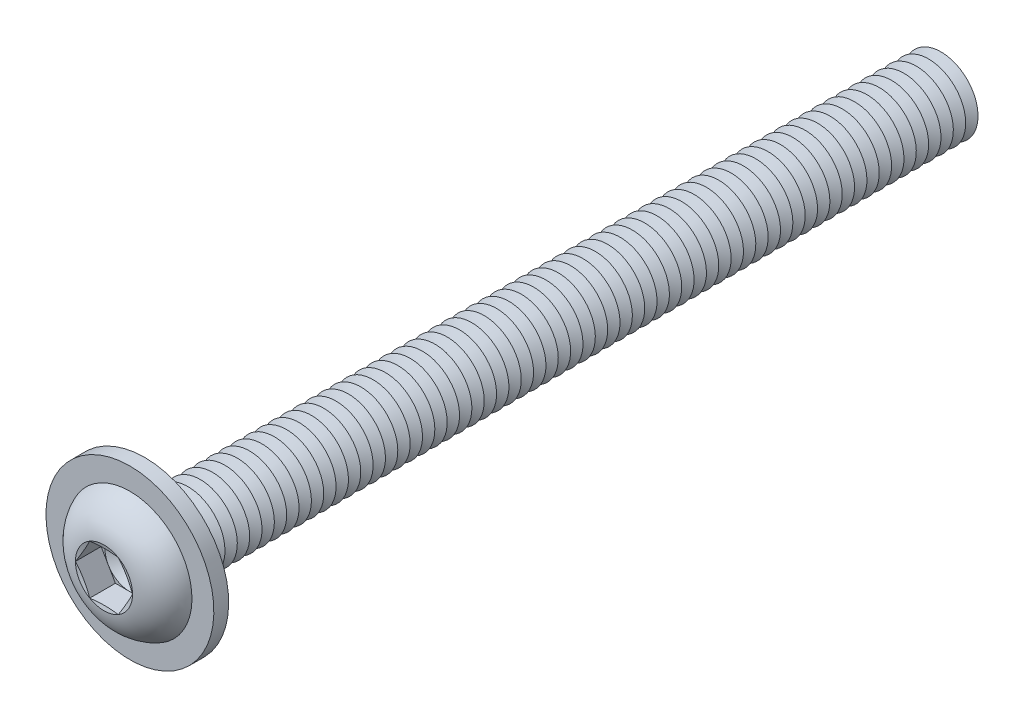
ISO-10303-21;
HEADER;
FILE_DESCRIPTION(('STEP AP214'),'2;1');
FILE_NAME('part.step','',(''),(''),'','','');
FILE_SCHEMA(('AUTOMOTIVE_DESIGN { 1 0 10303 214 1 1 1 1 }'));
ENDSEC;
DATA;
#1=APPLICATION_CONTEXT('core data for automotive mechanical design processes');
#2=APPLICATION_PROTOCOL_DEFINITION('international standard','automotive_design',2000,#1);
#3=PRODUCT_CONTEXT('',#1,'mechanical');
#4=PRODUCT('Part','Part','',(#3));
#5=PRODUCT_RELATED_PRODUCT_CATEGORY('part','',(#4));
#6=PRODUCT_DEFINITION_FORMATION('','',#4);
#7=PRODUCT_DEFINITION_CONTEXT('part definition',#1,'design');
#8=PRODUCT_DEFINITION('design','',#6,#7);
#9=PRODUCT_DEFINITION_SHAPE('','',#8);
#10=(LENGTH_UNIT() NAMED_UNIT(*) SI_UNIT(.MILLI.,.METRE.));
#11=(NAMED_UNIT(*) PLANE_ANGLE_UNIT() SI_UNIT($,.RADIAN.));
#12=(NAMED_UNIT(*) SI_UNIT($,.STERADIAN.) SOLID_ANGLE_UNIT());
#13=UNCERTAINTY_MEASURE_WITH_UNIT(LENGTH_MEASURE(1.E-05),#10,'distance_accuracy_value','');
#14=(GEOMETRIC_REPRESENTATION_CONTEXT(3) GLOBAL_UNCERTAINTY_ASSIGNED_CONTEXT((#13)) GLOBAL_UNIT_ASSIGNED_CONTEXT((#10,
#11,#12)) REPRESENTATION_CONTEXT('',''));
#15=CARTESIAN_POINT('',(0.,0.,0.));
#16=DIRECTION('',(0.,0.,1.));
#17=DIRECTION('',(1.,0.,0.));
#18=AXIS2_PLACEMENT_3D('',#15,#16,#17);
#19=CARTESIAN_POINT('',(0.,0.,-61.5));
#20=DIRECTION('',(0.,0.,1.));
#21=DIRECTION('',(0.,-1.,0.));
#22=AXIS2_PLACEMENT_3D('',#19,#20,#21);
#23=CONICAL_SURFACE('',#22,2.99999999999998,1.0471975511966);
#24=CARTESIAN_POINT('',(0.,0.,-62.));
#25=DIRECTION('',(0.,0.,1.));
#26=DIRECTION('',(0.,-1.,0.));
#27=AXIS2_PLACEMENT_3D('',#24,#25,#26);
#28=CIRCLE('',#27,2.13397459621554);
#29=CARTESIAN_POINT('',(0.,-2.13397459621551,-62.));
#30=VERTEX_POINT('',#29);
#31=EDGE_CURVE('E729',#30,#30,#28,.T.);
#32=ORIENTED_EDGE('',*,*,#31,.T.);
#33=EDGE_LOOP('',(#32));
#34=FACE_BOUND('',#33,.T.);
#35=CARTESIAN_POINT('',(0.,0.,-61.5));
#36=DIRECTION('',(0.,0.,1.));
#37=DIRECTION('',(0.,-1.,0.));
#38=AXIS2_PLACEMENT_3D('',#35,#36,#37);
#39=CIRCLE('',#38,2.99999999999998);
#40=CARTESIAN_POINT('',(0.,-2.99999999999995,-61.5));
#41=VERTEX_POINT('',#40);
#42=EDGE_CURVE('E725',#41,#41,#39,.T.);
#43=ORIENTED_EDGE('',*,*,#42,.F.);
#44=EDGE_LOOP('',(#43));
#45=FACE_BOUND('',#44,.T.);
#46=ADVANCED_FACE('F39',(#34,#45),#23,.T.);
#47=CARTESIAN_POINT('',(0.,0.,-62.));
#48=DIRECTION('',(0.,0.,-1.));
#49=DIRECTION('',(0.,1.,0.));
#50=AXIS2_PLACEMENT_3D('',#47,#48,#49);
#51=CONICAL_SURFACE('',#50,2.13397459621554,1.0471975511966);
#52=CARTESIAN_POINT('',(0.,0.,-62.5));
#53=DIRECTION('',(0.,0.,1.));
#54=DIRECTION('',(0.,-1.,0.));
#55=AXIS2_PLACEMENT_3D('',#52,#53,#54);
#56=CIRCLE('',#55,2.99999999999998);
#57=CARTESIAN_POINT('',(0.,-2.99999999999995,-62.5));
#58=VERTEX_POINT('',#57);
#59=EDGE_CURVE('E733',#58,#58,#56,.T.);
#60=ORIENTED_EDGE('',*,*,#59,.T.);
#61=EDGE_LOOP('',(#60));
#62=FACE_BOUND('',#61,.T.);
#63=ORIENTED_EDGE('',*,*,#31,.F.);
#64=EDGE_LOOP('',(#63));
#65=FACE_BOUND('',#64,.T.);
#66=ADVANCED_FACE('F850',(#62,#65),#51,.T.);
#67=CARTESIAN_POINT('',(0.,2.99999999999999,-65.));
#68=DIRECTION('',(0.,0.,-1.));
#69=DIRECTION('',(0.,1.,0.));
#70=AXIS2_PLACEMENT_3D('',#67,#68,#69);
#71=PLANE('',#70);
#72=CARTESIAN_POINT('',(0.,0.,-65.));
#73=DIRECTION('',(0.,0.,1.));
#74=DIRECTION('',(0.,-1.,0.));
#75=AXIS2_PLACEMENT_3D('',#72,#73,#74);
#76=CIRCLE('',#75,2.13397459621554);
#77=CARTESIAN_POINT('',(0.,-2.13397459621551,-65.));
#78=VERTEX_POINT('',#77);
#79=EDGE_CURVE('E753',#78,#78,#76,.T.);
#80=ORIENTED_EDGE('',*,*,#79,.F.);
#81=EDGE_LOOP('',(#80));
#82=FACE_BOUND('',#81,.T.);
#83=ADVANCED_FACE('F856',(#82),#71,.T.);
#84=CARTESIAN_POINT('',(0.,0.,-64.5));
#85=DIRECTION('',(0.,0.,1.));
#86=DIRECTION('',(0.,-1.,0.));
#87=AXIS2_PLACEMENT_3D('',#84,#85,#86);
#88=CONICAL_SURFACE('',#87,2.99999999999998,1.0471975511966);
#89=ORIENTED_EDGE('',*,*,#79,.T.);
#90=EDGE_LOOP('',(#89));
#91=FACE_BOUND('',#90,.T.);
#92=CARTESIAN_POINT('',(0.,0.,-64.5));
#93=DIRECTION('',(0.,0.,1.));
#94=DIRECTION('',(0.,-1.,0.));
#95=AXIS2_PLACEMENT_3D('',#92,#93,#94);
#96=CIRCLE('',#95,2.99999999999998);
#97=CARTESIAN_POINT('',(0.,-2.99999999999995,-64.5));
#98=VERTEX_POINT('',#97);
#99=EDGE_CURVE('E749',#98,#98,#96,.T.);
#100=ORIENTED_EDGE('',*,*,#99,.F.);
#101=EDGE_LOOP('',(#100));
#102=FACE_BOUND('',#101,.T.);
#103=ADVANCED_FACE('F875',(#91,#102),#88,.T.);
#104=CARTESIAN_POINT('',(0.,0.,-64.));
#105=DIRECTION('',(0.,0.,-1.));
#106=DIRECTION('',(0.,1.,0.));
#107=AXIS2_PLACEMENT_3D('',#104,#105,#106);
#108=CONICAL_SURFACE('',#107,2.13397459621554,1.0471975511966);
#109=ORIENTED_EDGE('',*,*,#99,.T.);
#110=EDGE_LOOP('',(#109));
#111=FACE_BOUND('',#110,.T.);
#112=CARTESIAN_POINT('',(0.,0.,-64.));
#113=DIRECTION('',(0.,0.,1.));
#114=DIRECTION('',(0.,-1.,0.));
#115=AXIS2_PLACEMENT_3D('',#112,#113,#114);
#116=CIRCLE('',#115,2.13397459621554);
#117=CARTESIAN_POINT('',(0.,-2.13397459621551,-64.));
#118=VERTEX_POINT('',#117);
#119=EDGE_CURVE('E745',#118,#118,#116,.T.);
#120=ORIENTED_EDGE('',*,*,#119,.F.);
#121=EDGE_LOOP('',(#120));
#122=FACE_BOUND('',#121,.T.);
#123=ADVANCED_FACE('F872',(#111,#122),#108,.T.);
#124=CARTESIAN_POINT('',(0.,0.,-63.5));
#125=DIRECTION('',(0.,0.,1.));
#126=DIRECTION('',(0.,-1.,0.));
#127=AXIS2_PLACEMENT_3D('',#124,#125,#126);
#128=CONICAL_SURFACE('',#127,2.99999999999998,1.0471975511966);
#129=ORIENTED_EDGE('',*,*,#119,.T.);
#130=EDGE_LOOP('',(#129));
#131=FACE_BOUND('',#130,.T.);
#132=CARTESIAN_POINT('',(0.,0.,-63.5));
#133=DIRECTION('',(0.,0.,1.));
#134=DIRECTION('',(0.,-1.,0.));
#135=AXIS2_PLACEMENT_3D('',#132,#133,#134);
#136=CIRCLE('',#135,2.99999999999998);
#137=CARTESIAN_POINT('',(0.,-2.99999999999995,-63.5));
#138=VERTEX_POINT('',#137);
#139=EDGE_CURVE('E741',#138,#138,#136,.T.);
#140=ORIENTED_EDGE('',*,*,#139,.F.);
#141=EDGE_LOOP('',(#140));
#142=FACE_BOUND('',#141,.T.);
#143=ADVANCED_FACE('F866',(#131,#142),#128,.T.);
#144=CARTESIAN_POINT('',(0.,0.,-63.));
#145=DIRECTION('',(0.,0.,-1.));
#146=DIRECTION('',(0.,1.,0.));
#147=AXIS2_PLACEMENT_3D('',#144,#145,#146);
#148=CONICAL_SURFACE('',#147,2.13397459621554,1.0471975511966);
#149=ORIENTED_EDGE('',*,*,#139,.T.);
#150=EDGE_LOOP('',(#149));
#151=FACE_BOUND('',#150,.T.);
#152=CARTESIAN_POINT('',(0.,0.,-63.));
#153=DIRECTION('',(0.,0.,1.));
#154=DIRECTION('',(0.,-1.,0.));
#155=AXIS2_PLACEMENT_3D('',#152,#153,#154);
#156=CIRCLE('',#155,2.13397459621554);
#157=CARTESIAN_POINT('',(0.,-2.13397459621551,-63.));
#158=VERTEX_POINT('',#157);
#159=EDGE_CURVE('E737',#158,#158,#156,.T.);
#160=ORIENTED_EDGE('',*,*,#159,.F.);
#161=EDGE_LOOP('',(#160));
#162=FACE_BOUND('',#161,.T.);
#163=ADVANCED_FACE('F862',(#151,#162),#148,.T.);
#164=CARTESIAN_POINT('',(0.,0.,-62.5));
#165=DIRECTION('',(0.,0.,1.));
#166=DIRECTION('',(0.,-1.,0.));
#167=AXIS2_PLACEMENT_3D('',#164,#165,#166);
#168=CONICAL_SURFACE('',#167,2.99999999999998,1.0471975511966);
#169=ORIENTED_EDGE('',*,*,#159,.T.);
#170=EDGE_LOOP('',(#169));
#171=FACE_BOUND('',#170,.T.);
#172=ORIENTED_EDGE('',*,*,#59,.F.);
#173=EDGE_LOOP('',(#172));
#174=FACE_BOUND('',#173,.T.);
#175=ADVANCED_FACE('F865',(#171,#174),#168,.T.);
#176=CARTESIAN_POINT('',(0.,0.,-60.5));
#177=DIRECTION('',(0.,0.,1.));
#178=DIRECTION('',(0.,-1.,0.));
#179=AXIS2_PLACEMENT_3D('',#176,#177,#178);
#180=CONICAL_SURFACE('',#179,2.99999999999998,1.0471975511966);
#181=CARTESIAN_POINT('',(0.,0.,-61.));
#182=DIRECTION('',(0.,0.,1.));
#183=DIRECTION('',(0.,-1.,0.));
#184=AXIS2_PLACEMENT_3D('',#181,#182,#183);
#185=CIRCLE('',#184,2.13397459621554);
#186=CARTESIAN_POINT('',(0.,-2.13397459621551,-61.));
#187=VERTEX_POINT('',#186);
#188=EDGE_CURVE('E721',#187,#187,#185,.T.);
#189=ORIENTED_EDGE('',*,*,#188,.T.);
#190=EDGE_LOOP('',(#189));
#191=FACE_BOUND('',#190,.T.);
#192=CARTESIAN_POINT('',(0.,0.,-60.5));
#193=DIRECTION('',(0.,0.,1.));
#194=DIRECTION('',(0.,-1.,0.));
#195=AXIS2_PLACEMENT_3D('',#192,#193,#194);
#196=CIRCLE('',#195,2.99999999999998);
#197=CARTESIAN_POINT('',(0.,-2.99999999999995,-60.5));
#198=VERTEX_POINT('',#197);
#199=EDGE_CURVE('E717',#198,#198,#196,.T.);
#200=ORIENTED_EDGE('',*,*,#199,.F.);
#201=EDGE_LOOP('',(#200));
#202=FACE_BOUND('',#201,.T.);
#203=ADVANCED_FACE('F870',(#191,#202),#180,.T.);
#204=CARTESIAN_POINT('',(0.,0.,-61.));
#205=DIRECTION('',(0.,0.,-1.));
#206=DIRECTION('',(0.,1.,0.));
#207=AXIS2_PLACEMENT_3D('',#204,#205,#206);
#208=CONICAL_SURFACE('',#207,2.13397459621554,1.0471975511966);
#209=ORIENTED_EDGE('',*,*,#42,.T.);
#210=EDGE_LOOP('',(#209));
#211=FACE_BOUND('',#210,.T.);
#212=ORIENTED_EDGE('',*,*,#188,.F.);
#213=EDGE_LOOP('',(#212));
#214=FACE_BOUND('',#213,.T.);
#215=ADVANCED_FACE('F921',(#211,#214),#208,.T.);
#216=CARTESIAN_POINT('',(0.,0.,-59.5));
#217=DIRECTION('',(0.,0.,1.));
#218=DIRECTION('',(0.,-1.,0.));
#219=AXIS2_PLACEMENT_3D('',#216,#217,#218);
#220=CONICAL_SURFACE('',#219,2.99999999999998,1.0471975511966);
#221=CARTESIAN_POINT('',(0.,0.,-60.));
#222=DIRECTION('',(0.,0.,1.));
#223=DIRECTION('',(0.,-1.,0.));
#224=AXIS2_PLACEMENT_3D('',#221,#222,#223);
#225=CIRCLE('',#224,2.13397459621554);
#226=CARTESIAN_POINT('',(0.,-2.13397459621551,-60.));
#227=VERTEX_POINT('',#226);
#228=EDGE_CURVE('E713',#227,#227,#225,.T.);
#229=ORIENTED_EDGE('',*,*,#228,.T.);
#230=EDGE_LOOP('',(#229));
#231=FACE_BOUND('',#230,.T.);
#232=CARTESIAN_POINT('',(0.,0.,-59.5));
#233=DIRECTION('',(0.,0.,1.));
#234=DIRECTION('',(0.,-1.,0.));
#235=AXIS2_PLACEMENT_3D('',#232,#233,#234);
#236=CIRCLE('',#235,2.99999999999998);
#237=CARTESIAN_POINT('',(0.,-2.99999999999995,-59.5));
#238=VERTEX_POINT('',#237);
#239=EDGE_CURVE('E709',#238,#238,#236,.T.);
#240=ORIENTED_EDGE('',*,*,#239,.F.);
#241=EDGE_LOOP('',(#240));
#242=FACE_BOUND('',#241,.T.);
#243=ADVANCED_FACE('F927',(#231,#242),#220,.T.);
#244=CARTESIAN_POINT('',(0.,0.,-60.));
#245=DIRECTION('',(0.,0.,-1.));
#246=DIRECTION('',(0.,1.,0.));
#247=AXIS2_PLACEMENT_3D('',#244,#245,#246);
#248=CONICAL_SURFACE('',#247,2.13397459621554,1.0471975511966);
#249=ORIENTED_EDGE('',*,*,#199,.T.);
#250=EDGE_LOOP('',(#249));
#251=FACE_BOUND('',#250,.T.);
#252=ORIENTED_EDGE('',*,*,#228,.F.);
#253=EDGE_LOOP('',(#252));
#254=FACE_BOUND('',#253,.T.);
#255=ADVANCED_FACE('F934',(#251,#254),#248,.T.);
#256=CARTESIAN_POINT('',(0.,0.,-58.5));
#257=DIRECTION('',(0.,0.,1.));
#258=DIRECTION('',(0.,-1.,0.));
#259=AXIS2_PLACEMENT_3D('',#256,#257,#258);
#260=CONICAL_SURFACE('',#259,2.99999999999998,1.0471975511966);
#261=CARTESIAN_POINT('',(0.,0.,-59.));
#262=DIRECTION('',(0.,0.,1.));
#263=DIRECTION('',(0.,-1.,0.));
#264=AXIS2_PLACEMENT_3D('',#261,#262,#263);
#265=CIRCLE('',#264,2.13397459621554);
#266=CARTESIAN_POINT('',(0.,-2.13397459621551,-59.));
#267=VERTEX_POINT('',#266);
#268=EDGE_CURVE('E705',#267,#267,#265,.T.);
#269=ORIENTED_EDGE('',*,*,#268,.T.);
#270=EDGE_LOOP('',(#269));
#271=FACE_BOUND('',#270,.T.);
#272=CARTESIAN_POINT('',(0.,0.,-58.5));
#273=DIRECTION('',(0.,0.,1.));
#274=DIRECTION('',(0.,-1.,0.));
#275=AXIS2_PLACEMENT_3D('',#272,#273,#274);
#276=CIRCLE('',#275,2.99999999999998);
#277=CARTESIAN_POINT('',(0.,-2.99999999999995,-58.5));
#278=VERTEX_POINT('',#277);
#279=EDGE_CURVE('E701',#278,#278,#276,.T.);
#280=ORIENTED_EDGE('',*,*,#279,.F.);
#281=EDGE_LOOP('',(#280));
#282=FACE_BOUND('',#281,.T.);
#283=ADVANCED_FACE('F941',(#271,#282),#260,.T.);
#284=CARTESIAN_POINT('',(0.,0.,-59.));
#285=DIRECTION('',(0.,0.,-1.));
#286=DIRECTION('',(0.,1.,0.));
#287=AXIS2_PLACEMENT_3D('',#284,#285,#286);
#288=CONICAL_SURFACE('',#287,2.13397459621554,1.0471975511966);
#289=ORIENTED_EDGE('',*,*,#239,.T.);
#290=EDGE_LOOP('',(#289));
#291=FACE_BOUND('',#290,.T.);
#292=ORIENTED_EDGE('',*,*,#268,.F.);
#293=EDGE_LOOP('',(#292));
#294=FACE_BOUND('',#293,.T.);
#295=ADVANCED_FACE('F948',(#291,#294),#288,.T.);
#296=CARTESIAN_POINT('',(0.,0.,-57.5));
#297=DIRECTION('',(0.,0.,1.));
#298=DIRECTION('',(0.,-1.,0.));
#299=AXIS2_PLACEMENT_3D('',#296,#297,#298);
#300=CONICAL_SURFACE('',#299,2.99999999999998,1.0471975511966);
#301=CARTESIAN_POINT('',(0.,0.,-58.));
#302=DIRECTION('',(0.,0.,1.));
#303=DIRECTION('',(0.,-1.,0.));
#304=AXIS2_PLACEMENT_3D('',#301,#302,#303);
#305=CIRCLE('',#304,2.13397459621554);
#306=CARTESIAN_POINT('',(0.,-2.13397459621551,-58.));
#307=VERTEX_POINT('',#306);
#308=EDGE_CURVE('E697',#307,#307,#305,.T.);
#309=ORIENTED_EDGE('',*,*,#308,.T.);
#310=EDGE_LOOP('',(#309));
#311=FACE_BOUND('',#310,.T.);
#312=CARTESIAN_POINT('',(0.,0.,-57.5));
#313=DIRECTION('',(0.,0.,1.));
#314=DIRECTION('',(0.,-1.,0.));
#315=AXIS2_PLACEMENT_3D('',#312,#313,#314);
#316=CIRCLE('',#315,2.99999999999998);
#317=CARTESIAN_POINT('',(0.,-2.99999999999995,-57.5));
#318=VERTEX_POINT('',#317);
#319=EDGE_CURVE('E693',#318,#318,#316,.T.);
#320=ORIENTED_EDGE('',*,*,#319,.F.);
#321=EDGE_LOOP('',(#320));
#322=FACE_BOUND('',#321,.T.);
#323=ADVANCED_FACE('F955',(#311,#322),#300,.T.);
#324=CARTESIAN_POINT('',(0.,0.,-58.));
#325=DIRECTION('',(0.,0.,-1.));
#326=DIRECTION('',(0.,1.,0.));
#327=AXIS2_PLACEMENT_3D('',#324,#325,#326);
#328=CONICAL_SURFACE('',#327,2.13397459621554,1.0471975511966);
#329=ORIENTED_EDGE('',*,*,#279,.T.);
#330=EDGE_LOOP('',(#329));
#331=FACE_BOUND('',#330,.T.);
#332=ORIENTED_EDGE('',*,*,#308,.F.);
#333=EDGE_LOOP('',(#332));
#334=FACE_BOUND('',#333,.T.);
#335=ADVANCED_FACE('F962',(#331,#334),#328,.T.);
#336=CARTESIAN_POINT('',(0.,0.,-56.5));
#337=DIRECTION('',(0.,0.,1.));
#338=DIRECTION('',(0.,-1.,0.));
#339=AXIS2_PLACEMENT_3D('',#336,#337,#338);
#340=CONICAL_SURFACE('',#339,2.99999999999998,1.0471975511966);
#341=CARTESIAN_POINT('',(0.,0.,-57.));
#342=DIRECTION('',(0.,0.,1.));
#343=DIRECTION('',(0.,-1.,0.));
#344=AXIS2_PLACEMENT_3D('',#341,#342,#343);
#345=CIRCLE('',#344,2.13397459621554);
#346=CARTESIAN_POINT('',(0.,-2.13397459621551,-57.));
#347=VERTEX_POINT('',#346);
#348=EDGE_CURVE('E689',#347,#347,#345,.T.);
#349=ORIENTED_EDGE('',*,*,#348,.T.);
#350=EDGE_LOOP('',(#349));
#351=FACE_BOUND('',#350,.T.);
#352=CARTESIAN_POINT('',(0.,0.,-56.5));
#353=DIRECTION('',(0.,0.,1.));
#354=DIRECTION('',(0.,-1.,0.));
#355=AXIS2_PLACEMENT_3D('',#352,#353,#354);
#356=CIRCLE('',#355,2.99999999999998);
#357=CARTESIAN_POINT('',(0.,-2.99999999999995,-56.5));
#358=VERTEX_POINT('',#357);
#359=EDGE_CURVE('E685',#358,#358,#356,.T.);
#360=ORIENTED_EDGE('',*,*,#359,.F.);
#361=EDGE_LOOP('',(#360));
#362=FACE_BOUND('',#361,.T.);
#363=ADVANCED_FACE('F969',(#351,#362),#340,.T.);
#364=CARTESIAN_POINT('',(0.,0.,-57.));
#365=DIRECTION('',(0.,0.,-1.));
#366=DIRECTION('',(0.,1.,0.));
#367=AXIS2_PLACEMENT_3D('',#364,#365,#366);
#368=CONICAL_SURFACE('',#367,2.13397459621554,1.0471975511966);
#369=ORIENTED_EDGE('',*,*,#319,.T.);
#370=EDGE_LOOP('',(#369));
#371=FACE_BOUND('',#370,.T.);
#372=ORIENTED_EDGE('',*,*,#348,.F.);
#373=EDGE_LOOP('',(#372));
#374=FACE_BOUND('',#373,.T.);
#375=ADVANCED_FACE('F976',(#371,#374),#368,.T.);
#376=CARTESIAN_POINT('',(0.,0.,-55.5));
#377=DIRECTION('',(0.,0.,1.));
#378=DIRECTION('',(0.,-1.,0.));
#379=AXIS2_PLACEMENT_3D('',#376,#377,#378);
#380=CONICAL_SURFACE('',#379,2.99999999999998,1.0471975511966);
#381=CARTESIAN_POINT('',(0.,0.,-56.));
#382=DIRECTION('',(0.,0.,1.));
#383=DIRECTION('',(0.,-1.,0.));
#384=AXIS2_PLACEMENT_3D('',#381,#382,#383);
#385=CIRCLE('',#384,2.13397459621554);
#386=CARTESIAN_POINT('',(0.,-2.13397459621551,-56.));
#387=VERTEX_POINT('',#386);
#388=EDGE_CURVE('E681',#387,#387,#385,.T.);
#389=ORIENTED_EDGE('',*,*,#388,.T.);
#390=EDGE_LOOP('',(#389));
#391=FACE_BOUND('',#390,.T.);
#392=CARTESIAN_POINT('',(0.,0.,-55.5));
#393=DIRECTION('',(0.,0.,1.));
#394=DIRECTION('',(0.,-1.,0.));
#395=AXIS2_PLACEMENT_3D('',#392,#393,#394);
#396=CIRCLE('',#395,2.99999999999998);
#397=CARTESIAN_POINT('',(0.,-2.99999999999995,-55.5));
#398=VERTEX_POINT('',#397);
#399=EDGE_CURVE('E677',#398,#398,#396,.T.);
#400=ORIENTED_EDGE('',*,*,#399,.F.);
#401=EDGE_LOOP('',(#400));
#402=FACE_BOUND('',#401,.T.);
#403=ADVANCED_FACE('F983',(#391,#402),#380,.T.);
#404=CARTESIAN_POINT('',(0.,0.,-56.));
#405=DIRECTION('',(0.,0.,-1.));
#406=DIRECTION('',(0.,1.,0.));
#407=AXIS2_PLACEMENT_3D('',#404,#405,#406);
#408=CONICAL_SURFACE('',#407,2.13397459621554,1.0471975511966);
#409=ORIENTED_EDGE('',*,*,#359,.T.);
#410=EDGE_LOOP('',(#409));
#411=FACE_BOUND('',#410,.T.);
#412=ORIENTED_EDGE('',*,*,#388,.F.);
#413=EDGE_LOOP('',(#412));
#414=FACE_BOUND('',#413,.T.);
#415=ADVANCED_FACE('F990',(#411,#414),#408,.T.);
#416=CARTESIAN_POINT('',(0.,0.,-54.5));
#417=DIRECTION('',(0.,0.,1.));
#418=DIRECTION('',(0.,-1.,0.));
#419=AXIS2_PLACEMENT_3D('',#416,#417,#418);
#420=CONICAL_SURFACE('',#419,2.99999999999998,1.0471975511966);
#421=CARTESIAN_POINT('',(0.,0.,-55.));
#422=DIRECTION('',(0.,0.,1.));
#423=DIRECTION('',(0.,-1.,0.));
#424=AXIS2_PLACEMENT_3D('',#421,#422,#423);
#425=CIRCLE('',#424,2.13397459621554);
#426=CARTESIAN_POINT('',(0.,-2.13397459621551,-55.));
#427=VERTEX_POINT('',#426);
#428=EDGE_CURVE('E673',#427,#427,#425,.T.);
#429=ORIENTED_EDGE('',*,*,#428,.T.);
#430=EDGE_LOOP('',(#429));
#431=FACE_BOUND('',#430,.T.);
#432=CARTESIAN_POINT('',(0.,0.,-54.5));
#433=DIRECTION('',(0.,0.,1.));
#434=DIRECTION('',(0.,-1.,0.));
#435=AXIS2_PLACEMENT_3D('',#432,#433,#434);
#436=CIRCLE('',#435,2.99999999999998);
#437=CARTESIAN_POINT('',(0.,-2.99999999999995,-54.5));
#438=VERTEX_POINT('',#437);
#439=EDGE_CURVE('E669',#438,#438,#436,.T.);
#440=ORIENTED_EDGE('',*,*,#439,.F.);
#441=EDGE_LOOP('',(#440));
#442=FACE_BOUND('',#441,.T.);
#443=ADVANCED_FACE('F997',(#431,#442),#420,.T.);
#444=CARTESIAN_POINT('',(0.,0.,-55.));
#445=DIRECTION('',(0.,0.,-1.));
#446=DIRECTION('',(0.,1.,0.));
#447=AXIS2_PLACEMENT_3D('',#444,#445,#446);
#448=CONICAL_SURFACE('',#447,2.13397459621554,1.0471975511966);
#449=ORIENTED_EDGE('',*,*,#399,.T.);
#450=EDGE_LOOP('',(#449));
#451=FACE_BOUND('',#450,.T.);
#452=ORIENTED_EDGE('',*,*,#428,.F.);
#453=EDGE_LOOP('',(#452));
#454=FACE_BOUND('',#453,.T.);
#455=ADVANCED_FACE('F1004',(#451,#454),#448,.T.);
#456=CARTESIAN_POINT('',(0.,0.,-53.5));
#457=DIRECTION('',(0.,0.,1.));
#458=DIRECTION('',(0.,-1.,0.));
#459=AXIS2_PLACEMENT_3D('',#456,#457,#458);
#460=CONICAL_SURFACE('',#459,2.99999999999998,1.0471975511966);
#461=CARTESIAN_POINT('',(0.,0.,-54.));
#462=DIRECTION('',(0.,0.,1.));
#463=DIRECTION('',(0.,-1.,0.));
#464=AXIS2_PLACEMENT_3D('',#461,#462,#463);
#465=CIRCLE('',#464,2.13397459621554);
#466=CARTESIAN_POINT('',(0.,-2.13397459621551,-54.));
#467=VERTEX_POINT('',#466);
#468=EDGE_CURVE('E665',#467,#467,#465,.T.);
#469=ORIENTED_EDGE('',*,*,#468,.T.);
#470=EDGE_LOOP('',(#469));
#471=FACE_BOUND('',#470,.T.);
#472=CARTESIAN_POINT('',(0.,0.,-53.5));
#473=DIRECTION('',(0.,0.,1.));
#474=DIRECTION('',(0.,-1.,0.));
#475=AXIS2_PLACEMENT_3D('',#472,#473,#474);
#476=CIRCLE('',#475,2.99999999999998);
#477=CARTESIAN_POINT('',(0.,-2.99999999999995,-53.5));
#478=VERTEX_POINT('',#477);
#479=EDGE_CURVE('E661',#478,#478,#476,.T.);
#480=ORIENTED_EDGE('',*,*,#479,.F.);
#481=EDGE_LOOP('',(#480));
#482=FACE_BOUND('',#481,.T.);
#483=ADVANCED_FACE('F1011',(#471,#482),#460,.T.);
#484=CARTESIAN_POINT('',(0.,0.,-54.));
#485=DIRECTION('',(0.,0.,-1.));
#486=DIRECTION('',(0.,1.,0.));
#487=AXIS2_PLACEMENT_3D('',#484,#485,#486);
#488=CONICAL_SURFACE('',#487,2.13397459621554,1.0471975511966);
#489=ORIENTED_EDGE('',*,*,#439,.T.);
#490=EDGE_LOOP('',(#489));
#491=FACE_BOUND('',#490,.T.);
#492=ORIENTED_EDGE('',*,*,#468,.F.);
#493=EDGE_LOOP('',(#492));
#494=FACE_BOUND('',#493,.T.);
#495=ADVANCED_FACE('F1018',(#491,#494),#488,.T.);
#496=CARTESIAN_POINT('',(0.,0.,-52.5));
#497=DIRECTION('',(0.,0.,1.));
#498=DIRECTION('',(0.,-1.,0.));
#499=AXIS2_PLACEMENT_3D('',#496,#497,#498);
#500=CONICAL_SURFACE('',#499,2.99999999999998,1.0471975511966);
#501=CARTESIAN_POINT('',(0.,0.,-53.));
#502=DIRECTION('',(0.,0.,1.));
#503=DIRECTION('',(0.,-1.,0.));
#504=AXIS2_PLACEMENT_3D('',#501,#502,#503);
#505=CIRCLE('',#504,2.13397459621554);
#506=CARTESIAN_POINT('',(0.,-2.13397459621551,-53.));
#507=VERTEX_POINT('',#506);
#508=EDGE_CURVE('E657',#507,#507,#505,.T.);
#509=ORIENTED_EDGE('',*,*,#508,.T.);
#510=EDGE_LOOP('',(#509));
#511=FACE_BOUND('',#510,.T.);
#512=CARTESIAN_POINT('',(0.,0.,-52.5));
#513=DIRECTION('',(0.,0.,1.));
#514=DIRECTION('',(0.,-1.,0.));
#515=AXIS2_PLACEMENT_3D('',#512,#513,#514);
#516=CIRCLE('',#515,2.99999999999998);
#517=CARTESIAN_POINT('',(0.,-2.99999999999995,-52.5));
#518=VERTEX_POINT('',#517);
#519=EDGE_CURVE('E653',#518,#518,#516,.T.);
#520=ORIENTED_EDGE('',*,*,#519,.F.);
#521=EDGE_LOOP('',(#520));
#522=FACE_BOUND('',#521,.T.);
#523=ADVANCED_FACE('F1025',(#511,#522),#500,.T.);
#524=CARTESIAN_POINT('',(0.,0.,-53.));
#525=DIRECTION('',(0.,0.,-1.));
#526=DIRECTION('',(0.,1.,0.));
#527=AXIS2_PLACEMENT_3D('',#524,#525,#526);
#528=CONICAL_SURFACE('',#527,2.13397459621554,1.0471975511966);
#529=ORIENTED_EDGE('',*,*,#479,.T.);
#530=EDGE_LOOP('',(#529));
#531=FACE_BOUND('',#530,.T.);
#532=ORIENTED_EDGE('',*,*,#508,.F.);
#533=EDGE_LOOP('',(#532));
#534=FACE_BOUND('',#533,.T.);
#535=ADVANCED_FACE('F1032',(#531,#534),#528,.T.);
#536=CARTESIAN_POINT('',(0.,0.,-51.5));
#537=DIRECTION('',(0.,0.,1.));
#538=DIRECTION('',(0.,-1.,0.));
#539=AXIS2_PLACEMENT_3D('',#536,#537,#538);
#540=CONICAL_SURFACE('',#539,2.99999999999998,1.0471975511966);
#541=CARTESIAN_POINT('',(0.,0.,-52.));
#542=DIRECTION('',(0.,0.,1.));
#543=DIRECTION('',(0.,-1.,0.));
#544=AXIS2_PLACEMENT_3D('',#541,#542,#543);
#545=CIRCLE('',#544,2.13397459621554);
#546=CARTESIAN_POINT('',(0.,-2.13397459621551,-52.));
#547=VERTEX_POINT('',#546);
#548=EDGE_CURVE('E649',#547,#547,#545,.T.);
#549=ORIENTED_EDGE('',*,*,#548,.T.);
#550=EDGE_LOOP('',(#549));
#551=FACE_BOUND('',#550,.T.);
#552=CARTESIAN_POINT('',(0.,0.,-51.5));
#553=DIRECTION('',(0.,0.,1.));
#554=DIRECTION('',(0.,-1.,0.));
#555=AXIS2_PLACEMENT_3D('',#552,#553,#554);
#556=CIRCLE('',#555,2.99999999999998);
#557=CARTESIAN_POINT('',(0.,-2.99999999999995,-51.5));
#558=VERTEX_POINT('',#557);
#559=EDGE_CURVE('E645',#558,#558,#556,.T.);
#560=ORIENTED_EDGE('',*,*,#559,.F.);
#561=EDGE_LOOP('',(#560));
#562=FACE_BOUND('',#561,.T.);
#563=ADVANCED_FACE('F1039',(#551,#562),#540,.T.);
#564=CARTESIAN_POINT('',(0.,0.,-52.));
#565=DIRECTION('',(0.,0.,-1.));
#566=DIRECTION('',(0.,1.,0.));
#567=AXIS2_PLACEMENT_3D('',#564,#565,#566);
#568=CONICAL_SURFACE('',#567,2.13397459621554,1.0471975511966);
#569=ORIENTED_EDGE('',*,*,#519,.T.);
#570=EDGE_LOOP('',(#569));
#571=FACE_BOUND('',#570,.T.);
#572=ORIENTED_EDGE('',*,*,#548,.F.);
#573=EDGE_LOOP('',(#572));
#574=FACE_BOUND('',#573,.T.);
#575=ADVANCED_FACE('F1046',(#571,#574),#568,.T.);
#576=CARTESIAN_POINT('',(0.,0.,-50.5));
#577=DIRECTION('',(0.,0.,1.));
#578=DIRECTION('',(0.,-1.,0.));
#579=AXIS2_PLACEMENT_3D('',#576,#577,#578);
#580=CONICAL_SURFACE('',#579,2.99999999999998,1.0471975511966);
#581=CARTESIAN_POINT('',(0.,0.,-51.));
#582=DIRECTION('',(0.,0.,1.));
#583=DIRECTION('',(0.,-1.,0.));
#584=AXIS2_PLACEMENT_3D('',#581,#582,#583);
#585=CIRCLE('',#584,2.13397459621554);
#586=CARTESIAN_POINT('',(0.,-2.13397459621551,-51.));
#587=VERTEX_POINT('',#586);
#588=EDGE_CURVE('E641',#587,#587,#585,.T.);
#589=ORIENTED_EDGE('',*,*,#588,.T.);
#590=EDGE_LOOP('',(#589));
#591=FACE_BOUND('',#590,.T.);
#592=CARTESIAN_POINT('',(0.,0.,-50.5));
#593=DIRECTION('',(0.,0.,1.));
#594=DIRECTION('',(0.,-1.,0.));
#595=AXIS2_PLACEMENT_3D('',#592,#593,#594);
#596=CIRCLE('',#595,2.99999999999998);
#597=CARTESIAN_POINT('',(0.,-2.99999999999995,-50.5));
#598=VERTEX_POINT('',#597);
#599=EDGE_CURVE('E637',#598,#598,#596,.T.);
#600=ORIENTED_EDGE('',*,*,#599,.F.);
#601=EDGE_LOOP('',(#600));
#602=FACE_BOUND('',#601,.T.);
#603=ADVANCED_FACE('F1053',(#591,#602),#580,.T.);
#604=CARTESIAN_POINT('',(0.,0.,-51.));
#605=DIRECTION('',(0.,0.,-1.));
#606=DIRECTION('',(0.,1.,0.));
#607=AXIS2_PLACEMENT_3D('',#604,#605,#606);
#608=CONICAL_SURFACE('',#607,2.13397459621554,1.0471975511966);
#609=ORIENTED_EDGE('',*,*,#559,.T.);
#610=EDGE_LOOP('',(#609));
#611=FACE_BOUND('',#610,.T.);
#612=ORIENTED_EDGE('',*,*,#588,.F.);
#613=EDGE_LOOP('',(#612));
#614=FACE_BOUND('',#613,.T.);
#615=ADVANCED_FACE('F1060',(#611,#614),#608,.T.);
#616=CARTESIAN_POINT('',(0.,0.,-49.5));
#617=DIRECTION('',(0.,0.,1.));
#618=DIRECTION('',(0.,-1.,0.));
#619=AXIS2_PLACEMENT_3D('',#616,#617,#618);
#620=CONICAL_SURFACE('',#619,2.99999999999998,1.0471975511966);
#621=CARTESIAN_POINT('',(0.,0.,-50.));
#622=DIRECTION('',(0.,0.,1.));
#623=DIRECTION('',(0.,-1.,0.));
#624=AXIS2_PLACEMENT_3D('',#621,#622,#623);
#625=CIRCLE('',#624,2.13397459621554);
#626=CARTESIAN_POINT('',(0.,-2.13397459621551,-50.));
#627=VERTEX_POINT('',#626);
#628=EDGE_CURVE('E633',#627,#627,#625,.T.);
#629=ORIENTED_EDGE('',*,*,#628,.T.);
#630=EDGE_LOOP('',(#629));
#631=FACE_BOUND('',#630,.T.);
#632=CARTESIAN_POINT('',(0.,0.,-49.5));
#633=DIRECTION('',(0.,0.,1.));
#634=DIRECTION('',(0.,-1.,0.));
#635=AXIS2_PLACEMENT_3D('',#632,#633,#634);
#636=CIRCLE('',#635,2.99999999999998);
#637=CARTESIAN_POINT('',(0.,-2.99999999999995,-49.5));
#638=VERTEX_POINT('',#637);
#639=EDGE_CURVE('E629',#638,#638,#636,.T.);
#640=ORIENTED_EDGE('',*,*,#639,.F.);
#641=EDGE_LOOP('',(#640));
#642=FACE_BOUND('',#641,.T.);
#643=ADVANCED_FACE('F1067',(#631,#642),#620,.T.);
#644=CARTESIAN_POINT('',(0.,0.,-50.));
#645=DIRECTION('',(0.,0.,-1.));
#646=DIRECTION('',(0.,1.,0.));
#647=AXIS2_PLACEMENT_3D('',#644,#645,#646);
#648=CONICAL_SURFACE('',#647,2.13397459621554,1.0471975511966);
#649=ORIENTED_EDGE('',*,*,#599,.T.);
#650=EDGE_LOOP('',(#649));
#651=FACE_BOUND('',#650,.T.);
#652=ORIENTED_EDGE('',*,*,#628,.F.);
#653=EDGE_LOOP('',(#652));
#654=FACE_BOUND('',#653,.T.);
#655=ADVANCED_FACE('F1074',(#651,#654),#648,.T.);
#656=CARTESIAN_POINT('',(0.,0.,-48.5));
#657=DIRECTION('',(0.,0.,1.));
#658=DIRECTION('',(0.,-1.,0.));
#659=AXIS2_PLACEMENT_3D('',#656,#657,#658);
#660=CONICAL_SURFACE('',#659,2.99999999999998,1.0471975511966);
#661=CARTESIAN_POINT('',(0.,0.,-49.));
#662=DIRECTION('',(0.,0.,1.));
#663=DIRECTION('',(0.,-1.,0.));
#664=AXIS2_PLACEMENT_3D('',#661,#662,#663);
#665=CIRCLE('',#664,2.13397459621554);
#666=CARTESIAN_POINT('',(0.,-2.13397459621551,-49.));
#667=VERTEX_POINT('',#666);
#668=EDGE_CURVE('E625',#667,#667,#665,.T.);
#669=ORIENTED_EDGE('',*,*,#668,.T.);
#670=EDGE_LOOP('',(#669));
#671=FACE_BOUND('',#670,.T.);
#672=CARTESIAN_POINT('',(0.,0.,-48.5));
#673=DIRECTION('',(0.,0.,1.));
#674=DIRECTION('',(0.,-1.,0.));
#675=AXIS2_PLACEMENT_3D('',#672,#673,#674);
#676=CIRCLE('',#675,2.99999999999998);
#677=CARTESIAN_POINT('',(0.,-2.99999999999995,-48.5));
#678=VERTEX_POINT('',#677);
#679=EDGE_CURVE('E621',#678,#678,#676,.T.);
#680=ORIENTED_EDGE('',*,*,#679,.F.);
#681=EDGE_LOOP('',(#680));
#682=FACE_BOUND('',#681,.T.);
#683=ADVANCED_FACE('F1081',(#671,#682),#660,.T.);
#684=CARTESIAN_POINT('',(0.,0.,-49.));
#685=DIRECTION('',(0.,0.,-1.));
#686=DIRECTION('',(0.,1.,0.));
#687=AXIS2_PLACEMENT_3D('',#684,#685,#686);
#688=CONICAL_SURFACE('',#687,2.13397459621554,1.0471975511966);
#689=ORIENTED_EDGE('',*,*,#639,.T.);
#690=EDGE_LOOP('',(#689));
#691=FACE_BOUND('',#690,.T.);
#692=ORIENTED_EDGE('',*,*,#668,.F.);
#693=EDGE_LOOP('',(#692));
#694=FACE_BOUND('',#693,.T.);
#695=ADVANCED_FACE('F1088',(#691,#694),#688,.T.);
#696=CARTESIAN_POINT('',(0.,0.,-47.5));
#697=DIRECTION('',(0.,0.,1.));
#698=DIRECTION('',(0.,-1.,0.));
#699=AXIS2_PLACEMENT_3D('',#696,#697,#698);
#700=CONICAL_SURFACE('',#699,2.99999999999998,1.0471975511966);
#701=CARTESIAN_POINT('',(0.,0.,-48.));
#702=DIRECTION('',(0.,0.,1.));
#703=DIRECTION('',(0.,-1.,0.));
#704=AXIS2_PLACEMENT_3D('',#701,#702,#703);
#705=CIRCLE('',#704,2.13397459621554);
#706=CARTESIAN_POINT('',(0.,-2.13397459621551,-48.));
#707=VERTEX_POINT('',#706);
#708=EDGE_CURVE('E617',#707,#707,#705,.T.);
#709=ORIENTED_EDGE('',*,*,#708,.T.);
#710=EDGE_LOOP('',(#709));
#711=FACE_BOUND('',#710,.T.);
#712=CARTESIAN_POINT('',(0.,0.,-47.5));
#713=DIRECTION('',(0.,0.,1.));
#714=DIRECTION('',(0.,-1.,0.));
#715=AXIS2_PLACEMENT_3D('',#712,#713,#714);
#716=CIRCLE('',#715,2.99999999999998);
#717=CARTESIAN_POINT('',(0.,-2.99999999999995,-47.5));
#718=VERTEX_POINT('',#717);
#719=EDGE_CURVE('E613',#718,#718,#716,.T.);
#720=ORIENTED_EDGE('',*,*,#719,.F.);
#721=EDGE_LOOP('',(#720));
#722=FACE_BOUND('',#721,.T.);
#723=ADVANCED_FACE('F1095',(#711,#722),#700,.T.);
#724=CARTESIAN_POINT('',(0.,0.,-48.));
#725=DIRECTION('',(0.,0.,-1.));
#726=DIRECTION('',(0.,1.,0.));
#727=AXIS2_PLACEMENT_3D('',#724,#725,#726);
#728=CONICAL_SURFACE('',#727,2.13397459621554,1.0471975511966);
#729=ORIENTED_EDGE('',*,*,#679,.T.);
#730=EDGE_LOOP('',(#729));
#731=FACE_BOUND('',#730,.T.);
#732=ORIENTED_EDGE('',*,*,#708,.F.);
#733=EDGE_LOOP('',(#732));
#734=FACE_BOUND('',#733,.T.);
#735=ADVANCED_FACE('F1102',(#731,#734),#728,.T.);
#736=CARTESIAN_POINT('',(0.,0.,-46.5));
#737=DIRECTION('',(0.,0.,1.));
#738=DIRECTION('',(0.,-1.,0.));
#739=AXIS2_PLACEMENT_3D('',#736,#737,#738);
#740=CONICAL_SURFACE('',#739,2.99999999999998,1.0471975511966);
#741=CARTESIAN_POINT('',(0.,0.,-47.));
#742=DIRECTION('',(0.,0.,1.));
#743=DIRECTION('',(0.,-1.,0.));
#744=AXIS2_PLACEMENT_3D('',#741,#742,#743);
#745=CIRCLE('',#744,2.13397459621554);
#746=CARTESIAN_POINT('',(0.,-2.13397459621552,-47.));
#747=VERTEX_POINT('',#746);
#748=EDGE_CURVE('E609',#747,#747,#745,.T.);
#749=ORIENTED_EDGE('',*,*,#748,.T.);
#750=EDGE_LOOP('',(#749));
#751=FACE_BOUND('',#750,.T.);
#752=CARTESIAN_POINT('',(0.,0.,-46.5));
#753=DIRECTION('',(0.,0.,1.));
#754=DIRECTION('',(0.,-1.,0.));
#755=AXIS2_PLACEMENT_3D('',#752,#753,#754);
#756=CIRCLE('',#755,2.99999999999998);
#757=CARTESIAN_POINT('',(0.,-2.99999999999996,-46.5));
#758=VERTEX_POINT('',#757);
#759=EDGE_CURVE('E605',#758,#758,#756,.T.);
#760=ORIENTED_EDGE('',*,*,#759,.F.);
#761=EDGE_LOOP('',(#760));
#762=FACE_BOUND('',#761,.T.);
#763=ADVANCED_FACE('F1109',(#751,#762),#740,.T.);
#764=CARTESIAN_POINT('',(0.,0.,-47.));
#765=DIRECTION('',(0.,0.,-1.));
#766=DIRECTION('',(0.,1.,0.));
#767=AXIS2_PLACEMENT_3D('',#764,#765,#766);
#768=CONICAL_SURFACE('',#767,2.13397459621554,1.0471975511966);
#769=ORIENTED_EDGE('',*,*,#719,.T.);
#770=EDGE_LOOP('',(#769));
#771=FACE_BOUND('',#770,.T.);
#772=ORIENTED_EDGE('',*,*,#748,.F.);
#773=EDGE_LOOP('',(#772));
#774=FACE_BOUND('',#773,.T.);
#775=ADVANCED_FACE('F1116',(#771,#774),#768,.T.);
#776=CARTESIAN_POINT('',(0.,0.,-45.5));
#777=DIRECTION('',(0.,0.,1.));
#778=DIRECTION('',(0.,-1.,0.));
#779=AXIS2_PLACEMENT_3D('',#776,#777,#778);
#780=CONICAL_SURFACE('',#779,2.99999999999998,1.0471975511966);
#781=CARTESIAN_POINT('',(0.,0.,-46.));
#782=DIRECTION('',(0.,0.,1.));
#783=DIRECTION('',(0.,-1.,0.));
#784=AXIS2_PLACEMENT_3D('',#781,#782,#783);
#785=CIRCLE('',#784,2.13397459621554);
#786=CARTESIAN_POINT('',(0.,-2.13397459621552,-46.));
#787=VERTEX_POINT('',#786);
#788=EDGE_CURVE('E601',#787,#787,#785,.T.);
#789=ORIENTED_EDGE('',*,*,#788,.T.);
#790=EDGE_LOOP('',(#789));
#791=FACE_BOUND('',#790,.T.);
#792=CARTESIAN_POINT('',(0.,0.,-45.5));
#793=DIRECTION('',(0.,0.,1.));
#794=DIRECTION('',(0.,-1.,0.));
#795=AXIS2_PLACEMENT_3D('',#792,#793,#794);
#796=CIRCLE('',#795,2.99999999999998);
#797=CARTESIAN_POINT('',(0.,-2.99999999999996,-45.5));
#798=VERTEX_POINT('',#797);
#799=EDGE_CURVE('E597',#798,#798,#796,.T.);
#800=ORIENTED_EDGE('',*,*,#799,.F.);
#801=EDGE_LOOP('',(#800));
#802=FACE_BOUND('',#801,.T.);
#803=ADVANCED_FACE('F1123',(#791,#802),#780,.T.);
#804=CARTESIAN_POINT('',(0.,0.,-46.));
#805=DIRECTION('',(0.,0.,-1.));
#806=DIRECTION('',(0.,1.,0.));
#807=AXIS2_PLACEMENT_3D('',#804,#805,#806);
#808=CONICAL_SURFACE('',#807,2.13397459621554,1.0471975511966);
#809=ORIENTED_EDGE('',*,*,#759,.T.);
#810=EDGE_LOOP('',(#809));
#811=FACE_BOUND('',#810,.T.);
#812=ORIENTED_EDGE('',*,*,#788,.F.);
#813=EDGE_LOOP('',(#812));
#814=FACE_BOUND('',#813,.T.);
#815=ADVANCED_FACE('F1130',(#811,#814),#808,.T.);
#816=CARTESIAN_POINT('',(0.,0.,-44.5));
#817=DIRECTION('',(0.,0.,1.));
#818=DIRECTION('',(0.,-1.,0.));
#819=AXIS2_PLACEMENT_3D('',#816,#817,#818);
#820=CONICAL_SURFACE('',#819,2.99999999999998,1.0471975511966);
#821=CARTESIAN_POINT('',(0.,0.,-45.));
#822=DIRECTION('',(0.,0.,1.));
#823=DIRECTION('',(0.,-1.,0.));
#824=AXIS2_PLACEMENT_3D('',#821,#822,#823);
#825=CIRCLE('',#824,2.13397459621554);
#826=CARTESIAN_POINT('',(0.,-2.13397459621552,-45.));
#827=VERTEX_POINT('',#826);
#828=EDGE_CURVE('E593',#827,#827,#825,.T.);
#829=ORIENTED_EDGE('',*,*,#828,.T.);
#830=EDGE_LOOP('',(#829));
#831=FACE_BOUND('',#830,.T.);
#832=CARTESIAN_POINT('',(0.,0.,-44.5));
#833=DIRECTION('',(0.,0.,1.));
#834=DIRECTION('',(0.,-1.,0.));
#835=AXIS2_PLACEMENT_3D('',#832,#833,#834);
#836=CIRCLE('',#835,2.99999999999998);
#837=CARTESIAN_POINT('',(0.,-2.99999999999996,-44.5));
#838=VERTEX_POINT('',#837);
#839=EDGE_CURVE('E589',#838,#838,#836,.T.);
#840=ORIENTED_EDGE('',*,*,#839,.F.);
#841=EDGE_LOOP('',(#840));
#842=FACE_BOUND('',#841,.T.);
#843=ADVANCED_FACE('F1137',(#831,#842),#820,.T.);
#844=CARTESIAN_POINT('',(0.,0.,-45.));
#845=DIRECTION('',(0.,0.,-1.));
#846=DIRECTION('',(0.,1.,0.));
#847=AXIS2_PLACEMENT_3D('',#844,#845,#846);
#848=CONICAL_SURFACE('',#847,2.13397459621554,1.0471975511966);
#849=ORIENTED_EDGE('',*,*,#799,.T.);
#850=EDGE_LOOP('',(#849));
#851=FACE_BOUND('',#850,.T.);
#852=ORIENTED_EDGE('',*,*,#828,.F.);
#853=EDGE_LOOP('',(#852));
#854=FACE_BOUND('',#853,.T.);
#855=ADVANCED_FACE('F1144',(#851,#854),#848,.T.);
#856=CARTESIAN_POINT('',(0.,0.,-43.5));
#857=DIRECTION('',(0.,0.,1.));
#858=DIRECTION('',(0.,-1.,0.));
#859=AXIS2_PLACEMENT_3D('',#856,#857,#858);
#860=CONICAL_SURFACE('',#859,2.99999999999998,1.0471975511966);
#861=CARTESIAN_POINT('',(0.,0.,-44.));
#862=DIRECTION('',(0.,0.,1.));
#863=DIRECTION('',(0.,-1.,0.));
#864=AXIS2_PLACEMENT_3D('',#861,#862,#863);
#865=CIRCLE('',#864,2.13397459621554);
#866=CARTESIAN_POINT('',(0.,-2.13397459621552,-44.));
#867=VERTEX_POINT('',#866);
#868=EDGE_CURVE('E585',#867,#867,#865,.T.);
#869=ORIENTED_EDGE('',*,*,#868,.T.);
#870=EDGE_LOOP('',(#869));
#871=FACE_BOUND('',#870,.T.);
#872=CARTESIAN_POINT('',(0.,0.,-43.5));
#873=DIRECTION('',(0.,0.,1.));
#874=DIRECTION('',(0.,-1.,0.));
#875=AXIS2_PLACEMENT_3D('',#872,#873,#874);
#876=CIRCLE('',#875,2.99999999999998);
#877=CARTESIAN_POINT('',(0.,-2.99999999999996,-43.5));
#878=VERTEX_POINT('',#877);
#879=EDGE_CURVE('E581',#878,#878,#876,.T.);
#880=ORIENTED_EDGE('',*,*,#879,.F.);
#881=EDGE_LOOP('',(#880));
#882=FACE_BOUND('',#881,.T.);
#883=ADVANCED_FACE('F1151',(#871,#882),#860,.T.);
#884=CARTESIAN_POINT('',(0.,0.,-44.));
#885=DIRECTION('',(0.,0.,-1.));
#886=DIRECTION('',(0.,1.,0.));
#887=AXIS2_PLACEMENT_3D('',#884,#885,#886);
#888=CONICAL_SURFACE('',#887,2.13397459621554,1.0471975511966);
#889=ORIENTED_EDGE('',*,*,#839,.T.);
#890=EDGE_LOOP('',(#889));
#891=FACE_BOUND('',#890,.T.);
#892=ORIENTED_EDGE('',*,*,#868,.F.);
#893=EDGE_LOOP('',(#892));
#894=FACE_BOUND('',#893,.T.);
#895=ADVANCED_FACE('F1158',(#891,#894),#888,.T.);
#896=CARTESIAN_POINT('',(0.,0.,-42.5));
#897=DIRECTION('',(0.,0.,1.));
#898=DIRECTION('',(0.,-1.,0.));
#899=AXIS2_PLACEMENT_3D('',#896,#897,#898);
#900=CONICAL_SURFACE('',#899,2.99999999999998,1.0471975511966);
#901=CARTESIAN_POINT('',(0.,0.,-43.));
#902=DIRECTION('',(0.,0.,1.));
#903=DIRECTION('',(0.,-1.,0.));
#904=AXIS2_PLACEMENT_3D('',#901,#902,#903);
#905=CIRCLE('',#904,2.13397459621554);
#906=CARTESIAN_POINT('',(0.,-2.13397459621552,-43.));
#907=VERTEX_POINT('',#906);
#908=EDGE_CURVE('E577',#907,#907,#905,.T.);
#909=ORIENTED_EDGE('',*,*,#908,.T.);
#910=EDGE_LOOP('',(#909));
#911=FACE_BOUND('',#910,.T.);
#912=CARTESIAN_POINT('',(0.,0.,-42.5));
#913=DIRECTION('',(0.,0.,1.));
#914=DIRECTION('',(0.,-1.,0.));
#915=AXIS2_PLACEMENT_3D('',#912,#913,#914);
#916=CIRCLE('',#915,2.99999999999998);
#917=CARTESIAN_POINT('',(0.,-2.99999999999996,-42.5));
#918=VERTEX_POINT('',#917);
#919=EDGE_CURVE('E573',#918,#918,#916,.T.);
#920=ORIENTED_EDGE('',*,*,#919,.F.);
#921=EDGE_LOOP('',(#920));
#922=FACE_BOUND('',#921,.T.);
#923=ADVANCED_FACE('F1165',(#911,#922),#900,.T.);
#924=CARTESIAN_POINT('',(0.,0.,-43.));
#925=DIRECTION('',(0.,0.,-1.));
#926=DIRECTION('',(0.,1.,0.));
#927=AXIS2_PLACEMENT_3D('',#924,#925,#926);
#928=CONICAL_SURFACE('',#927,2.13397459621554,1.0471975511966);
#929=ORIENTED_EDGE('',*,*,#879,.T.);
#930=EDGE_LOOP('',(#929));
#931=FACE_BOUND('',#930,.T.);
#932=ORIENTED_EDGE('',*,*,#908,.F.);
#933=EDGE_LOOP('',(#932));
#934=FACE_BOUND('',#933,.T.);
#935=ADVANCED_FACE('F1172',(#931,#934),#928,.T.);
#936=CARTESIAN_POINT('',(0.,0.,-41.5));
#937=DIRECTION('',(0.,0.,1.));
#938=DIRECTION('',(0.,-1.,0.));
#939=AXIS2_PLACEMENT_3D('',#936,#937,#938);
#940=CONICAL_SURFACE('',#939,2.99999999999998,1.0471975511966);
#941=CARTESIAN_POINT('',(0.,0.,-42.));
#942=DIRECTION('',(0.,0.,1.));
#943=DIRECTION('',(0.,-1.,0.));
#944=AXIS2_PLACEMENT_3D('',#941,#942,#943);
#945=CIRCLE('',#944,2.13397459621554);
#946=CARTESIAN_POINT('',(0.,-2.13397459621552,-42.));
#947=VERTEX_POINT('',#946);
#948=EDGE_CURVE('E569',#947,#947,#945,.T.);
#949=ORIENTED_EDGE('',*,*,#948,.T.);
#950=EDGE_LOOP('',(#949));
#951=FACE_BOUND('',#950,.T.);
#952=CARTESIAN_POINT('',(0.,0.,-41.5));
#953=DIRECTION('',(0.,0.,1.));
#954=DIRECTION('',(0.,-1.,0.));
#955=AXIS2_PLACEMENT_3D('',#952,#953,#954);
#956=CIRCLE('',#955,2.99999999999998);
#957=CARTESIAN_POINT('',(0.,-2.99999999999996,-41.5));
#958=VERTEX_POINT('',#957);
#959=EDGE_CURVE('E565',#958,#958,#956,.T.);
#960=ORIENTED_EDGE('',*,*,#959,.F.);
#961=EDGE_LOOP('',(#960));
#962=FACE_BOUND('',#961,.T.);
#963=ADVANCED_FACE('F1179',(#951,#962),#940,.T.);
#964=CARTESIAN_POINT('',(0.,0.,-42.));
#965=DIRECTION('',(0.,0.,-1.));
#966=DIRECTION('',(0.,1.,0.));
#967=AXIS2_PLACEMENT_3D('',#964,#965,#966);
#968=CONICAL_SURFACE('',#967,2.13397459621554,1.0471975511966);
#969=ORIENTED_EDGE('',*,*,#919,.T.);
#970=EDGE_LOOP('',(#969));
#971=FACE_BOUND('',#970,.T.);
#972=ORIENTED_EDGE('',*,*,#948,.F.);
#973=EDGE_LOOP('',(#972));
#974=FACE_BOUND('',#973,.T.);
#975=ADVANCED_FACE('F1186',(#971,#974),#968,.T.);
#976=CARTESIAN_POINT('',(0.,0.,-40.5));
#977=DIRECTION('',(0.,0.,1.));
#978=DIRECTION('',(0.,-1.,0.));
#979=AXIS2_PLACEMENT_3D('',#976,#977,#978);
#980=CONICAL_SURFACE('',#979,2.99999999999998,1.0471975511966);
#981=CARTESIAN_POINT('',(0.,0.,-41.));
#982=DIRECTION('',(0.,0.,1.));
#983=DIRECTION('',(0.,-1.,0.));
#984=AXIS2_PLACEMENT_3D('',#981,#982,#983);
#985=CIRCLE('',#984,2.13397459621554);
#986=CARTESIAN_POINT('',(0.,-2.13397459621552,-41.));
#987=VERTEX_POINT('',#986);
#988=EDGE_CURVE('E561',#987,#987,#985,.T.);
#989=ORIENTED_EDGE('',*,*,#988,.T.);
#990=EDGE_LOOP('',(#989));
#991=FACE_BOUND('',#990,.T.);
#992=CARTESIAN_POINT('',(0.,0.,-40.5));
#993=DIRECTION('',(0.,0.,1.));
#994=DIRECTION('',(0.,-1.,0.));
#995=AXIS2_PLACEMENT_3D('',#992,#993,#994);
#996=CIRCLE('',#995,2.99999999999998);
#997=CARTESIAN_POINT('',(0.,-2.99999999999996,-40.5));
#998=VERTEX_POINT('',#997);
#999=EDGE_CURVE('E557',#998,#998,#996,.T.);
#1000=ORIENTED_EDGE('',*,*,#999,.F.);
#1001=EDGE_LOOP('',(#1000));
#1002=FACE_BOUND('',#1001,.T.);
#1003=ADVANCED_FACE('F1193',(#991,#1002),#980,.T.);
#1004=CARTESIAN_POINT('',(0.,0.,-41.));
#1005=DIRECTION('',(0.,0.,-1.));
#1006=DIRECTION('',(0.,1.,0.));
#1007=AXIS2_PLACEMENT_3D('',#1004,#1005,#1006);
#1008=CONICAL_SURFACE('',#1007,2.13397459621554,1.0471975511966);
#1009=ORIENTED_EDGE('',*,*,#959,.T.);
#1010=EDGE_LOOP('',(#1009));
#1011=FACE_BOUND('',#1010,.T.);
#1012=ORIENTED_EDGE('',*,*,#988,.F.);
#1013=EDGE_LOOP('',(#1012));
#1014=FACE_BOUND('',#1013,.T.);
#1015=ADVANCED_FACE('F1200',(#1011,#1014),#1008,.T.);
#1016=CARTESIAN_POINT('',(0.,0.,-39.5));
#1017=DIRECTION('',(0.,0.,1.));
#1018=DIRECTION('',(0.,-1.,0.));
#1019=AXIS2_PLACEMENT_3D('',#1016,#1017,#1018);
#1020=CONICAL_SURFACE('',#1019,2.99999999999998,1.0471975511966);
#1021=CARTESIAN_POINT('',(0.,0.,-40.));
#1022=DIRECTION('',(0.,0.,1.));
#1023=DIRECTION('',(0.,-1.,0.));
#1024=AXIS2_PLACEMENT_3D('',#1021,#1022,#1023);
#1025=CIRCLE('',#1024,2.13397459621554);
#1026=CARTESIAN_POINT('',(0.,-2.13397459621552,-40.));
#1027=VERTEX_POINT('',#1026);
#1028=EDGE_CURVE('E553',#1027,#1027,#1025,.T.);
#1029=ORIENTED_EDGE('',*,*,#1028,.T.);
#1030=EDGE_LOOP('',(#1029));
#1031=FACE_BOUND('',#1030,.T.);
#1032=CARTESIAN_POINT('',(0.,0.,-39.5));
#1033=DIRECTION('',(0.,0.,1.));
#1034=DIRECTION('',(0.,-1.,0.));
#1035=AXIS2_PLACEMENT_3D('',#1032,#1033,#1034);
#1036=CIRCLE('',#1035,2.99999999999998);
#1037=CARTESIAN_POINT('',(0.,-2.99999999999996,-39.5));
#1038=VERTEX_POINT('',#1037);
#1039=EDGE_CURVE('E549',#1038,#1038,#1036,.T.);
#1040=ORIENTED_EDGE('',*,*,#1039,.F.);
#1041=EDGE_LOOP('',(#1040));
#1042=FACE_BOUND('',#1041,.T.);
#1043=ADVANCED_FACE('F1207',(#1031,#1042),#1020,.T.);
#1044=CARTESIAN_POINT('',(0.,0.,-40.));
#1045=DIRECTION('',(0.,0.,-1.));
#1046=DIRECTION('',(0.,1.,0.));
#1047=AXIS2_PLACEMENT_3D('',#1044,#1045,#1046);
#1048=CONICAL_SURFACE('',#1047,2.13397459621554,1.0471975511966);
#1049=ORIENTED_EDGE('',*,*,#999,.T.);
#1050=EDGE_LOOP('',(#1049));
#1051=FACE_BOUND('',#1050,.T.);
#1052=ORIENTED_EDGE('',*,*,#1028,.F.);
#1053=EDGE_LOOP('',(#1052));
#1054=FACE_BOUND('',#1053,.T.);
#1055=ADVANCED_FACE('F1214',(#1051,#1054),#1048,.T.);
#1056=CARTESIAN_POINT('',(0.,0.,-38.5));
#1057=DIRECTION('',(0.,0.,1.));
#1058=DIRECTION('',(0.,-1.,0.));
#1059=AXIS2_PLACEMENT_3D('',#1056,#1057,#1058);
#1060=CONICAL_SURFACE('',#1059,2.99999999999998,1.0471975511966);
#1061=CARTESIAN_POINT('',(0.,0.,-39.));
#1062=DIRECTION('',(0.,0.,1.));
#1063=DIRECTION('',(0.,-1.,0.));
#1064=AXIS2_PLACEMENT_3D('',#1061,#1062,#1063);
#1065=CIRCLE('',#1064,2.13397459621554);
#1066=CARTESIAN_POINT('',(0.,-2.13397459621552,-39.));
#1067=VERTEX_POINT('',#1066);
#1068=EDGE_CURVE('E545',#1067,#1067,#1065,.T.);
#1069=ORIENTED_EDGE('',*,*,#1068,.T.);
#1070=EDGE_LOOP('',(#1069));
#1071=FACE_BOUND('',#1070,.T.);
#1072=CARTESIAN_POINT('',(0.,0.,-38.5));
#1073=DIRECTION('',(0.,0.,1.));
#1074=DIRECTION('',(0.,-1.,0.));
#1075=AXIS2_PLACEMENT_3D('',#1072,#1073,#1074);
#1076=CIRCLE('',#1075,2.99999999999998);
#1077=CARTESIAN_POINT('',(0.,-2.99999999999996,-38.5));
#1078=VERTEX_POINT('',#1077);
#1079=EDGE_CURVE('E541',#1078,#1078,#1076,.T.);
#1080=ORIENTED_EDGE('',*,*,#1079,.F.);
#1081=EDGE_LOOP('',(#1080));
#1082=FACE_BOUND('',#1081,.T.);
#1083=ADVANCED_FACE('F1221',(#1071,#1082),#1060,.T.);
#1084=CARTESIAN_POINT('',(0.,0.,-39.));
#1085=DIRECTION('',(0.,0.,-1.));
#1086=DIRECTION('',(0.,1.,0.));
#1087=AXIS2_PLACEMENT_3D('',#1084,#1085,#1086);
#1088=CONICAL_SURFACE('',#1087,2.13397459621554,1.0471975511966);
#1089=ORIENTED_EDGE('',*,*,#1039,.T.);
#1090=EDGE_LOOP('',(#1089));
#1091=FACE_BOUND('',#1090,.T.);
#1092=ORIENTED_EDGE('',*,*,#1068,.F.);
#1093=EDGE_LOOP('',(#1092));
#1094=FACE_BOUND('',#1093,.T.);
#1095=ADVANCED_FACE('F1228',(#1091,#1094),#1088,.T.);
#1096=CARTESIAN_POINT('',(0.,0.,-37.5));
#1097=DIRECTION('',(0.,0.,1.));
#1098=DIRECTION('',(0.,-1.,0.));
#1099=AXIS2_PLACEMENT_3D('',#1096,#1097,#1098);
#1100=CONICAL_SURFACE('',#1099,2.99999999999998,1.0471975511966);
#1101=CARTESIAN_POINT('',(0.,0.,-38.));
#1102=DIRECTION('',(0.,0.,1.));
#1103=DIRECTION('',(0.,-1.,0.));
#1104=AXIS2_PLACEMENT_3D('',#1101,#1102,#1103);
#1105=CIRCLE('',#1104,2.13397459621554);
#1106=CARTESIAN_POINT('',(0.,-2.13397459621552,-38.));
#1107=VERTEX_POINT('',#1106);
#1108=EDGE_CURVE('E537',#1107,#1107,#1105,.T.);
#1109=ORIENTED_EDGE('',*,*,#1108,.T.);
#1110=EDGE_LOOP('',(#1109));
#1111=FACE_BOUND('',#1110,.T.);
#1112=CARTESIAN_POINT('',(0.,0.,-37.5));
#1113=DIRECTION('',(0.,0.,1.));
#1114=DIRECTION('',(0.,-1.,0.));
#1115=AXIS2_PLACEMENT_3D('',#1112,#1113,#1114);
#1116=CIRCLE('',#1115,2.99999999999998);
#1117=CARTESIAN_POINT('',(0.,-2.99999999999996,-37.5));
#1118=VERTEX_POINT('',#1117);
#1119=EDGE_CURVE('E533',#1118,#1118,#1116,.T.);
#1120=ORIENTED_EDGE('',*,*,#1119,.F.);
#1121=EDGE_LOOP('',(#1120));
#1122=FACE_BOUND('',#1121,.T.);
#1123=ADVANCED_FACE('F1235',(#1111,#1122),#1100,.T.);
#1124=CARTESIAN_POINT('',(0.,0.,-38.));
#1125=DIRECTION('',(0.,0.,-1.));
#1126=DIRECTION('',(0.,1.,0.));
#1127=AXIS2_PLACEMENT_3D('',#1124,#1125,#1126);
#1128=CONICAL_SURFACE('',#1127,2.13397459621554,1.0471975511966);
#1129=ORIENTED_EDGE('',*,*,#1079,.T.);
#1130=EDGE_LOOP('',(#1129));
#1131=FACE_BOUND('',#1130,.T.);
#1132=ORIENTED_EDGE('',*,*,#1108,.F.);
#1133=EDGE_LOOP('',(#1132));
#1134=FACE_BOUND('',#1133,.T.);
#1135=ADVANCED_FACE('F1242',(#1131,#1134),#1128,.T.);
#1136=CARTESIAN_POINT('',(0.,0.,-36.5));
#1137=DIRECTION('',(0.,0.,1.));
#1138=DIRECTION('',(0.,-1.,0.));
#1139=AXIS2_PLACEMENT_3D('',#1136,#1137,#1138);
#1140=CONICAL_SURFACE('',#1139,2.99999999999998,1.0471975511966);
#1141=CARTESIAN_POINT('',(0.,0.,-37.));
#1142=DIRECTION('',(0.,0.,1.));
#1143=DIRECTION('',(0.,-1.,0.));
#1144=AXIS2_PLACEMENT_3D('',#1141,#1142,#1143);
#1145=CIRCLE('',#1144,2.13397459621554);
#1146=CARTESIAN_POINT('',(0.,-2.13397459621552,-37.));
#1147=VERTEX_POINT('',#1146);
#1148=EDGE_CURVE('E529',#1147,#1147,#1145,.T.);
#1149=ORIENTED_EDGE('',*,*,#1148,.T.);
#1150=EDGE_LOOP('',(#1149));
#1151=FACE_BOUND('',#1150,.T.);
#1152=CARTESIAN_POINT('',(0.,0.,-36.5));
#1153=DIRECTION('',(0.,0.,1.));
#1154=DIRECTION('',(0.,-1.,0.));
#1155=AXIS2_PLACEMENT_3D('',#1152,#1153,#1154);
#1156=CIRCLE('',#1155,2.99999999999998);
#1157=CARTESIAN_POINT('',(0.,-2.99999999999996,-36.5));
#1158=VERTEX_POINT('',#1157);
#1159=EDGE_CURVE('E525',#1158,#1158,#1156,.T.);
#1160=ORIENTED_EDGE('',*,*,#1159,.F.);
#1161=EDGE_LOOP('',(#1160));
#1162=FACE_BOUND('',#1161,.T.);
#1163=ADVANCED_FACE('F1249',(#1151,#1162),#1140,.T.);
#1164=CARTESIAN_POINT('',(0.,0.,-37.));
#1165=DIRECTION('',(0.,0.,-1.));
#1166=DIRECTION('',(0.,1.,0.));
#1167=AXIS2_PLACEMENT_3D('',#1164,#1165,#1166);
#1168=CONICAL_SURFACE('',#1167,2.13397459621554,1.0471975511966);
#1169=ORIENTED_EDGE('',*,*,#1119,.T.);
#1170=EDGE_LOOP('',(#1169));
#1171=FACE_BOUND('',#1170,.T.);
#1172=ORIENTED_EDGE('',*,*,#1148,.F.);
#1173=EDGE_LOOP('',(#1172));
#1174=FACE_BOUND('',#1173,.T.);
#1175=ADVANCED_FACE('F1256',(#1171,#1174),#1168,.T.);
#1176=CARTESIAN_POINT('',(0.,0.,-35.5));
#1177=DIRECTION('',(0.,0.,1.));
#1178=DIRECTION('',(0.,-1.,0.));
#1179=AXIS2_PLACEMENT_3D('',#1176,#1177,#1178);
#1180=CONICAL_SURFACE('',#1179,2.99999999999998,1.0471975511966);
#1181=CARTESIAN_POINT('',(0.,0.,-36.));
#1182=DIRECTION('',(0.,0.,1.));
#1183=DIRECTION('',(0.,-1.,0.));
#1184=AXIS2_PLACEMENT_3D('',#1181,#1182,#1183);
#1185=CIRCLE('',#1184,2.13397459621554);
#1186=CARTESIAN_POINT('',(0.,-2.13397459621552,-36.));
#1187=VERTEX_POINT('',#1186);
#1188=EDGE_CURVE('E521',#1187,#1187,#1185,.T.);
#1189=ORIENTED_EDGE('',*,*,#1188,.T.);
#1190=EDGE_LOOP('',(#1189));
#1191=FACE_BOUND('',#1190,.T.);
#1192=CARTESIAN_POINT('',(0.,0.,-35.5));
#1193=DIRECTION('',(0.,0.,1.));
#1194=DIRECTION('',(0.,-1.,0.));
#1195=AXIS2_PLACEMENT_3D('',#1192,#1193,#1194);
#1196=CIRCLE('',#1195,2.99999999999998);
#1197=CARTESIAN_POINT('',(0.,-2.99999999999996,-35.5));
#1198=VERTEX_POINT('',#1197);
#1199=EDGE_CURVE('E517',#1198,#1198,#1196,.T.);
#1200=ORIENTED_EDGE('',*,*,#1199,.F.);
#1201=EDGE_LOOP('',(#1200));
#1202=FACE_BOUND('',#1201,.T.);
#1203=ADVANCED_FACE('F1263',(#1191,#1202),#1180,.T.);
#1204=CARTESIAN_POINT('',(0.,0.,-36.));
#1205=DIRECTION('',(0.,0.,-1.));
#1206=DIRECTION('',(0.,1.,0.));
#1207=AXIS2_PLACEMENT_3D('',#1204,#1205,#1206);
#1208=CONICAL_SURFACE('',#1207,2.13397459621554,1.0471975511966);
#1209=ORIENTED_EDGE('',*,*,#1159,.T.);
#1210=EDGE_LOOP('',(#1209));
#1211=FACE_BOUND('',#1210,.T.);
#1212=ORIENTED_EDGE('',*,*,#1188,.F.);
#1213=EDGE_LOOP('',(#1212));
#1214=FACE_BOUND('',#1213,.T.);
#1215=ADVANCED_FACE('F1270',(#1211,#1214),#1208,.T.);
#1216=CARTESIAN_POINT('',(0.,0.,-34.5));
#1217=DIRECTION('',(0.,0.,1.));
#1218=DIRECTION('',(0.,-1.,0.));
#1219=AXIS2_PLACEMENT_3D('',#1216,#1217,#1218);
#1220=CONICAL_SURFACE('',#1219,2.99999999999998,1.0471975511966);
#1221=CARTESIAN_POINT('',(0.,0.,-35.));
#1222=DIRECTION('',(0.,0.,1.));
#1223=DIRECTION('',(0.,-1.,0.));
#1224=AXIS2_PLACEMENT_3D('',#1221,#1222,#1223);
#1225=CIRCLE('',#1224,2.13397459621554);
#1226=CARTESIAN_POINT('',(0.,-2.13397459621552,-35.));
#1227=VERTEX_POINT('',#1226);
#1228=EDGE_CURVE('E513',#1227,#1227,#1225,.T.);
#1229=ORIENTED_EDGE('',*,*,#1228,.T.);
#1230=EDGE_LOOP('',(#1229));
#1231=FACE_BOUND('',#1230,.T.);
#1232=CARTESIAN_POINT('',(0.,0.,-34.5));
#1233=DIRECTION('',(0.,0.,1.));
#1234=DIRECTION('',(0.,-1.,0.));
#1235=AXIS2_PLACEMENT_3D('',#1232,#1233,#1234);
#1236=CIRCLE('',#1235,2.99999999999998);
#1237=CARTESIAN_POINT('',(0.,-2.99999999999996,-34.5));
#1238=VERTEX_POINT('',#1237);
#1239=EDGE_CURVE('E509',#1238,#1238,#1236,.T.);
#1240=ORIENTED_EDGE('',*,*,#1239,.F.);
#1241=EDGE_LOOP('',(#1240));
#1242=FACE_BOUND('',#1241,.T.);
#1243=ADVANCED_FACE('F1277',(#1231,#1242),#1220,.T.);
#1244=CARTESIAN_POINT('',(0.,0.,-35.));
#1245=DIRECTION('',(0.,0.,-1.));
#1246=DIRECTION('',(0.,1.,0.));
#1247=AXIS2_PLACEMENT_3D('',#1244,#1245,#1246);
#1248=CONICAL_SURFACE('',#1247,2.13397459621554,1.0471975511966);
#1249=ORIENTED_EDGE('',*,*,#1199,.T.);
#1250=EDGE_LOOP('',(#1249));
#1251=FACE_BOUND('',#1250,.T.);
#1252=ORIENTED_EDGE('',*,*,#1228,.F.);
#1253=EDGE_LOOP('',(#1252));
#1254=FACE_BOUND('',#1253,.T.);
#1255=ADVANCED_FACE('F1284',(#1251,#1254),#1248,.T.);
#1256=CARTESIAN_POINT('',(0.,0.,-33.5));
#1257=DIRECTION('',(0.,0.,1.));
#1258=DIRECTION('',(0.,-1.,0.));
#1259=AXIS2_PLACEMENT_3D('',#1256,#1257,#1258);
#1260=CONICAL_SURFACE('',#1259,2.99999999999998,1.0471975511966);
#1261=CARTESIAN_POINT('',(0.,0.,-34.));
#1262=DIRECTION('',(0.,0.,1.));
#1263=DIRECTION('',(0.,-1.,0.));
#1264=AXIS2_PLACEMENT_3D('',#1261,#1262,#1263);
#1265=CIRCLE('',#1264,2.13397459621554);
#1266=CARTESIAN_POINT('',(0.,-2.13397459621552,-34.));
#1267=VERTEX_POINT('',#1266);
#1268=EDGE_CURVE('E505',#1267,#1267,#1265,.T.);
#1269=ORIENTED_EDGE('',*,*,#1268,.T.);
#1270=EDGE_LOOP('',(#1269));
#1271=FACE_BOUND('',#1270,.T.);
#1272=CARTESIAN_POINT('',(0.,0.,-33.5));
#1273=DIRECTION('',(0.,0.,1.));
#1274=DIRECTION('',(0.,-1.,0.));
#1275=AXIS2_PLACEMENT_3D('',#1272,#1273,#1274);
#1276=CIRCLE('',#1275,2.99999999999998);
#1277=CARTESIAN_POINT('',(0.,-2.99999999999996,-33.5));
#1278=VERTEX_POINT('',#1277);
#1279=EDGE_CURVE('E501',#1278,#1278,#1276,.T.);
#1280=ORIENTED_EDGE('',*,*,#1279,.F.);
#1281=EDGE_LOOP('',(#1280));
#1282=FACE_BOUND('',#1281,.T.);
#1283=ADVANCED_FACE('F1291',(#1271,#1282),#1260,.T.);
#1284=CARTESIAN_POINT('',(0.,0.,-34.));
#1285=DIRECTION('',(0.,0.,-1.));
#1286=DIRECTION('',(0.,1.,0.));
#1287=AXIS2_PLACEMENT_3D('',#1284,#1285,#1286);
#1288=CONICAL_SURFACE('',#1287,2.13397459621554,1.0471975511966);
#1289=ORIENTED_EDGE('',*,*,#1239,.T.);
#1290=EDGE_LOOP('',(#1289));
#1291=FACE_BOUND('',#1290,.T.);
#1292=ORIENTED_EDGE('',*,*,#1268,.F.);
#1293=EDGE_LOOP('',(#1292));
#1294=FACE_BOUND('',#1293,.T.);
#1295=ADVANCED_FACE('F1298',(#1291,#1294),#1288,.T.);
#1296=CARTESIAN_POINT('',(0.,0.,-32.5));
#1297=DIRECTION('',(0.,0.,1.));
#1298=DIRECTION('',(0.,-1.,0.));
#1299=AXIS2_PLACEMENT_3D('',#1296,#1297,#1298);
#1300=CONICAL_SURFACE('',#1299,2.99999999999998,1.0471975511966);
#1301=CARTESIAN_POINT('',(0.,0.,-33.));
#1302=DIRECTION('',(0.,0.,1.));
#1303=DIRECTION('',(0.,-1.,0.));
#1304=AXIS2_PLACEMENT_3D('',#1301,#1302,#1303);
#1305=CIRCLE('',#1304,2.13397459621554);
#1306=CARTESIAN_POINT('',(0.,-2.13397459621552,-33.));
#1307=VERTEX_POINT('',#1306);
#1308=EDGE_CURVE('E497',#1307,#1307,#1305,.T.);
#1309=ORIENTED_EDGE('',*,*,#1308,.T.);
#1310=EDGE_LOOP('',(#1309));
#1311=FACE_BOUND('',#1310,.T.);
#1312=CARTESIAN_POINT('',(0.,0.,-32.5));
#1313=DIRECTION('',(0.,0.,1.));
#1314=DIRECTION('',(0.,-1.,0.));
#1315=AXIS2_PLACEMENT_3D('',#1312,#1313,#1314);
#1316=CIRCLE('',#1315,2.99999999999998);
#1317=CARTESIAN_POINT('',(0.,-2.99999999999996,-32.5));
#1318=VERTEX_POINT('',#1317);
#1319=EDGE_CURVE('E493',#1318,#1318,#1316,.T.);
#1320=ORIENTED_EDGE('',*,*,#1319,.F.);
#1321=EDGE_LOOP('',(#1320));
#1322=FACE_BOUND('',#1321,.T.);
#1323=ADVANCED_FACE('F1305',(#1311,#1322),#1300,.T.);
#1324=CARTESIAN_POINT('',(0.,0.,-33.));
#1325=DIRECTION('',(0.,0.,-1.));
#1326=DIRECTION('',(0.,1.,0.));
#1327=AXIS2_PLACEMENT_3D('',#1324,#1325,#1326);
#1328=CONICAL_SURFACE('',#1327,2.13397459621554,1.0471975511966);
#1329=ORIENTED_EDGE('',*,*,#1279,.T.);
#1330=EDGE_LOOP('',(#1329));
#1331=FACE_BOUND('',#1330,.T.);
#1332=ORIENTED_EDGE('',*,*,#1308,.F.);
#1333=EDGE_LOOP('',(#1332));
#1334=FACE_BOUND('',#1333,.T.);
#1335=ADVANCED_FACE('F1312',(#1331,#1334),#1328,.T.);
#1336=CARTESIAN_POINT('',(0.,0.,-31.5));
#1337=DIRECTION('',(0.,0.,1.));
#1338=DIRECTION('',(0.,-1.,0.));
#1339=AXIS2_PLACEMENT_3D('',#1336,#1337,#1338);
#1340=CONICAL_SURFACE('',#1339,2.99999999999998,1.0471975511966);
#1341=CARTESIAN_POINT('',(0.,0.,-32.));
#1342=DIRECTION('',(0.,0.,1.));
#1343=DIRECTION('',(0.,-1.,0.));
#1344=AXIS2_PLACEMENT_3D('',#1341,#1342,#1343);
#1345=CIRCLE('',#1344,2.13397459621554);
#1346=CARTESIAN_POINT('',(0.,-2.13397459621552,-32.));
#1347=VERTEX_POINT('',#1346);
#1348=EDGE_CURVE('E489',#1347,#1347,#1345,.T.);
#1349=ORIENTED_EDGE('',*,*,#1348,.T.);
#1350=EDGE_LOOP('',(#1349));
#1351=FACE_BOUND('',#1350,.T.);
#1352=CARTESIAN_POINT('',(0.,0.,-31.5));
#1353=DIRECTION('',(0.,0.,1.));
#1354=DIRECTION('',(0.,-1.,0.));
#1355=AXIS2_PLACEMENT_3D('',#1352,#1353,#1354);
#1356=CIRCLE('',#1355,2.99999999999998);
#1357=CARTESIAN_POINT('',(0.,-2.99999999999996,-31.5));
#1358=VERTEX_POINT('',#1357);
#1359=EDGE_CURVE('E485',#1358,#1358,#1356,.T.);
#1360=ORIENTED_EDGE('',*,*,#1359,.F.);
#1361=EDGE_LOOP('',(#1360));
#1362=FACE_BOUND('',#1361,.T.);
#1363=ADVANCED_FACE('F1319',(#1351,#1362),#1340,.T.);
#1364=CARTESIAN_POINT('',(0.,0.,-32.));
#1365=DIRECTION('',(0.,0.,-1.));
#1366=DIRECTION('',(0.,1.,0.));
#1367=AXIS2_PLACEMENT_3D('',#1364,#1365,#1366);
#1368=CONICAL_SURFACE('',#1367,2.13397459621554,1.0471975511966);
#1369=ORIENTED_EDGE('',*,*,#1319,.T.);
#1370=EDGE_LOOP('',(#1369));
#1371=FACE_BOUND('',#1370,.T.);
#1372=ORIENTED_EDGE('',*,*,#1348,.F.);
#1373=EDGE_LOOP('',(#1372));
#1374=FACE_BOUND('',#1373,.T.);
#1375=ADVANCED_FACE('F1326',(#1371,#1374),#1368,.T.);
#1376=CARTESIAN_POINT('',(0.,0.,-30.5));
#1377=DIRECTION('',(0.,0.,1.));
#1378=DIRECTION('',(0.,-1.,0.));
#1379=AXIS2_PLACEMENT_3D('',#1376,#1377,#1378);
#1380=CONICAL_SURFACE('',#1379,2.99999999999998,1.0471975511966);
#1381=CARTESIAN_POINT('',(0.,0.,-31.));
#1382=DIRECTION('',(0.,0.,1.));
#1383=DIRECTION('',(0.,-1.,0.));
#1384=AXIS2_PLACEMENT_3D('',#1381,#1382,#1383);
#1385=CIRCLE('',#1384,2.13397459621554);
#1386=CARTESIAN_POINT('',(0.,-2.13397459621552,-31.));
#1387=VERTEX_POINT('',#1386);
#1388=EDGE_CURVE('E481',#1387,#1387,#1385,.T.);
#1389=ORIENTED_EDGE('',*,*,#1388,.T.);
#1390=EDGE_LOOP('',(#1389));
#1391=FACE_BOUND('',#1390,.T.);
#1392=CARTESIAN_POINT('',(0.,0.,-30.5));
#1393=DIRECTION('',(0.,0.,1.));
#1394=DIRECTION('',(0.,-1.,0.));
#1395=AXIS2_PLACEMENT_3D('',#1392,#1393,#1394);
#1396=CIRCLE('',#1395,2.99999999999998);
#1397=CARTESIAN_POINT('',(0.,-2.99999999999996,-30.5));
#1398=VERTEX_POINT('',#1397);
#1399=EDGE_CURVE('E477',#1398,#1398,#1396,.T.);
#1400=ORIENTED_EDGE('',*,*,#1399,.F.);
#1401=EDGE_LOOP('',(#1400));
#1402=FACE_BOUND('',#1401,.T.);
#1403=ADVANCED_FACE('F1333',(#1391,#1402),#1380,.T.);
#1404=CARTESIAN_POINT('',(0.,0.,-31.));
#1405=DIRECTION('',(0.,0.,-1.));
#1406=DIRECTION('',(0.,1.,0.));
#1407=AXIS2_PLACEMENT_3D('',#1404,#1405,#1406);
#1408=CONICAL_SURFACE('',#1407,2.13397459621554,1.0471975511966);
#1409=ORIENTED_EDGE('',*,*,#1359,.T.);
#1410=EDGE_LOOP('',(#1409));
#1411=FACE_BOUND('',#1410,.T.);
#1412=ORIENTED_EDGE('',*,*,#1388,.F.);
#1413=EDGE_LOOP('',(#1412));
#1414=FACE_BOUND('',#1413,.T.);
#1415=ADVANCED_FACE('F1340',(#1411,#1414),#1408,.T.);
#1416=CARTESIAN_POINT('',(0.,0.,-29.5));
#1417=DIRECTION('',(0.,0.,1.));
#1418=DIRECTION('',(0.,-1.,0.));
#1419=AXIS2_PLACEMENT_3D('',#1416,#1417,#1418);
#1420=CONICAL_SURFACE('',#1419,2.99999999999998,1.0471975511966);
#1421=CARTESIAN_POINT('',(0.,0.,-30.));
#1422=DIRECTION('',(0.,0.,1.));
#1423=DIRECTION('',(0.,-1.,0.));
#1424=AXIS2_PLACEMENT_3D('',#1421,#1422,#1423);
#1425=CIRCLE('',#1424,2.13397459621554);
#1426=CARTESIAN_POINT('',(0.,-2.13397459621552,-30.));
#1427=VERTEX_POINT('',#1426);
#1428=EDGE_CURVE('E473',#1427,#1427,#1425,.T.);
#1429=ORIENTED_EDGE('',*,*,#1428,.T.);
#1430=EDGE_LOOP('',(#1429));
#1431=FACE_BOUND('',#1430,.T.);
#1432=CARTESIAN_POINT('',(0.,0.,-29.5));
#1433=DIRECTION('',(0.,0.,1.));
#1434=DIRECTION('',(0.,-1.,0.));
#1435=AXIS2_PLACEMENT_3D('',#1432,#1433,#1434);
#1436=CIRCLE('',#1435,2.99999999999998);
#1437=CARTESIAN_POINT('',(0.,-2.99999999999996,-29.5));
#1438=VERTEX_POINT('',#1437);
#1439=EDGE_CURVE('E469',#1438,#1438,#1436,.T.);
#1440=ORIENTED_EDGE('',*,*,#1439,.F.);
#1441=EDGE_LOOP('',(#1440));
#1442=FACE_BOUND('',#1441,.T.);
#1443=ADVANCED_FACE('F1347',(#1431,#1442),#1420,.T.);
#1444=CARTESIAN_POINT('',(0.,0.,-30.));
#1445=DIRECTION('',(0.,0.,-1.));
#1446=DIRECTION('',(0.,1.,0.));
#1447=AXIS2_PLACEMENT_3D('',#1444,#1445,#1446);
#1448=CONICAL_SURFACE('',#1447,2.13397459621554,1.0471975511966);
#1449=ORIENTED_EDGE('',*,*,#1399,.T.);
#1450=EDGE_LOOP('',(#1449));
#1451=FACE_BOUND('',#1450,.T.);
#1452=ORIENTED_EDGE('',*,*,#1428,.F.);
#1453=EDGE_LOOP('',(#1452));
#1454=FACE_BOUND('',#1453,.T.);
#1455=ADVANCED_FACE('F1354',(#1451,#1454),#1448,.T.);
#1456=CARTESIAN_POINT('',(0.,0.,-28.5));
#1457=DIRECTION('',(0.,0.,1.));
#1458=DIRECTION('',(0.,-1.,0.));
#1459=AXIS2_PLACEMENT_3D('',#1456,#1457,#1458);
#1460=CONICAL_SURFACE('',#1459,2.99999999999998,1.0471975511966);
#1461=CARTESIAN_POINT('',(0.,0.,-29.));
#1462=DIRECTION('',(0.,0.,1.));
#1463=DIRECTION('',(0.,-1.,0.));
#1464=AXIS2_PLACEMENT_3D('',#1461,#1462,#1463);
#1465=CIRCLE('',#1464,2.13397459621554);
#1466=CARTESIAN_POINT('',(0.,-2.13397459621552,-29.));
#1467=VERTEX_POINT('',#1466);
#1468=EDGE_CURVE('E465',#1467,#1467,#1465,.T.);
#1469=ORIENTED_EDGE('',*,*,#1468,.T.);
#1470=EDGE_LOOP('',(#1469));
#1471=FACE_BOUND('',#1470,.T.);
#1472=CARTESIAN_POINT('',(0.,0.,-28.5));
#1473=DIRECTION('',(0.,0.,1.));
#1474=DIRECTION('',(0.,-1.,0.));
#1475=AXIS2_PLACEMENT_3D('',#1472,#1473,#1474);
#1476=CIRCLE('',#1475,2.99999999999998);
#1477=CARTESIAN_POINT('',(0.,-2.99999999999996,-28.5));
#1478=VERTEX_POINT('',#1477);
#1479=EDGE_CURVE('E461',#1478,#1478,#1476,.T.);
#1480=ORIENTED_EDGE('',*,*,#1479,.F.);
#1481=EDGE_LOOP('',(#1480));
#1482=FACE_BOUND('',#1481,.T.);
#1483=ADVANCED_FACE('F1361',(#1471,#1482),#1460,.T.);
#1484=CARTESIAN_POINT('',(0.,0.,-29.));
#1485=DIRECTION('',(0.,0.,-1.));
#1486=DIRECTION('',(0.,1.,0.));
#1487=AXIS2_PLACEMENT_3D('',#1484,#1485,#1486);
#1488=CONICAL_SURFACE('',#1487,2.13397459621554,1.0471975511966);
#1489=ORIENTED_EDGE('',*,*,#1439,.T.);
#1490=EDGE_LOOP('',(#1489));
#1491=FACE_BOUND('',#1490,.T.);
#1492=ORIENTED_EDGE('',*,*,#1468,.F.);
#1493=EDGE_LOOP('',(#1492));
#1494=FACE_BOUND('',#1493,.T.);
#1495=ADVANCED_FACE('F1368',(#1491,#1494),#1488,.T.);
#1496=CARTESIAN_POINT('',(0.,0.,-27.5));
#1497=DIRECTION('',(0.,0.,1.));
#1498=DIRECTION('',(0.,-1.,0.));
#1499=AXIS2_PLACEMENT_3D('',#1496,#1497,#1498);
#1500=CONICAL_SURFACE('',#1499,2.99999999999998,1.0471975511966);
#1501=CARTESIAN_POINT('',(0.,0.,-28.));
#1502=DIRECTION('',(0.,0.,1.));
#1503=DIRECTION('',(0.,-1.,0.));
#1504=AXIS2_PLACEMENT_3D('',#1501,#1502,#1503);
#1505=CIRCLE('',#1504,2.13397459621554);
#1506=CARTESIAN_POINT('',(0.,-2.13397459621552,-28.));
#1507=VERTEX_POINT('',#1506);
#1508=EDGE_CURVE('E457',#1507,#1507,#1505,.T.);
#1509=ORIENTED_EDGE('',*,*,#1508,.T.);
#1510=EDGE_LOOP('',(#1509));
#1511=FACE_BOUND('',#1510,.T.);
#1512=CARTESIAN_POINT('',(0.,0.,-27.5));
#1513=DIRECTION('',(0.,0.,1.));
#1514=DIRECTION('',(0.,-1.,0.));
#1515=AXIS2_PLACEMENT_3D('',#1512,#1513,#1514);
#1516=CIRCLE('',#1515,2.99999999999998);
#1517=CARTESIAN_POINT('',(0.,-2.99999999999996,-27.5));
#1518=VERTEX_POINT('',#1517);
#1519=EDGE_CURVE('E453',#1518,#1518,#1516,.T.);
#1520=ORIENTED_EDGE('',*,*,#1519,.F.);
#1521=EDGE_LOOP('',(#1520));
#1522=FACE_BOUND('',#1521,.T.);
#1523=ADVANCED_FACE('F1375',(#1511,#1522),#1500,.T.);
#1524=CARTESIAN_POINT('',(0.,0.,-28.));
#1525=DIRECTION('',(0.,0.,-1.));
#1526=DIRECTION('',(0.,1.,0.));
#1527=AXIS2_PLACEMENT_3D('',#1524,#1525,#1526);
#1528=CONICAL_SURFACE('',#1527,2.13397459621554,1.0471975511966);
#1529=ORIENTED_EDGE('',*,*,#1479,.T.);
#1530=EDGE_LOOP('',(#1529));
#1531=FACE_BOUND('',#1530,.T.);
#1532=ORIENTED_EDGE('',*,*,#1508,.F.);
#1533=EDGE_LOOP('',(#1532));
#1534=FACE_BOUND('',#1533,.T.);
#1535=ADVANCED_FACE('F1382',(#1531,#1534),#1528,.T.);
#1536=CARTESIAN_POINT('',(0.,0.,-26.5));
#1537=DIRECTION('',(0.,0.,1.));
#1538=DIRECTION('',(0.,-1.,0.));
#1539=AXIS2_PLACEMENT_3D('',#1536,#1537,#1538);
#1540=CONICAL_SURFACE('',#1539,2.99999999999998,1.0471975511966);
#1541=CARTESIAN_POINT('',(0.,0.,-27.));
#1542=DIRECTION('',(0.,0.,1.));
#1543=DIRECTION('',(0.,-1.,0.));
#1544=AXIS2_PLACEMENT_3D('',#1541,#1542,#1543);
#1545=CIRCLE('',#1544,2.13397459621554);
#1546=CARTESIAN_POINT('',(0.,-2.13397459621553,-27.));
#1547=VERTEX_POINT('',#1546);
#1548=EDGE_CURVE('E449',#1547,#1547,#1545,.T.);
#1549=ORIENTED_EDGE('',*,*,#1548,.T.);
#1550=EDGE_LOOP('',(#1549));
#1551=FACE_BOUND('',#1550,.T.);
#1552=CARTESIAN_POINT('',(0.,0.,-26.5));
#1553=DIRECTION('',(0.,0.,1.));
#1554=DIRECTION('',(0.,-1.,0.));
#1555=AXIS2_PLACEMENT_3D('',#1552,#1553,#1554);
#1556=CIRCLE('',#1555,2.99999999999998);
#1557=CARTESIAN_POINT('',(0.,-2.99999999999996,-26.5));
#1558=VERTEX_POINT('',#1557);
#1559=EDGE_CURVE('E445',#1558,#1558,#1556,.T.);
#1560=ORIENTED_EDGE('',*,*,#1559,.F.);
#1561=EDGE_LOOP('',(#1560));
#1562=FACE_BOUND('',#1561,.T.);
#1563=ADVANCED_FACE('F1389',(#1551,#1562),#1540,.T.);
#1564=CARTESIAN_POINT('',(0.,0.,-27.));
#1565=DIRECTION('',(0.,0.,-1.));
#1566=DIRECTION('',(0.,1.,0.));
#1567=AXIS2_PLACEMENT_3D('',#1564,#1565,#1566);
#1568=CONICAL_SURFACE('',#1567,2.13397459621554,1.0471975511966);
#1569=ORIENTED_EDGE('',*,*,#1519,.T.);
#1570=EDGE_LOOP('',(#1569));
#1571=FACE_BOUND('',#1570,.T.);
#1572=ORIENTED_EDGE('',*,*,#1548,.F.);
#1573=EDGE_LOOP('',(#1572));
#1574=FACE_BOUND('',#1573,.T.);
#1575=ADVANCED_FACE('F1396',(#1571,#1574),#1568,.T.);
#1576=CARTESIAN_POINT('',(0.,0.,-25.5));
#1577=DIRECTION('',(0.,0.,1.));
#1578=DIRECTION('',(0.,-1.,0.));
#1579=AXIS2_PLACEMENT_3D('',#1576,#1577,#1578);
#1580=CONICAL_SURFACE('',#1579,2.99999999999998,1.0471975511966);
#1581=CARTESIAN_POINT('',(0.,0.,-26.));
#1582=DIRECTION('',(0.,0.,1.));
#1583=DIRECTION('',(0.,-1.,0.));
#1584=AXIS2_PLACEMENT_3D('',#1581,#1582,#1583);
#1585=CIRCLE('',#1584,2.13397459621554);
#1586=CARTESIAN_POINT('',(0.,-2.13397459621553,-26.));
#1587=VERTEX_POINT('',#1586);
#1588=EDGE_CURVE('E441',#1587,#1587,#1585,.T.);
#1589=ORIENTED_EDGE('',*,*,#1588,.T.);
#1590=EDGE_LOOP('',(#1589));
#1591=FACE_BOUND('',#1590,.T.);
#1592=CARTESIAN_POINT('',(0.,0.,-25.5));
#1593=DIRECTION('',(0.,0.,1.));
#1594=DIRECTION('',(0.,-1.,0.));
#1595=AXIS2_PLACEMENT_3D('',#1592,#1593,#1594);
#1596=CIRCLE('',#1595,2.99999999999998);
#1597=CARTESIAN_POINT('',(0.,-2.99999999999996,-25.5));
#1598=VERTEX_POINT('',#1597);
#1599=EDGE_CURVE('E437',#1598,#1598,#1596,.T.);
#1600=ORIENTED_EDGE('',*,*,#1599,.F.);
#1601=EDGE_LOOP('',(#1600));
#1602=FACE_BOUND('',#1601,.T.);
#1603=ADVANCED_FACE('F1403',(#1591,#1602),#1580,.T.);
#1604=CARTESIAN_POINT('',(0.,0.,-26.));
#1605=DIRECTION('',(0.,0.,-1.));
#1606=DIRECTION('',(0.,1.,0.));
#1607=AXIS2_PLACEMENT_3D('',#1604,#1605,#1606);
#1608=CONICAL_SURFACE('',#1607,2.13397459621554,1.0471975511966);
#1609=ORIENTED_EDGE('',*,*,#1559,.T.);
#1610=EDGE_LOOP('',(#1609));
#1611=FACE_BOUND('',#1610,.T.);
#1612=ORIENTED_EDGE('',*,*,#1588,.F.);
#1613=EDGE_LOOP('',(#1612));
#1614=FACE_BOUND('',#1613,.T.);
#1615=ADVANCED_FACE('F1410',(#1611,#1614),#1608,.T.);
#1616=CARTESIAN_POINT('',(0.,0.,-24.5));
#1617=DIRECTION('',(0.,0.,1.));
#1618=DIRECTION('',(0.,-1.,0.));
#1619=AXIS2_PLACEMENT_3D('',#1616,#1617,#1618);
#1620=CONICAL_SURFACE('',#1619,2.99999999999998,1.0471975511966);
#1621=CARTESIAN_POINT('',(0.,0.,-25.));
#1622=DIRECTION('',(0.,0.,1.));
#1623=DIRECTION('',(0.,-1.,0.));
#1624=AXIS2_PLACEMENT_3D('',#1621,#1622,#1623);
#1625=CIRCLE('',#1624,2.13397459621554);
#1626=CARTESIAN_POINT('',(0.,-2.13397459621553,-25.));
#1627=VERTEX_POINT('',#1626);
#1628=EDGE_CURVE('E433',#1627,#1627,#1625,.T.);
#1629=ORIENTED_EDGE('',*,*,#1628,.T.);
#1630=EDGE_LOOP('',(#1629));
#1631=FACE_BOUND('',#1630,.T.);
#1632=CARTESIAN_POINT('',(0.,0.,-24.5));
#1633=DIRECTION('',(0.,0.,1.));
#1634=DIRECTION('',(0.,-1.,0.));
#1635=AXIS2_PLACEMENT_3D('',#1632,#1633,#1634);
#1636=CIRCLE('',#1635,2.99999999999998);
#1637=CARTESIAN_POINT('',(0.,-2.99999999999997,-24.5));
#1638=VERTEX_POINT('',#1637);
#1639=EDGE_CURVE('E429',#1638,#1638,#1636,.T.);
#1640=ORIENTED_EDGE('',*,*,#1639,.F.);
#1641=EDGE_LOOP('',(#1640));
#1642=FACE_BOUND('',#1641,.T.);
#1643=ADVANCED_FACE('F1417',(#1631,#1642),#1620,.T.);
#1644=CARTESIAN_POINT('',(0.,0.,-25.));
#1645=DIRECTION('',(0.,0.,-1.));
#1646=DIRECTION('',(0.,1.,0.));
#1647=AXIS2_PLACEMENT_3D('',#1644,#1645,#1646);
#1648=CONICAL_SURFACE('',#1647,2.13397459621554,1.0471975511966);
#1649=ORIENTED_EDGE('',*,*,#1599,.T.);
#1650=EDGE_LOOP('',(#1649));
#1651=FACE_BOUND('',#1650,.T.);
#1652=ORIENTED_EDGE('',*,*,#1628,.F.);
#1653=EDGE_LOOP('',(#1652));
#1654=FACE_BOUND('',#1653,.T.);
#1655=ADVANCED_FACE('F1424',(#1651,#1654),#1648,.T.);
#1656=CARTESIAN_POINT('',(0.,0.,-23.5));
#1657=DIRECTION('',(0.,0.,1.));
#1658=DIRECTION('',(0.,-1.,0.));
#1659=AXIS2_PLACEMENT_3D('',#1656,#1657,#1658);
#1660=CONICAL_SURFACE('',#1659,2.99999999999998,1.0471975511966);
#1661=CARTESIAN_POINT('',(0.,0.,-24.));
#1662=DIRECTION('',(0.,0.,1.));
#1663=DIRECTION('',(0.,-1.,0.));
#1664=AXIS2_PLACEMENT_3D('',#1661,#1662,#1663);
#1665=CIRCLE('',#1664,2.13397459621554);
#1666=CARTESIAN_POINT('',(0.,-2.13397459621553,-24.));
#1667=VERTEX_POINT('',#1666);
#1668=EDGE_CURVE('E425',#1667,#1667,#1665,.T.);
#1669=ORIENTED_EDGE('',*,*,#1668,.T.);
#1670=EDGE_LOOP('',(#1669));
#1671=FACE_BOUND('',#1670,.T.);
#1672=CARTESIAN_POINT('',(0.,0.,-23.5));
#1673=DIRECTION('',(0.,0.,1.));
#1674=DIRECTION('',(0.,-1.,0.));
#1675=AXIS2_PLACEMENT_3D('',#1672,#1673,#1674);
#1676=CIRCLE('',#1675,2.99999999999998);
#1677=CARTESIAN_POINT('',(0.,-2.99999999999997,-23.5));
#1678=VERTEX_POINT('',#1677);
#1679=EDGE_CURVE('E421',#1678,#1678,#1676,.T.);
#1680=ORIENTED_EDGE('',*,*,#1679,.F.);
#1681=EDGE_LOOP('',(#1680));
#1682=FACE_BOUND('',#1681,.T.);
#1683=ADVANCED_FACE('F1431',(#1671,#1682),#1660,.T.);
#1684=CARTESIAN_POINT('',(0.,0.,-24.));
#1685=DIRECTION('',(0.,0.,-1.));
#1686=DIRECTION('',(0.,1.,0.));
#1687=AXIS2_PLACEMENT_3D('',#1684,#1685,#1686);
#1688=CONICAL_SURFACE('',#1687,2.13397459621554,1.0471975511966);
#1689=ORIENTED_EDGE('',*,*,#1639,.T.);
#1690=EDGE_LOOP('',(#1689));
#1691=FACE_BOUND('',#1690,.T.);
#1692=ORIENTED_EDGE('',*,*,#1668,.F.);
#1693=EDGE_LOOP('',(#1692));
#1694=FACE_BOUND('',#1693,.T.);
#1695=ADVANCED_FACE('F1438',(#1691,#1694),#1688,.T.);
#1696=CARTESIAN_POINT('',(0.,0.,-22.5));
#1697=DIRECTION('',(0.,0.,1.));
#1698=DIRECTION('',(0.,-1.,0.));
#1699=AXIS2_PLACEMENT_3D('',#1696,#1697,#1698);
#1700=CONICAL_SURFACE('',#1699,2.99999999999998,1.0471975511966);
#1701=CARTESIAN_POINT('',(0.,0.,-23.));
#1702=DIRECTION('',(0.,0.,1.));
#1703=DIRECTION('',(0.,-1.,0.));
#1704=AXIS2_PLACEMENT_3D('',#1701,#1702,#1703);
#1705=CIRCLE('',#1704,2.13397459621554);
#1706=CARTESIAN_POINT('',(0.,-2.13397459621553,-23.));
#1707=VERTEX_POINT('',#1706);
#1708=EDGE_CURVE('E417',#1707,#1707,#1705,.T.);
#1709=ORIENTED_EDGE('',*,*,#1708,.T.);
#1710=EDGE_LOOP('',(#1709));
#1711=FACE_BOUND('',#1710,.T.);
#1712=CARTESIAN_POINT('',(0.,0.,-22.5));
#1713=DIRECTION('',(0.,0.,1.));
#1714=DIRECTION('',(0.,-1.,0.));
#1715=AXIS2_PLACEMENT_3D('',#1712,#1713,#1714);
#1716=CIRCLE('',#1715,2.99999999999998);
#1717=CARTESIAN_POINT('',(0.,-2.99999999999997,-22.5));
#1718=VERTEX_POINT('',#1717);
#1719=EDGE_CURVE('E413',#1718,#1718,#1716,.T.);
#1720=ORIENTED_EDGE('',*,*,#1719,.F.);
#1721=EDGE_LOOP('',(#1720));
#1722=FACE_BOUND('',#1721,.T.);
#1723=ADVANCED_FACE('F1445',(#1711,#1722),#1700,.T.);
#1724=CARTESIAN_POINT('',(0.,0.,-23.));
#1725=DIRECTION('',(0.,0.,-1.));
#1726=DIRECTION('',(0.,1.,0.));
#1727=AXIS2_PLACEMENT_3D('',#1724,#1725,#1726);
#1728=CONICAL_SURFACE('',#1727,2.13397459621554,1.0471975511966);
#1729=ORIENTED_EDGE('',*,*,#1679,.T.);
#1730=EDGE_LOOP('',(#1729));
#1731=FACE_BOUND('',#1730,.T.);
#1732=ORIENTED_EDGE('',*,*,#1708,.F.);
#1733=EDGE_LOOP('',(#1732));
#1734=FACE_BOUND('',#1733,.T.);
#1735=ADVANCED_FACE('F1452',(#1731,#1734),#1728,.T.);
#1736=CARTESIAN_POINT('',(0.,0.,-21.5));
#1737=DIRECTION('',(0.,0.,1.));
#1738=DIRECTION('',(0.,-1.,0.));
#1739=AXIS2_PLACEMENT_3D('',#1736,#1737,#1738);
#1740=CONICAL_SURFACE('',#1739,2.99999999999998,1.0471975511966);
#1741=CARTESIAN_POINT('',(0.,0.,-22.));
#1742=DIRECTION('',(0.,0.,1.));
#1743=DIRECTION('',(0.,-1.,0.));
#1744=AXIS2_PLACEMENT_3D('',#1741,#1742,#1743);
#1745=CIRCLE('',#1744,2.13397459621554);
#1746=CARTESIAN_POINT('',(0.,-2.13397459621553,-22.));
#1747=VERTEX_POINT('',#1746);
#1748=EDGE_CURVE('E409',#1747,#1747,#1745,.T.);
#1749=ORIENTED_EDGE('',*,*,#1748,.T.);
#1750=EDGE_LOOP('',(#1749));
#1751=FACE_BOUND('',#1750,.T.);
#1752=CARTESIAN_POINT('',(0.,0.,-21.5));
#1753=DIRECTION('',(0.,0.,1.));
#1754=DIRECTION('',(0.,-1.,0.));
#1755=AXIS2_PLACEMENT_3D('',#1752,#1753,#1754);
#1756=CIRCLE('',#1755,2.99999999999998);
#1757=CARTESIAN_POINT('',(0.,-2.99999999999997,-21.5));
#1758=VERTEX_POINT('',#1757);
#1759=EDGE_CURVE('E405',#1758,#1758,#1756,.T.);
#1760=ORIENTED_EDGE('',*,*,#1759,.F.);
#1761=EDGE_LOOP('',(#1760));
#1762=FACE_BOUND('',#1761,.T.);
#1763=ADVANCED_FACE('F1459',(#1751,#1762),#1740,.T.);
#1764=CARTESIAN_POINT('',(0.,0.,-22.));
#1765=DIRECTION('',(0.,0.,-1.));
#1766=DIRECTION('',(0.,1.,0.));
#1767=AXIS2_PLACEMENT_3D('',#1764,#1765,#1766);
#1768=CONICAL_SURFACE('',#1767,2.13397459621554,1.0471975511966);
#1769=ORIENTED_EDGE('',*,*,#1719,.T.);
#1770=EDGE_LOOP('',(#1769));
#1771=FACE_BOUND('',#1770,.T.);
#1772=ORIENTED_EDGE('',*,*,#1748,.F.);
#1773=EDGE_LOOP('',(#1772));
#1774=FACE_BOUND('',#1773,.T.);
#1775=ADVANCED_FACE('F1466',(#1771,#1774),#1768,.T.);
#1776=CARTESIAN_POINT('',(0.,0.,-20.5));
#1777=DIRECTION('',(0.,0.,1.));
#1778=DIRECTION('',(0.,-1.,0.));
#1779=AXIS2_PLACEMENT_3D('',#1776,#1777,#1778);
#1780=CONICAL_SURFACE('',#1779,2.99999999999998,1.0471975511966);
#1781=CARTESIAN_POINT('',(0.,0.,-21.));
#1782=DIRECTION('',(0.,0.,1.));
#1783=DIRECTION('',(0.,-1.,0.));
#1784=AXIS2_PLACEMENT_3D('',#1781,#1782,#1783);
#1785=CIRCLE('',#1784,2.13397459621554);
#1786=CARTESIAN_POINT('',(0.,-2.13397459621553,-21.));
#1787=VERTEX_POINT('',#1786);
#1788=EDGE_CURVE('E401',#1787,#1787,#1785,.T.);
#1789=ORIENTED_EDGE('',*,*,#1788,.T.);
#1790=EDGE_LOOP('',(#1789));
#1791=FACE_BOUND('',#1790,.T.);
#1792=CARTESIAN_POINT('',(0.,0.,-20.5));
#1793=DIRECTION('',(0.,0.,1.));
#1794=DIRECTION('',(0.,-1.,0.));
#1795=AXIS2_PLACEMENT_3D('',#1792,#1793,#1794);
#1796=CIRCLE('',#1795,2.99999999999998);
#1797=CARTESIAN_POINT('',(0.,-2.99999999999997,-20.5));
#1798=VERTEX_POINT('',#1797);
#1799=EDGE_CURVE('E397',#1798,#1798,#1796,.T.);
#1800=ORIENTED_EDGE('',*,*,#1799,.F.);
#1801=EDGE_LOOP('',(#1800));
#1802=FACE_BOUND('',#1801,.T.);
#1803=ADVANCED_FACE('F1473',(#1791,#1802),#1780,.T.);
#1804=CARTESIAN_POINT('',(0.,0.,-21.));
#1805=DIRECTION('',(0.,0.,-1.));
#1806=DIRECTION('',(0.,1.,0.));
#1807=AXIS2_PLACEMENT_3D('',#1804,#1805,#1806);
#1808=CONICAL_SURFACE('',#1807,2.13397459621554,1.0471975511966);
#1809=ORIENTED_EDGE('',*,*,#1759,.T.);
#1810=EDGE_LOOP('',(#1809));
#1811=FACE_BOUND('',#1810,.T.);
#1812=ORIENTED_EDGE('',*,*,#1788,.F.);
#1813=EDGE_LOOP('',(#1812));
#1814=FACE_BOUND('',#1813,.T.);
#1815=ADVANCED_FACE('F1480',(#1811,#1814),#1808,.T.);
#1816=CARTESIAN_POINT('',(0.,0.,-19.5));
#1817=DIRECTION('',(0.,0.,1.));
#1818=DIRECTION('',(0.,-1.,0.));
#1819=AXIS2_PLACEMENT_3D('',#1816,#1817,#1818);
#1820=CONICAL_SURFACE('',#1819,2.99999999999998,1.0471975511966);
#1821=CARTESIAN_POINT('',(0.,0.,-20.));
#1822=DIRECTION('',(0.,0.,1.));
#1823=DIRECTION('',(0.,-1.,0.));
#1824=AXIS2_PLACEMENT_3D('',#1821,#1822,#1823);
#1825=CIRCLE('',#1824,2.13397459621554);
#1826=CARTESIAN_POINT('',(0.,-2.13397459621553,-20.));
#1827=VERTEX_POINT('',#1826);
#1828=EDGE_CURVE('E393',#1827,#1827,#1825,.T.);
#1829=ORIENTED_EDGE('',*,*,#1828,.T.);
#1830=EDGE_LOOP('',(#1829));
#1831=FACE_BOUND('',#1830,.T.);
#1832=CARTESIAN_POINT('',(0.,0.,-19.5));
#1833=DIRECTION('',(0.,0.,1.));
#1834=DIRECTION('',(0.,-1.,0.));
#1835=AXIS2_PLACEMENT_3D('',#1832,#1833,#1834);
#1836=CIRCLE('',#1835,2.99999999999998);
#1837=CARTESIAN_POINT('',(0.,-2.99999999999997,-19.5));
#1838=VERTEX_POINT('',#1837);
#1839=EDGE_CURVE('E389',#1838,#1838,#1836,.T.);
#1840=ORIENTED_EDGE('',*,*,#1839,.F.);
#1841=EDGE_LOOP('',(#1840));
#1842=FACE_BOUND('',#1841,.T.);
#1843=ADVANCED_FACE('F1487',(#1831,#1842),#1820,.T.);
#1844=CARTESIAN_POINT('',(0.,0.,-20.));
#1845=DIRECTION('',(0.,0.,-1.));
#1846=DIRECTION('',(0.,1.,0.));
#1847=AXIS2_PLACEMENT_3D('',#1844,#1845,#1846);
#1848=CONICAL_SURFACE('',#1847,2.13397459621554,1.0471975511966);
#1849=ORIENTED_EDGE('',*,*,#1799,.T.);
#1850=EDGE_LOOP('',(#1849));
#1851=FACE_BOUND('',#1850,.T.);
#1852=ORIENTED_EDGE('',*,*,#1828,.F.);
#1853=EDGE_LOOP('',(#1852));
#1854=FACE_BOUND('',#1853,.T.);
#1855=ADVANCED_FACE('F1494',(#1851,#1854),#1848,.T.);
#1856=CARTESIAN_POINT('',(0.,0.,-18.5));
#1857=DIRECTION('',(0.,0.,1.));
#1858=DIRECTION('',(0.,-1.,0.));
#1859=AXIS2_PLACEMENT_3D('',#1856,#1857,#1858);
#1860=CONICAL_SURFACE('',#1859,2.99999999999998,1.0471975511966);
#1861=CARTESIAN_POINT('',(0.,0.,-19.));
#1862=DIRECTION('',(0.,0.,1.));
#1863=DIRECTION('',(0.,-1.,0.));
#1864=AXIS2_PLACEMENT_3D('',#1861,#1862,#1863);
#1865=CIRCLE('',#1864,2.13397459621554);
#1866=CARTESIAN_POINT('',(0.,-2.13397459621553,-19.));
#1867=VERTEX_POINT('',#1866);
#1868=EDGE_CURVE('E385',#1867,#1867,#1865,.T.);
#1869=ORIENTED_EDGE('',*,*,#1868,.T.);
#1870=EDGE_LOOP('',(#1869));
#1871=FACE_BOUND('',#1870,.T.);
#1872=CARTESIAN_POINT('',(0.,0.,-18.5));
#1873=DIRECTION('',(0.,0.,1.));
#1874=DIRECTION('',(0.,-1.,0.));
#1875=AXIS2_PLACEMENT_3D('',#1872,#1873,#1874);
#1876=CIRCLE('',#1875,2.99999999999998);
#1877=CARTESIAN_POINT('',(0.,-2.99999999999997,-18.5));
#1878=VERTEX_POINT('',#1877);
#1879=EDGE_CURVE('E381',#1878,#1878,#1876,.T.);
#1880=ORIENTED_EDGE('',*,*,#1879,.F.);
#1881=EDGE_LOOP('',(#1880));
#1882=FACE_BOUND('',#1881,.T.);
#1883=ADVANCED_FACE('F1501',(#1871,#1882),#1860,.T.);
#1884=CARTESIAN_POINT('',(0.,0.,-19.));
#1885=DIRECTION('',(0.,0.,-1.));
#1886=DIRECTION('',(0.,1.,0.));
#1887=AXIS2_PLACEMENT_3D('',#1884,#1885,#1886);
#1888=CONICAL_SURFACE('',#1887,2.13397459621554,1.0471975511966);
#1889=ORIENTED_EDGE('',*,*,#1839,.T.);
#1890=EDGE_LOOP('',(#1889));
#1891=FACE_BOUND('',#1890,.T.);
#1892=ORIENTED_EDGE('',*,*,#1868,.F.);
#1893=EDGE_LOOP('',(#1892));
#1894=FACE_BOUND('',#1893,.T.);
#1895=ADVANCED_FACE('F1508',(#1891,#1894),#1888,.T.);
#1896=CARTESIAN_POINT('',(0.,0.,-17.5));
#1897=DIRECTION('',(0.,0.,1.));
#1898=DIRECTION('',(0.,-1.,0.));
#1899=AXIS2_PLACEMENT_3D('',#1896,#1897,#1898);
#1900=CONICAL_SURFACE('',#1899,2.99999999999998,1.0471975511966);
#1901=CARTESIAN_POINT('',(0.,0.,-18.));
#1902=DIRECTION('',(0.,0.,1.));
#1903=DIRECTION('',(0.,-1.,0.));
#1904=AXIS2_PLACEMENT_3D('',#1901,#1902,#1903);
#1905=CIRCLE('',#1904,2.13397459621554);
#1906=CARTESIAN_POINT('',(0.,-2.13397459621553,-18.));
#1907=VERTEX_POINT('',#1906);
#1908=EDGE_CURVE('E377',#1907,#1907,#1905,.T.);
#1909=ORIENTED_EDGE('',*,*,#1908,.T.);
#1910=EDGE_LOOP('',(#1909));
#1911=FACE_BOUND('',#1910,.T.);
#1912=CARTESIAN_POINT('',(0.,0.,-17.5));
#1913=DIRECTION('',(0.,0.,1.));
#1914=DIRECTION('',(0.,-1.,0.));
#1915=AXIS2_PLACEMENT_3D('',#1912,#1913,#1914);
#1916=CIRCLE('',#1915,2.99999999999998);
#1917=CARTESIAN_POINT('',(0.,-2.99999999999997,-17.5));
#1918=VERTEX_POINT('',#1917);
#1919=EDGE_CURVE('E373',#1918,#1918,#1916,.T.);
#1920=ORIENTED_EDGE('',*,*,#1919,.F.);
#1921=EDGE_LOOP('',(#1920));
#1922=FACE_BOUND('',#1921,.T.);
#1923=ADVANCED_FACE('F1515',(#1911,#1922),#1900,.T.);
#1924=CARTESIAN_POINT('',(0.,0.,-18.));
#1925=DIRECTION('',(0.,0.,-1.));
#1926=DIRECTION('',(0.,1.,0.));
#1927=AXIS2_PLACEMENT_3D('',#1924,#1925,#1926);
#1928=CONICAL_SURFACE('',#1927,2.13397459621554,1.0471975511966);
#1929=ORIENTED_EDGE('',*,*,#1879,.T.);
#1930=EDGE_LOOP('',(#1929));
#1931=FACE_BOUND('',#1930,.T.);
#1932=ORIENTED_EDGE('',*,*,#1908,.F.);
#1933=EDGE_LOOP('',(#1932));
#1934=FACE_BOUND('',#1933,.T.);
#1935=ADVANCED_FACE('F1522',(#1931,#1934),#1928,.T.);
#1936=CARTESIAN_POINT('',(0.,0.,-16.5));
#1937=DIRECTION('',(0.,0.,1.));
#1938=DIRECTION('',(0.,-1.,0.));
#1939=AXIS2_PLACEMENT_3D('',#1936,#1937,#1938);
#1940=CONICAL_SURFACE('',#1939,2.99999999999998,1.0471975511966);
#1941=CARTESIAN_POINT('',(0.,0.,-17.));
#1942=DIRECTION('',(0.,0.,1.));
#1943=DIRECTION('',(0.,-1.,0.));
#1944=AXIS2_PLACEMENT_3D('',#1941,#1942,#1943);
#1945=CIRCLE('',#1944,2.13397459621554);
#1946=CARTESIAN_POINT('',(0.,-2.13397459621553,-17.));
#1947=VERTEX_POINT('',#1946);
#1948=EDGE_CURVE('E369',#1947,#1947,#1945,.T.);
#1949=ORIENTED_EDGE('',*,*,#1948,.T.);
#1950=EDGE_LOOP('',(#1949));
#1951=FACE_BOUND('',#1950,.T.);
#1952=CARTESIAN_POINT('',(0.,0.,-16.5));
#1953=DIRECTION('',(0.,0.,1.));
#1954=DIRECTION('',(0.,-1.,0.));
#1955=AXIS2_PLACEMENT_3D('',#1952,#1953,#1954);
#1956=CIRCLE('',#1955,2.99999999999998);
#1957=CARTESIAN_POINT('',(0.,-2.99999999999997,-16.5));
#1958=VERTEX_POINT('',#1957);
#1959=EDGE_CURVE('E365',#1958,#1958,#1956,.T.);
#1960=ORIENTED_EDGE('',*,*,#1959,.F.);
#1961=EDGE_LOOP('',(#1960));
#1962=FACE_BOUND('',#1961,.T.);
#1963=ADVANCED_FACE('F1529',(#1951,#1962),#1940,.T.);
#1964=CARTESIAN_POINT('',(0.,0.,-17.));
#1965=DIRECTION('',(0.,0.,-1.));
#1966=DIRECTION('',(0.,1.,0.));
#1967=AXIS2_PLACEMENT_3D('',#1964,#1965,#1966);
#1968=CONICAL_SURFACE('',#1967,2.13397459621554,1.0471975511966);
#1969=ORIENTED_EDGE('',*,*,#1919,.T.);
#1970=EDGE_LOOP('',(#1969));
#1971=FACE_BOUND('',#1970,.T.);
#1972=ORIENTED_EDGE('',*,*,#1948,.F.);
#1973=EDGE_LOOP('',(#1972));
#1974=FACE_BOUND('',#1973,.T.);
#1975=ADVANCED_FACE('F1536',(#1971,#1974),#1968,.T.);
#1976=CARTESIAN_POINT('',(0.,0.,-15.5));
#1977=DIRECTION('',(0.,0.,1.));
#1978=DIRECTION('',(0.,-1.,0.));
#1979=AXIS2_PLACEMENT_3D('',#1976,#1977,#1978);
#1980=CONICAL_SURFACE('',#1979,2.99999999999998,1.0471975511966);
#1981=CARTESIAN_POINT('',(0.,0.,-16.));
#1982=DIRECTION('',(0.,0.,1.));
#1983=DIRECTION('',(0.,-1.,0.));
#1984=AXIS2_PLACEMENT_3D('',#1981,#1982,#1983);
#1985=CIRCLE('',#1984,2.13397459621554);
#1986=CARTESIAN_POINT('',(0.,-2.13397459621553,-16.));
#1987=VERTEX_POINT('',#1986);
#1988=EDGE_CURVE('E361',#1987,#1987,#1985,.T.);
#1989=ORIENTED_EDGE('',*,*,#1988,.T.);
#1990=EDGE_LOOP('',(#1989));
#1991=FACE_BOUND('',#1990,.T.);
#1992=CARTESIAN_POINT('',(0.,0.,-15.5));
#1993=DIRECTION('',(0.,0.,1.));
#1994=DIRECTION('',(0.,-1.,0.));
#1995=AXIS2_PLACEMENT_3D('',#1992,#1993,#1994);
#1996=CIRCLE('',#1995,2.99999999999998);
#1997=CARTESIAN_POINT('',(0.,-2.99999999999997,-15.5));
#1998=VERTEX_POINT('',#1997);
#1999=EDGE_CURVE('E357',#1998,#1998,#1996,.T.);
#2000=ORIENTED_EDGE('',*,*,#1999,.F.);
#2001=EDGE_LOOP('',(#2000));
#2002=FACE_BOUND('',#2001,.T.);
#2003=ADVANCED_FACE('F1543',(#1991,#2002),#1980,.T.);
#2004=CARTESIAN_POINT('',(0.,0.,-16.));
#2005=DIRECTION('',(0.,0.,-1.));
#2006=DIRECTION('',(0.,1.,0.));
#2007=AXIS2_PLACEMENT_3D('',#2004,#2005,#2006);
#2008=CONICAL_SURFACE('',#2007,2.13397459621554,1.0471975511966);
#2009=ORIENTED_EDGE('',*,*,#1959,.T.);
#2010=EDGE_LOOP('',(#2009));
#2011=FACE_BOUND('',#2010,.T.);
#2012=ORIENTED_EDGE('',*,*,#1988,.F.);
#2013=EDGE_LOOP('',(#2012));
#2014=FACE_BOUND('',#2013,.T.);
#2015=ADVANCED_FACE('F1550',(#2011,#2014),#2008,.T.);
#2016=CARTESIAN_POINT('',(0.,0.,-14.5));
#2017=DIRECTION('',(0.,0.,1.));
#2018=DIRECTION('',(0.,-1.,0.));
#2019=AXIS2_PLACEMENT_3D('',#2016,#2017,#2018);
#2020=CONICAL_SURFACE('',#2019,2.99999999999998,1.0471975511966);
#2021=CARTESIAN_POINT('',(0.,0.,-15.));
#2022=DIRECTION('',(0.,0.,1.));
#2023=DIRECTION('',(0.,-1.,0.));
#2024=AXIS2_PLACEMENT_3D('',#2021,#2022,#2023);
#2025=CIRCLE('',#2024,2.13397459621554);
#2026=CARTESIAN_POINT('',(0.,-2.13397459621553,-15.));
#2027=VERTEX_POINT('',#2026);
#2028=EDGE_CURVE('E353',#2027,#2027,#2025,.T.);
#2029=ORIENTED_EDGE('',*,*,#2028,.T.);
#2030=EDGE_LOOP('',(#2029));
#2031=FACE_BOUND('',#2030,.T.);
#2032=CARTESIAN_POINT('',(0.,0.,-14.5));
#2033=DIRECTION('',(0.,0.,1.));
#2034=DIRECTION('',(0.,-1.,0.));
#2035=AXIS2_PLACEMENT_3D('',#2032,#2033,#2034);
#2036=CIRCLE('',#2035,2.99999999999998);
#2037=CARTESIAN_POINT('',(0.,-2.99999999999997,-14.5));
#2038=VERTEX_POINT('',#2037);
#2039=EDGE_CURVE('E349',#2038,#2038,#2036,.T.);
#2040=ORIENTED_EDGE('',*,*,#2039,.F.);
#2041=EDGE_LOOP('',(#2040));
#2042=FACE_BOUND('',#2041,.T.);
#2043=ADVANCED_FACE('F1557',(#2031,#2042),#2020,.T.);
#2044=CARTESIAN_POINT('',(0.,0.,-15.));
#2045=DIRECTION('',(0.,0.,-1.));
#2046=DIRECTION('',(0.,1.,0.));
#2047=AXIS2_PLACEMENT_3D('',#2044,#2045,#2046);
#2048=CONICAL_SURFACE('',#2047,2.13397459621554,1.0471975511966);
#2049=ORIENTED_EDGE('',*,*,#1999,.T.);
#2050=EDGE_LOOP('',(#2049));
#2051=FACE_BOUND('',#2050,.T.);
#2052=ORIENTED_EDGE('',*,*,#2028,.F.);
#2053=EDGE_LOOP('',(#2052));
#2054=FACE_BOUND('',#2053,.T.);
#2055=ADVANCED_FACE('F1564',(#2051,#2054),#2048,.T.);
#2056=CARTESIAN_POINT('',(0.,0.,-13.5));
#2057=DIRECTION('',(0.,0.,1.));
#2058=DIRECTION('',(0.,-1.,0.));
#2059=AXIS2_PLACEMENT_3D('',#2056,#2057,#2058);
#2060=CONICAL_SURFACE('',#2059,2.99999999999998,1.0471975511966);
#2061=CARTESIAN_POINT('',(0.,0.,-14.));
#2062=DIRECTION('',(0.,0.,1.));
#2063=DIRECTION('',(0.,-1.,0.));
#2064=AXIS2_PLACEMENT_3D('',#2061,#2062,#2063);
#2065=CIRCLE('',#2064,2.13397459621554);
#2066=CARTESIAN_POINT('',(0.,-2.13397459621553,-14.));
#2067=VERTEX_POINT('',#2066);
#2068=EDGE_CURVE('E345',#2067,#2067,#2065,.T.);
#2069=ORIENTED_EDGE('',*,*,#2068,.T.);
#2070=EDGE_LOOP('',(#2069));
#2071=FACE_BOUND('',#2070,.T.);
#2072=CARTESIAN_POINT('',(0.,0.,-13.5));
#2073=DIRECTION('',(0.,0.,1.));
#2074=DIRECTION('',(0.,-1.,0.));
#2075=AXIS2_PLACEMENT_3D('',#2072,#2073,#2074);
#2076=CIRCLE('',#2075,2.99999999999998);
#2077=CARTESIAN_POINT('',(0.,-2.99999999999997,-13.5));
#2078=VERTEX_POINT('',#2077);
#2079=EDGE_CURVE('E341',#2078,#2078,#2076,.T.);
#2080=ORIENTED_EDGE('',*,*,#2079,.F.);
#2081=EDGE_LOOP('',(#2080));
#2082=FACE_BOUND('',#2081,.T.);
#2083=ADVANCED_FACE('F1571',(#2071,#2082),#2060,.T.);
#2084=CARTESIAN_POINT('',(0.,0.,-14.));
#2085=DIRECTION('',(0.,0.,-1.));
#2086=DIRECTION('',(0.,1.,0.));
#2087=AXIS2_PLACEMENT_3D('',#2084,#2085,#2086);
#2088=CONICAL_SURFACE('',#2087,2.13397459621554,1.0471975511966);
#2089=ORIENTED_EDGE('',*,*,#2039,.T.);
#2090=EDGE_LOOP('',(#2089));
#2091=FACE_BOUND('',#2090,.T.);
#2092=ORIENTED_EDGE('',*,*,#2068,.F.);
#2093=EDGE_LOOP('',(#2092));
#2094=FACE_BOUND('',#2093,.T.);
#2095=ADVANCED_FACE('F1578',(#2091,#2094),#2088,.T.);
#2096=CARTESIAN_POINT('',(0.,0.,-12.5));
#2097=DIRECTION('',(0.,0.,1.));
#2098=DIRECTION('',(0.,-1.,0.));
#2099=AXIS2_PLACEMENT_3D('',#2096,#2097,#2098);
#2100=CONICAL_SURFACE('',#2099,2.99999999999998,1.0471975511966);
#2101=CARTESIAN_POINT('',(0.,0.,-13.));
#2102=DIRECTION('',(0.,0.,1.));
#2103=DIRECTION('',(0.,-1.,0.));
#2104=AXIS2_PLACEMENT_3D('',#2101,#2102,#2103);
#2105=CIRCLE('',#2104,2.13397459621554);
#2106=CARTESIAN_POINT('',(0.,-2.13397459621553,-13.));
#2107=VERTEX_POINT('',#2106);
#2108=EDGE_CURVE('E337',#2107,#2107,#2105,.T.);
#2109=ORIENTED_EDGE('',*,*,#2108,.T.);
#2110=EDGE_LOOP('',(#2109));
#2111=FACE_BOUND('',#2110,.T.);
#2112=CARTESIAN_POINT('',(0.,0.,-12.5));
#2113=DIRECTION('',(0.,0.,1.));
#2114=DIRECTION('',(0.,-1.,0.));
#2115=AXIS2_PLACEMENT_3D('',#2112,#2113,#2114);
#2116=CIRCLE('',#2115,2.99999999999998);
#2117=CARTESIAN_POINT('',(0.,-2.99999999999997,-12.5));
#2118=VERTEX_POINT('',#2117);
#2119=EDGE_CURVE('E333',#2118,#2118,#2116,.T.);
#2120=ORIENTED_EDGE('',*,*,#2119,.F.);
#2121=EDGE_LOOP('',(#2120));
#2122=FACE_BOUND('',#2121,.T.);
#2123=ADVANCED_FACE('F1585',(#2111,#2122),#2100,.T.);
#2124=CARTESIAN_POINT('',(0.,0.,-13.));
#2125=DIRECTION('',(0.,0.,-1.));
#2126=DIRECTION('',(0.,1.,0.));
#2127=AXIS2_PLACEMENT_3D('',#2124,#2125,#2126);
#2128=CONICAL_SURFACE('',#2127,2.13397459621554,1.0471975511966);
#2129=ORIENTED_EDGE('',*,*,#2079,.T.);
#2130=EDGE_LOOP('',(#2129));
#2131=FACE_BOUND('',#2130,.T.);
#2132=ORIENTED_EDGE('',*,*,#2108,.F.);
#2133=EDGE_LOOP('',(#2132));
#2134=FACE_BOUND('',#2133,.T.);
#2135=ADVANCED_FACE('F1592',(#2131,#2134),#2128,.T.);
#2136=CARTESIAN_POINT('',(0.,0.,-11.5));
#2137=DIRECTION('',(0.,0.,1.));
#2138=DIRECTION('',(0.,-1.,0.));
#2139=AXIS2_PLACEMENT_3D('',#2136,#2137,#2138);
#2140=CONICAL_SURFACE('',#2139,2.99999999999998,1.0471975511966);
#2141=CARTESIAN_POINT('',(0.,0.,-12.));
#2142=DIRECTION('',(0.,0.,1.));
#2143=DIRECTION('',(0.,-1.,0.));
#2144=AXIS2_PLACEMENT_3D('',#2141,#2142,#2143);
#2145=CIRCLE('',#2144,2.13397459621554);
#2146=CARTESIAN_POINT('',(0.,-2.13397459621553,-12.));
#2147=VERTEX_POINT('',#2146);
#2148=EDGE_CURVE('E329',#2147,#2147,#2145,.T.);
#2149=ORIENTED_EDGE('',*,*,#2148,.T.);
#2150=EDGE_LOOP('',(#2149));
#2151=FACE_BOUND('',#2150,.T.);
#2152=CARTESIAN_POINT('',(0.,0.,-11.5));
#2153=DIRECTION('',(0.,0.,1.));
#2154=DIRECTION('',(0.,-1.,0.));
#2155=AXIS2_PLACEMENT_3D('',#2152,#2153,#2154);
#2156=CIRCLE('',#2155,2.99999999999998);
#2157=CARTESIAN_POINT('',(0.,-2.99999999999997,-11.5));
#2158=VERTEX_POINT('',#2157);
#2159=EDGE_CURVE('E325',#2158,#2158,#2156,.T.);
#2160=ORIENTED_EDGE('',*,*,#2159,.F.);
#2161=EDGE_LOOP('',(#2160));
#2162=FACE_BOUND('',#2161,.T.);
#2163=ADVANCED_FACE('F1599',(#2151,#2162),#2140,.T.);
#2164=CARTESIAN_POINT('',(0.,0.,-12.));
#2165=DIRECTION('',(0.,0.,-1.));
#2166=DIRECTION('',(0.,1.,0.));
#2167=AXIS2_PLACEMENT_3D('',#2164,#2165,#2166);
#2168=CONICAL_SURFACE('',#2167,2.13397459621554,1.0471975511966);
#2169=ORIENTED_EDGE('',*,*,#2119,.T.);
#2170=EDGE_LOOP('',(#2169));
#2171=FACE_BOUND('',#2170,.T.);
#2172=ORIENTED_EDGE('',*,*,#2148,.F.);
#2173=EDGE_LOOP('',(#2172));
#2174=FACE_BOUND('',#2173,.T.);
#2175=ADVANCED_FACE('F1606',(#2171,#2174),#2168,.T.);
#2176=CARTESIAN_POINT('',(0.,0.,-10.5));
#2177=DIRECTION('',(0.,0.,1.));
#2178=DIRECTION('',(0.,-1.,0.));
#2179=AXIS2_PLACEMENT_3D('',#2176,#2177,#2178);
#2180=CONICAL_SURFACE('',#2179,2.99999999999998,1.0471975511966);
#2181=CARTESIAN_POINT('',(0.,0.,-11.));
#2182=DIRECTION('',(0.,0.,1.));
#2183=DIRECTION('',(0.,-1.,0.));
#2184=AXIS2_PLACEMENT_3D('',#2181,#2182,#2183);
#2185=CIRCLE('',#2184,2.13397459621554);
#2186=CARTESIAN_POINT('',(0.,-2.13397459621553,-11.));
#2187=VERTEX_POINT('',#2186);
#2188=EDGE_CURVE('E321',#2187,#2187,#2185,.T.);
#2189=ORIENTED_EDGE('',*,*,#2188,.T.);
#2190=EDGE_LOOP('',(#2189));
#2191=FACE_BOUND('',#2190,.T.);
#2192=CARTESIAN_POINT('',(0.,0.,-10.5));
#2193=DIRECTION('',(0.,0.,1.));
#2194=DIRECTION('',(0.,-1.,0.));
#2195=AXIS2_PLACEMENT_3D('',#2192,#2193,#2194);
#2196=CIRCLE('',#2195,2.99999999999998);
#2197=CARTESIAN_POINT('',(0.,-2.99999999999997,-10.5));
#2198=VERTEX_POINT('',#2197);
#2199=EDGE_CURVE('E317',#2198,#2198,#2196,.T.);
#2200=ORIENTED_EDGE('',*,*,#2199,.F.);
#2201=EDGE_LOOP('',(#2200));
#2202=FACE_BOUND('',#2201,.T.);
#2203=ADVANCED_FACE('F1613',(#2191,#2202),#2180,.T.);
#2204=CARTESIAN_POINT('',(0.,0.,-11.));
#2205=DIRECTION('',(0.,0.,-1.));
#2206=DIRECTION('',(0.,1.,0.));
#2207=AXIS2_PLACEMENT_3D('',#2204,#2205,#2206);
#2208=CONICAL_SURFACE('',#2207,2.13397459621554,1.0471975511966);
#2209=ORIENTED_EDGE('',*,*,#2159,.T.);
#2210=EDGE_LOOP('',(#2209));
#2211=FACE_BOUND('',#2210,.T.);
#2212=ORIENTED_EDGE('',*,*,#2188,.F.);
#2213=EDGE_LOOP('',(#2212));
#2214=FACE_BOUND('',#2213,.T.);
#2215=ADVANCED_FACE('F1620',(#2211,#2214),#2208,.T.);
#2216=CARTESIAN_POINT('',(0.,0.,-9.5));
#2217=DIRECTION('',(0.,0.,1.));
#2218=DIRECTION('',(0.,-1.,0.));
#2219=AXIS2_PLACEMENT_3D('',#2216,#2217,#2218);
#2220=CONICAL_SURFACE('',#2219,2.99999999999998,1.0471975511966);
#2221=CARTESIAN_POINT('',(0.,0.,-10.));
#2222=DIRECTION('',(0.,0.,1.));
#2223=DIRECTION('',(0.,-1.,0.));
#2224=AXIS2_PLACEMENT_3D('',#2221,#2222,#2223);
#2225=CIRCLE('',#2224,2.13397459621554);
#2226=CARTESIAN_POINT('',(0.,-2.13397459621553,-10.));
#2227=VERTEX_POINT('',#2226);
#2228=EDGE_CURVE('E313',#2227,#2227,#2225,.T.);
#2229=ORIENTED_EDGE('',*,*,#2228,.T.);
#2230=EDGE_LOOP('',(#2229));
#2231=FACE_BOUND('',#2230,.T.);
#2232=CARTESIAN_POINT('',(0.,0.,-9.5));
#2233=DIRECTION('',(0.,0.,1.));
#2234=DIRECTION('',(0.,-1.,0.));
#2235=AXIS2_PLACEMENT_3D('',#2232,#2233,#2234);
#2236=CIRCLE('',#2235,2.99999999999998);
#2237=CARTESIAN_POINT('',(0.,-2.99999999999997,-9.5));
#2238=VERTEX_POINT('',#2237);
#2239=EDGE_CURVE('E309',#2238,#2238,#2236,.T.);
#2240=ORIENTED_EDGE('',*,*,#2239,.F.);
#2241=EDGE_LOOP('',(#2240));
#2242=FACE_BOUND('',#2241,.T.);
#2243=ADVANCED_FACE('F1627',(#2231,#2242),#2220,.T.);
#2244=CARTESIAN_POINT('',(0.,0.,-10.));
#2245=DIRECTION('',(0.,0.,-1.));
#2246=DIRECTION('',(0.,1.,0.));
#2247=AXIS2_PLACEMENT_3D('',#2244,#2245,#2246);
#2248=CONICAL_SURFACE('',#2247,2.13397459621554,1.0471975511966);
#2249=ORIENTED_EDGE('',*,*,#2199,.T.);
#2250=EDGE_LOOP('',(#2249));
#2251=FACE_BOUND('',#2250,.T.);
#2252=ORIENTED_EDGE('',*,*,#2228,.F.);
#2253=EDGE_LOOP('',(#2252));
#2254=FACE_BOUND('',#2253,.T.);
#2255=ADVANCED_FACE('F1634',(#2251,#2254),#2248,.T.);
#2256=CARTESIAN_POINT('',(0.,0.,-8.5));
#2257=DIRECTION('',(0.,0.,1.));
#2258=DIRECTION('',(0.,-1.,0.));
#2259=AXIS2_PLACEMENT_3D('',#2256,#2257,#2258);
#2260=CONICAL_SURFACE('',#2259,2.99999999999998,1.0471975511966);
#2261=CARTESIAN_POINT('',(0.,0.,-9.));
#2262=DIRECTION('',(0.,0.,1.));
#2263=DIRECTION('',(0.,-1.,0.));
#2264=AXIS2_PLACEMENT_3D('',#2261,#2262,#2263);
#2265=CIRCLE('',#2264,2.13397459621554);
#2266=CARTESIAN_POINT('',(0.,-2.13397459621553,-9.));
#2267=VERTEX_POINT('',#2266);
#2268=EDGE_CURVE('E305',#2267,#2267,#2265,.T.);
#2269=ORIENTED_EDGE('',*,*,#2268,.T.);
#2270=EDGE_LOOP('',(#2269));
#2271=FACE_BOUND('',#2270,.T.);
#2272=CARTESIAN_POINT('',(0.,0.,-8.5));
#2273=DIRECTION('',(0.,0.,1.));
#2274=DIRECTION('',(0.,-1.,0.));
#2275=AXIS2_PLACEMENT_3D('',#2272,#2273,#2274);
#2276=CIRCLE('',#2275,2.99999999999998);
#2277=CARTESIAN_POINT('',(0.,-2.99999999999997,-8.5));
#2278=VERTEX_POINT('',#2277);
#2279=EDGE_CURVE('E301',#2278,#2278,#2276,.T.);
#2280=ORIENTED_EDGE('',*,*,#2279,.F.);
#2281=EDGE_LOOP('',(#2280));
#2282=FACE_BOUND('',#2281,.T.);
#2283=ADVANCED_FACE('F1641',(#2271,#2282),#2260,.T.);
#2284=CARTESIAN_POINT('',(0.,0.,-9.));
#2285=DIRECTION('',(0.,0.,-1.));
#2286=DIRECTION('',(0.,1.,0.));
#2287=AXIS2_PLACEMENT_3D('',#2284,#2285,#2286);
#2288=CONICAL_SURFACE('',#2287,2.13397459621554,1.0471975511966);
#2289=ORIENTED_EDGE('',*,*,#2239,.T.);
#2290=EDGE_LOOP('',(#2289));
#2291=FACE_BOUND('',#2290,.T.);
#2292=ORIENTED_EDGE('',*,*,#2268,.F.);
#2293=EDGE_LOOP('',(#2292));
#2294=FACE_BOUND('',#2293,.T.);
#2295=ADVANCED_FACE('F1648',(#2291,#2294),#2288,.T.);
#2296=CARTESIAN_POINT('',(0.,0.,-7.5));
#2297=DIRECTION('',(0.,0.,1.));
#2298=DIRECTION('',(0.,-1.,0.));
#2299=AXIS2_PLACEMENT_3D('',#2296,#2297,#2298);
#2300=CONICAL_SURFACE('',#2299,2.99999999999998,1.0471975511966);
#2301=CARTESIAN_POINT('',(0.,0.,-8.));
#2302=DIRECTION('',(0.,0.,1.));
#2303=DIRECTION('',(0.,-1.,0.));
#2304=AXIS2_PLACEMENT_3D('',#2301,#2302,#2303);
#2305=CIRCLE('',#2304,2.13397459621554);
#2306=CARTESIAN_POINT('',(0.,-2.13397459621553,-8.));
#2307=VERTEX_POINT('',#2306);
#2308=EDGE_CURVE('E297',#2307,#2307,#2305,.T.);
#2309=ORIENTED_EDGE('',*,*,#2308,.T.);
#2310=EDGE_LOOP('',(#2309));
#2311=FACE_BOUND('',#2310,.T.);
#2312=CARTESIAN_POINT('',(0.,0.,-7.5));
#2313=DIRECTION('',(0.,0.,1.));
#2314=DIRECTION('',(0.,-1.,0.));
#2315=AXIS2_PLACEMENT_3D('',#2312,#2313,#2314);
#2316=CIRCLE('',#2315,2.99999999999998);
#2317=CARTESIAN_POINT('',(0.,-2.99999999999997,-7.5));
#2318=VERTEX_POINT('',#2317);
#2319=EDGE_CURVE('E293',#2318,#2318,#2316,.T.);
#2320=ORIENTED_EDGE('',*,*,#2319,.F.);
#2321=EDGE_LOOP('',(#2320));
#2322=FACE_BOUND('',#2321,.T.);
#2323=ADVANCED_FACE('F1655',(#2311,#2322),#2300,.T.);
#2324=CARTESIAN_POINT('',(0.,0.,-8.));
#2325=DIRECTION('',(0.,0.,-1.));
#2326=DIRECTION('',(0.,1.,0.));
#2327=AXIS2_PLACEMENT_3D('',#2324,#2325,#2326);
#2328=CONICAL_SURFACE('',#2327,2.13397459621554,1.0471975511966);
#2329=ORIENTED_EDGE('',*,*,#2279,.T.);
#2330=EDGE_LOOP('',(#2329));
#2331=FACE_BOUND('',#2330,.T.);
#2332=ORIENTED_EDGE('',*,*,#2308,.F.);
#2333=EDGE_LOOP('',(#2332));
#2334=FACE_BOUND('',#2333,.T.);
#2335=ADVANCED_FACE('F1662',(#2331,#2334),#2328,.T.);
#2336=CARTESIAN_POINT('',(0.,0.,-6.5));
#2337=DIRECTION('',(0.,0.,1.));
#2338=DIRECTION('',(0.,-1.,0.));
#2339=AXIS2_PLACEMENT_3D('',#2336,#2337,#2338);
#2340=CONICAL_SURFACE('',#2339,2.99999999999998,1.0471975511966);
#2341=CARTESIAN_POINT('',(0.,0.,-7.));
#2342=DIRECTION('',(0.,0.,1.));
#2343=DIRECTION('',(0.,-1.,0.));
#2344=AXIS2_PLACEMENT_3D('',#2341,#2342,#2343);
#2345=CIRCLE('',#2344,2.13397459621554);
#2346=CARTESIAN_POINT('',(0.,-2.13397459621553,-7.));
#2347=VERTEX_POINT('',#2346);
#2348=EDGE_CURVE('E289',#2347,#2347,#2345,.T.);
#2349=ORIENTED_EDGE('',*,*,#2348,.T.);
#2350=EDGE_LOOP('',(#2349));
#2351=FACE_BOUND('',#2350,.T.);
#2352=CARTESIAN_POINT('',(0.,0.,-6.5));
#2353=DIRECTION('',(0.,0.,1.));
#2354=DIRECTION('',(0.,-1.,0.));
#2355=AXIS2_PLACEMENT_3D('',#2352,#2353,#2354);
#2356=CIRCLE('',#2355,2.99999999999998);
#2357=CARTESIAN_POINT('',(0.,-2.99999999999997,-6.5));
#2358=VERTEX_POINT('',#2357);
#2359=EDGE_CURVE('E285',#2358,#2358,#2356,.T.);
#2360=ORIENTED_EDGE('',*,*,#2359,.F.);
#2361=EDGE_LOOP('',(#2360));
#2362=FACE_BOUND('',#2361,.T.);
#2363=ADVANCED_FACE('F1669',(#2351,#2362),#2340,.T.);
#2364=CARTESIAN_POINT('',(0.,0.,-7.));
#2365=DIRECTION('',(0.,0.,-1.));
#2366=DIRECTION('',(0.,1.,0.));
#2367=AXIS2_PLACEMENT_3D('',#2364,#2365,#2366);
#2368=CONICAL_SURFACE('',#2367,2.13397459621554,1.0471975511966);
#2369=ORIENTED_EDGE('',*,*,#2319,.T.);
#2370=EDGE_LOOP('',(#2369));
#2371=FACE_BOUND('',#2370,.T.);
#2372=ORIENTED_EDGE('',*,*,#2348,.F.);
#2373=EDGE_LOOP('',(#2372));
#2374=FACE_BOUND('',#2373,.T.);
#2375=ADVANCED_FACE('F1676',(#2371,#2374),#2368,.T.);
#2376=CARTESIAN_POINT('',(0.,0.,-5.5));
#2377=DIRECTION('',(0.,0.,1.));
#2378=DIRECTION('',(0.,-1.,0.));
#2379=AXIS2_PLACEMENT_3D('',#2376,#2377,#2378);
#2380=CONICAL_SURFACE('',#2379,2.99999999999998,1.0471975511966);
#2381=CARTESIAN_POINT('',(0.,0.,-6.));
#2382=DIRECTION('',(0.,0.,1.));
#2383=DIRECTION('',(0.,-1.,0.));
#2384=AXIS2_PLACEMENT_3D('',#2381,#2382,#2383);
#2385=CIRCLE('',#2384,2.13397459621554);
#2386=CARTESIAN_POINT('',(0.,-2.13397459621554,-6.));
#2387=VERTEX_POINT('',#2386);
#2388=EDGE_CURVE('E281',#2387,#2387,#2385,.T.);
#2389=ORIENTED_EDGE('',*,*,#2388,.T.);
#2390=EDGE_LOOP('',(#2389));
#2391=FACE_BOUND('',#2390,.T.);
#2392=CARTESIAN_POINT('',(0.,0.,-5.50000000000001));
#2393=DIRECTION('',(0.,0.,1.));
#2394=DIRECTION('',(0.,-1.,0.));
#2395=AXIS2_PLACEMENT_3D('',#2392,#2393,#2394);
#2396=CIRCLE('',#2395,2.99999999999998);
#2397=CARTESIAN_POINT('',(0.,-2.99999999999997,-5.50000000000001));
#2398=VERTEX_POINT('',#2397);
#2399=EDGE_CURVE('E277',#2398,#2398,#2396,.T.);
#2400=ORIENTED_EDGE('',*,*,#2399,.F.);
#2401=EDGE_LOOP('',(#2400));
#2402=FACE_BOUND('',#2401,.T.);
#2403=ADVANCED_FACE('F1683',(#2391,#2402),#2380,.T.);
#2404=CARTESIAN_POINT('',(0.,0.,-6.));
#2405=DIRECTION('',(0.,0.,-1.));
#2406=DIRECTION('',(0.,1.,0.));
#2407=AXIS2_PLACEMENT_3D('',#2404,#2405,#2406);
#2408=CONICAL_SURFACE('',#2407,2.13397459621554,1.0471975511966);
#2409=ORIENTED_EDGE('',*,*,#2359,.T.);
#2410=EDGE_LOOP('',(#2409));
#2411=FACE_BOUND('',#2410,.T.);
#2412=ORIENTED_EDGE('',*,*,#2388,.F.);
#2413=EDGE_LOOP('',(#2412));
#2414=FACE_BOUND('',#2413,.T.);
#2415=ADVANCED_FACE('F1690',(#2411,#2414),#2408,.T.);
#2416=CARTESIAN_POINT('',(0.,0.,-4.5));
#2417=DIRECTION('',(0.,0.,1.));
#2418=DIRECTION('',(0.,-1.,0.));
#2419=AXIS2_PLACEMENT_3D('',#2416,#2417,#2418);
#2420=CONICAL_SURFACE('',#2419,2.99999999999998,1.0471975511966);
#2421=CARTESIAN_POINT('',(0.,0.,-5.));
#2422=DIRECTION('',(0.,0.,1.));
#2423=DIRECTION('',(0.,-1.,0.));
#2424=AXIS2_PLACEMENT_3D('',#2421,#2422,#2423);
#2425=CIRCLE('',#2424,2.13397459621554);
#2426=CARTESIAN_POINT('',(0.,-2.13397459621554,-5.00000000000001));
#2427=VERTEX_POINT('',#2426);
#2428=EDGE_CURVE('E273',#2427,#2427,#2425,.T.);
#2429=ORIENTED_EDGE('',*,*,#2428,.T.);
#2430=EDGE_LOOP('',(#2429));
#2431=FACE_BOUND('',#2430,.T.);
#2432=CARTESIAN_POINT('',(0.,0.,-4.5));
#2433=DIRECTION('',(0.,0.,1.));
#2434=DIRECTION('',(0.,-1.,0.));
#2435=AXIS2_PLACEMENT_3D('',#2432,#2433,#2434);
#2436=CIRCLE('',#2435,2.99999999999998);
#2437=CARTESIAN_POINT('',(0.,-2.99999999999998,-4.50000000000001));
#2438=VERTEX_POINT('',#2437);
#2439=EDGE_CURVE('E269',#2438,#2438,#2436,.T.);
#2440=ORIENTED_EDGE('',*,*,#2439,.F.);
#2441=EDGE_LOOP('',(#2440));
#2442=FACE_BOUND('',#2441,.T.);
#2443=ADVANCED_FACE('F1697',(#2431,#2442),#2420,.T.);
#2444=CARTESIAN_POINT('',(0.,0.,-5.));
#2445=DIRECTION('',(0.,0.,-1.));
#2446=DIRECTION('',(0.,1.,0.));
#2447=AXIS2_PLACEMENT_3D('',#2444,#2445,#2446);
#2448=CONICAL_SURFACE('',#2447,2.13397459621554,1.0471975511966);
#2449=ORIENTED_EDGE('',*,*,#2399,.T.);
#2450=EDGE_LOOP('',(#2449));
#2451=FACE_BOUND('',#2450,.T.);
#2452=ORIENTED_EDGE('',*,*,#2428,.F.);
#2453=EDGE_LOOP('',(#2452));
#2454=FACE_BOUND('',#2453,.T.);
#2455=ADVANCED_FACE('F1704',(#2451,#2454),#2448,.T.);
#2456=CARTESIAN_POINT('',(0.,0.,-3.5));
#2457=DIRECTION('',(0.,0.,1.));
#2458=DIRECTION('',(0.,-1.,0.));
#2459=AXIS2_PLACEMENT_3D('',#2456,#2457,#2458);
#2460=CONICAL_SURFACE('',#2459,2.99999999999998,1.0471975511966);
#2461=CARTESIAN_POINT('',(0.,0.,-4.));
#2462=DIRECTION('',(0.,0.,1.));
#2463=DIRECTION('',(0.,-1.,0.));
#2464=AXIS2_PLACEMENT_3D('',#2461,#2462,#2463);
#2465=CIRCLE('',#2464,2.13397459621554);
#2466=CARTESIAN_POINT('',(0.,-2.13397459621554,-4.));
#2467=VERTEX_POINT('',#2466);
#2468=EDGE_CURVE('E265',#2467,#2467,#2465,.T.);
#2469=ORIENTED_EDGE('',*,*,#2468,.T.);
#2470=EDGE_LOOP('',(#2469));
#2471=FACE_BOUND('',#2470,.T.);
#2472=CARTESIAN_POINT('',(0.,0.,-3.5));
#2473=DIRECTION('',(0.,0.,1.));
#2474=DIRECTION('',(0.,-1.,0.));
#2475=AXIS2_PLACEMENT_3D('',#2472,#2473,#2474);
#2476=CIRCLE('',#2475,2.99999999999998);
#2477=CARTESIAN_POINT('',(0.,-2.99999999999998,-3.5));
#2478=VERTEX_POINT('',#2477);
#2479=EDGE_CURVE('E261',#2478,#2478,#2476,.T.);
#2480=ORIENTED_EDGE('',*,*,#2479,.F.);
#2481=EDGE_LOOP('',(#2480));
#2482=FACE_BOUND('',#2481,.T.);
#2483=ADVANCED_FACE('F1711',(#2471,#2482),#2460,.T.);
#2484=CARTESIAN_POINT('',(0.,0.,-4.));
#2485=DIRECTION('',(0.,0.,-1.));
#2486=DIRECTION('',(0.,1.,0.));
#2487=AXIS2_PLACEMENT_3D('',#2484,#2485,#2486);
#2488=CONICAL_SURFACE('',#2487,2.13397459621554,1.0471975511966);
#2489=ORIENTED_EDGE('',*,*,#2439,.T.);
#2490=EDGE_LOOP('',(#2489));
#2491=FACE_BOUND('',#2490,.T.);
#2492=ORIENTED_EDGE('',*,*,#2468,.F.);
#2493=EDGE_LOOP('',(#2492));
#2494=FACE_BOUND('',#2493,.T.);
#2495=ADVANCED_FACE('F1718',(#2491,#2494),#2488,.T.);
#2496=CARTESIAN_POINT('',(0.,0.,-2.5));
#2497=DIRECTION('',(0.,0.,1.));
#2498=DIRECTION('',(0.,-1.,0.));
#2499=AXIS2_PLACEMENT_3D('',#2496,#2497,#2498);
#2500=CONICAL_SURFACE('',#2499,2.99999999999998,1.0471975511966);
#2501=CARTESIAN_POINT('',(0.,0.,-3.));
#2502=DIRECTION('',(0.,0.,1.));
#2503=DIRECTION('',(0.,-1.,0.));
#2504=AXIS2_PLACEMENT_3D('',#2501,#2502,#2503);
#2505=CIRCLE('',#2504,2.13397459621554);
#2506=CARTESIAN_POINT('',(0.,-2.13397459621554,-3.));
#2507=VERTEX_POINT('',#2506);
#2508=EDGE_CURVE('E257',#2507,#2507,#2505,.T.);
#2509=ORIENTED_EDGE('',*,*,#2508,.T.);
#2510=EDGE_LOOP('',(#2509));
#2511=FACE_BOUND('',#2510,.T.);
#2512=CARTESIAN_POINT('',(0.,0.,-2.5));
#2513=DIRECTION('',(0.,0.,1.));
#2514=DIRECTION('',(0.,-1.,0.));
#2515=AXIS2_PLACEMENT_3D('',#2512,#2513,#2514);
#2516=CIRCLE('',#2515,2.99999999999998);
#2517=CARTESIAN_POINT('',(0.,-2.99999999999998,-2.5));
#2518=VERTEX_POINT('',#2517);
#2519=EDGE_CURVE('E253',#2518,#2518,#2516,.T.);
#2520=ORIENTED_EDGE('',*,*,#2519,.F.);
#2521=EDGE_LOOP('',(#2520));
#2522=FACE_BOUND('',#2521,.T.);
#2523=ADVANCED_FACE('F1725',(#2511,#2522),#2500,.T.);
#2524=CARTESIAN_POINT('',(0.,0.,-3.));
#2525=DIRECTION('',(0.,0.,-1.));
#2526=DIRECTION('',(0.,1.,0.));
#2527=AXIS2_PLACEMENT_3D('',#2524,#2525,#2526);
#2528=CONICAL_SURFACE('',#2527,2.13397459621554,1.0471975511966);
#2529=ORIENTED_EDGE('',*,*,#2479,.T.);
#2530=EDGE_LOOP('',(#2529));
#2531=FACE_BOUND('',#2530,.T.);
#2532=ORIENTED_EDGE('',*,*,#2508,.F.);
#2533=EDGE_LOOP('',(#2532));
#2534=FACE_BOUND('',#2533,.T.);
#2535=ADVANCED_FACE('F1732',(#2531,#2534),#2528,.T.);
#2536=CARTESIAN_POINT('',(0.,0.,-1.5));
#2537=DIRECTION('',(0.,0.,1.));
#2538=DIRECTION('',(0.,-1.,0.));
#2539=AXIS2_PLACEMENT_3D('',#2536,#2537,#2538);
#2540=CONICAL_SURFACE('',#2539,2.99999999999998,1.0471975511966);
#2541=CARTESIAN_POINT('',(0.,0.,-2.));
#2542=DIRECTION('',(0.,0.,1.));
#2543=DIRECTION('',(0.,-1.,0.));
#2544=AXIS2_PLACEMENT_3D('',#2541,#2542,#2543);
#2545=CIRCLE('',#2544,2.13397459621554);
#2546=CARTESIAN_POINT('',(0.,-2.13397459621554,-2.));
#2547=VERTEX_POINT('',#2546);
#2548=EDGE_CURVE('E250',#2547,#2547,#2545,.T.);
#2549=ORIENTED_EDGE('',*,*,#2548,.T.);
#2550=EDGE_LOOP('',(#2549));
#2551=FACE_BOUND('',#2550,.T.);
#2552=CARTESIAN_POINT('',(0.,0.,-1.5));
#2553=DIRECTION('',(0.,0.,1.));
#2554=DIRECTION('',(0.,-1.,0.));
#2555=AXIS2_PLACEMENT_3D('',#2552,#2553,#2554);
#2556=CIRCLE('',#2555,2.99999999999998);
#2557=CARTESIAN_POINT('',(0.,-2.99999999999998,-1.5));
#2558=VERTEX_POINT('',#2557);
#2559=EDGE_CURVE('E242',#2558,#2558,#2556,.T.);
#2560=ORIENTED_EDGE('',*,*,#2559,.F.);
#2561=EDGE_LOOP('',(#2560));
#2562=FACE_BOUND('',#2561,.T.);
#2563=ADVANCED_FACE('F1739',(#2551,#2562),#2540,.T.);
#2564=CARTESIAN_POINT('',(0.,0.,-2.));
#2565=DIRECTION('',(0.,0.,-1.));
#2566=DIRECTION('',(0.,1.,0.));
#2567=AXIS2_PLACEMENT_3D('',#2564,#2565,#2566);
#2568=CONICAL_SURFACE('',#2567,2.13397459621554,1.0471975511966);
#2569=ORIENTED_EDGE('',*,*,#2519,.T.);
#2570=EDGE_LOOP('',(#2569));
#2571=FACE_BOUND('',#2570,.T.);
#2572=ORIENTED_EDGE('',*,*,#2548,.F.);
#2573=EDGE_LOOP('',(#2572));
#2574=FACE_BOUND('',#2573,.T.);
#2575=ADVANCED_FACE('F1746',(#2571,#2574),#2568,.T.);
#2576=CARTESIAN_POINT('',(0.,0.,-0.5));
#2577=DIRECTION('',(0.,0.,1.));
#2578=DIRECTION('',(0.,-1.,0.));
#2579=AXIS2_PLACEMENT_3D('',#2576,#2577,#2578);
#2580=CONICAL_SURFACE('',#2579,2.99999999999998,1.0471975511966);
#2581=CARTESIAN_POINT('',(0.,0.,-1.));
#2582=DIRECTION('',(0.,0.,1.));
#2583=DIRECTION('',(0.,-1.,0.));
#2584=AXIS2_PLACEMENT_3D('',#2581,#2582,#2583);
#2585=CIRCLE('',#2584,2.13397459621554);
#2586=CARTESIAN_POINT('',(0.,-2.13397459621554,-1.));
#2587=VERTEX_POINT('',#2586);
#2588=EDGE_CURVE('E231',#2587,#2587,#2585,.T.);
#2589=ORIENTED_EDGE('',*,*,#2588,.T.);
#2590=EDGE_LOOP('',(#2589));
#2591=FACE_BOUND('',#2590,.T.);
#2592=CARTESIAN_POINT('',(0.,0.,-0.5));
#2593=DIRECTION('',(0.,0.,1.));
#2594=DIRECTION('',(0.,-1.,0.));
#2595=AXIS2_PLACEMENT_3D('',#2592,#2593,#2594);
#2596=CIRCLE('',#2595,2.99999999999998);
#2597=CARTESIAN_POINT('',(0.,-2.99999999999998,-0.500000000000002));
#2598=VERTEX_POINT('',#2597);
#2599=EDGE_CURVE('E246',#2598,#2598,#2596,.T.);
#2600=ORIENTED_EDGE('',*,*,#2599,.F.);
#2601=EDGE_LOOP('',(#2600));
#2602=FACE_BOUND('',#2601,.T.);
#2603=ADVANCED_FACE('F1753',(#2591,#2602),#2580,.T.);
#2604=CARTESIAN_POINT('',(0.,0.,-1.));
#2605=DIRECTION('',(0.,0.,-1.));
#2606=DIRECTION('',(0.,1.,0.));
#2607=AXIS2_PLACEMENT_3D('',#2604,#2605,#2606);
#2608=CONICAL_SURFACE('',#2607,2.13397459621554,1.0471975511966);
#2609=ORIENTED_EDGE('',*,*,#2559,.T.);
#2610=EDGE_LOOP('',(#2609));
#2611=FACE_BOUND('',#2610,.T.);
#2612=ORIENTED_EDGE('',*,*,#2588,.F.);
#2613=EDGE_LOOP('',(#2612));
#2614=FACE_BOUND('',#2613,.T.);
#2615=ADVANCED_FACE('F220',(#2611,#2614),#2608,.T.);
#2616=CARTESIAN_POINT('',(0.,3.,0.));
#2617=DIRECTION('',(0.,0.,-1.));
#2618=DIRECTION('',(0.,1.,0.));
#2619=AXIS2_PLACEMENT_3D('',#2616,#2617,#2618);
#2620=PLANE('',#2619);
#2621=CARTESIAN_POINT('',(0.,0.,0.));
#2622=DIRECTION('',(0.,0.,-1.));
#2623=DIRECTION('',(0.,1.,0.));
#2624=AXIS2_PLACEMENT_3D('',#2621,#2622,#2623);
#2625=CIRCLE('',#2624,3.49999999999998);
#2626=CARTESIAN_POINT('',(0.,3.49999999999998,0.));
#2627=VERTEX_POINT('',#2626);
#2628=EDGE_CURVE('E762',#2627,#2627,#2625,.F.);
#2629=ORIENTED_EDGE('',*,*,#2628,.T.);
#2630=EDGE_LOOP('',(#2629));
#2631=FACE_BOUND('',#2630,.T.);
#2632=CARTESIAN_POINT('',(0.,0.,0.));
#2633=DIRECTION('',(0.,0.,-1.));
#2634=DIRECTION('',(0.,1.,0.));
#2635=AXIS2_PLACEMENT_3D('',#2632,#2633,#2634);
#2636=CIRCLE('',#2635,6.8);
#2637=CARTESIAN_POINT('',(0.,6.8,0.));
#2638=VERTEX_POINT('',#2637);
#2639=EDGE_CURVE('E2503',#2638,#2638,#2636,.T.);
#2640=ORIENTED_EDGE('',*,*,#2639,.T.);
#2641=EDGE_LOOP('',(#2640));
#2642=FACE_BOUND('',#2641,.T.);
#2643=ADVANCED_FACE('F1765',(#2631,#2642),#2620,.T.);
#2644=CARTESIAN_POINT('',(0.,0.,-0.5));
#2645=DIRECTION('',(0.,0.,-1.));
#2646=DIRECTION('',(0.,1.,0.));
#2647=AXIS2_PLACEMENT_3D('',#2644,#2645,#2646);
#2648=TOROIDAL_SURFACE('',#2647,3.49999999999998,0.5);
#2649=ORIENTED_EDGE('',*,*,#2628,.F.);
#2650=EDGE_LOOP('',(#2649));
#2651=FACE_BOUND('',#2650,.T.);
#2652=ORIENTED_EDGE('',*,*,#2599,.T.);
#2653=EDGE_LOOP('',(#2652));
#2654=FACE_BOUND('',#2653,.T.);
#2655=ADVANCED_FACE('F41',(#2651,#2654),#2648,.F.);
#2656=CARTESIAN_POINT('',(0.,0.,1.2));
#2657=DIRECTION('',(0.,0.,-1.));
#2658=DIRECTION('',(0.,1.,0.));
#2659=AXIS2_PLACEMENT_3D('',#2656,#2657,#2658);
#2660=CYLINDRICAL_SURFACE('',#2659,6.8);
#2661=CARTESIAN_POINT('',(0.,0.,1.2));
#2662=DIRECTION('',(0.,0.,-1.));
#2663=DIRECTION('',(0.,1.,0.));
#2664=AXIS2_PLACEMENT_3D('',#2661,#2662,#2663);
#2665=CIRCLE('',#2664,6.8);
#2666=CARTESIAN_POINT('',(0.,6.8,1.2));
#2667=VERTEX_POINT('',#2666);
#2668=EDGE_CURVE('E2501',#2667,#2667,#2665,.T.);
#2669=ORIENTED_EDGE('',*,*,#2668,.T.);
#2670=EDGE_LOOP('',(#2669));
#2671=FACE_BOUND('',#2670,.T.);
#2672=ORIENTED_EDGE('',*,*,#2639,.F.);
#2673=EDGE_LOOP('',(#2672));
#2674=FACE_BOUND('',#2673,.T.);
#2675=ADVANCED_FACE('F1776',(#2671,#2674),#2660,.T.);
#2676=CARTESIAN_POINT('',(0.,0.,1.2));
#2677=DIRECTION('',(0.,0.,-1.));
#2678=DIRECTION('',(0.,1.,0.));
#2679=AXIS2_PLACEMENT_3D('',#2676,#2677,#2678);
#2680=PLANE('',#2679);
#2681=CARTESIAN_POINT('',(0.,0.,1.2));
#2682=DIRECTION('',(0.,0.,-1.));
#2683=DIRECTION('',(0.,1.,0.));
#2684=AXIS2_PLACEMENT_3D('',#2681,#2682,#2683);
#2685=CIRCLE('',#2684,5.02568742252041);
#2686=CARTESIAN_POINT('',(0.,5.02568742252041,1.2));
#2687=VERTEX_POINT('',#2686);
#2688=EDGE_CURVE('E43',#2687,#2687,#2685,.F.);
#2689=ORIENTED_EDGE('',*,*,#2688,.F.);
#2690=EDGE_LOOP('',(#2689));
#2691=FACE_BOUND('',#2690,.T.);
#2692=ORIENTED_EDGE('',*,*,#2668,.F.);
#2693=EDGE_LOOP('',(#2692));
#2694=FACE_BOUND('',#2693,.T.);
#2695=ADVANCED_FACE('F117',(#2691,#2694),#2680,.F.);
#2696=CARTESIAN_POINT('',(0.,0.,1.22));
#2697=DIRECTION('',(0.,0.,1.));
#2698=DIRECTION('',(1.,0.,0.));
#2699=AXIS2_PLACEMENT_3D('',#2696,#2697,#2698);
#2700=CONICAL_SURFACE('',#2699,1.99999906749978,1.0471975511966);
#2701=CARTESIAN_POINT('',(0.,0.,0.0653000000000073));
#2702=VERTEX_POINT('',#2701);
#2703=VERTEX_LOOP('',#2702);
#2704=FACE_BOUND('',#2703,.T.);
#2705=CARTESIAN_POINT('',(0.,0.,1.22));
#2706=DIRECTION('',(0.,0.,1.));
#2707=DIRECTION('',(1.,0.,0.));
#2708=AXIS2_PLACEMENT_3D('',#2705,#2706,#2707);
#2709=CIRCLE('',#2708,1.99999906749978);
#2710=CARTESIAN_POINT('',(1.73205,0.999999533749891,1.22));
#2711=VERTEX_POINT('',#2710);
#2712=CARTESIAN_POINT('',(0.,1.99999906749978,1.22));
#2713=VERTEX_POINT('',#2712);
#2714=EDGE_CURVE('E120',#2711,#2713,#2709,.T.);
#2715=ORIENTED_EDGE('',*,*,#2714,.T.);
#2716=CARTESIAN_POINT('',(0.,0.,1.22));
#2717=DIRECTION('',(0.,0.,1.));
#2718=DIRECTION('',(1.,0.,0.));
#2719=AXIS2_PLACEMENT_3D('',#2716,#2717,#2718);
#2720=CIRCLE('',#2719,1.99999906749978);
#2721=CARTESIAN_POINT('',(-1.73205,0.999999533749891,1.22));
#2722=VERTEX_POINT('',#2721);
#2723=EDGE_CURVE('E11',#2713,#2722,#2720,.T.);
#2724=ORIENTED_EDGE('',*,*,#2723,.T.);
#2725=CARTESIAN_POINT('',(-1.73205,-0.999999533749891,1.22));
#2726=VERTEX_POINT('',#2725);
#2727=EDGE_CURVE('E49',#2722,#2726,#2720,.T.);
#2728=ORIENTED_EDGE('',*,*,#2727,.T.);
#2729=CARTESIAN_POINT('',(0.,-1.99999906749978,1.22));
#2730=VERTEX_POINT('',#2729);
#2731=EDGE_CURVE('E769',#2726,#2730,#2720,.T.);
#2732=ORIENTED_EDGE('',*,*,#2731,.T.);
#2733=CARTESIAN_POINT('',(1.73205,-0.999999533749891,1.22));
#2734=VERTEX_POINT('',#2733);
#2735=EDGE_CURVE('E57',#2730,#2734,#2720,.T.);
#2736=ORIENTED_EDGE('',*,*,#2735,.T.);
#2737=EDGE_CURVE('E50',#2734,#2711,#2720,.T.);
#2738=ORIENTED_EDGE('',*,*,#2737,.T.);
#2739=EDGE_LOOP('',(#2715,#2724,#2728,#2732,#2736,#2738));
#2740=FACE_BOUND('',#2739,.T.);
#2741=ADVANCED_FACE('F114',(#2704,#2740),#2700,.F.);
#2742=CARTESIAN_POINT('',(0.,0.,1.22));
#2743=DIRECTION('',(0.,0.,1.));
#2744=DIRECTION('',(1.,0.,0.));
#2745=AXIS2_PLACEMENT_3D('',#2742,#2743,#2744);
#2746=PLANE('',#2745);
#2747=ORIENTED_EDGE('',*,*,#2723,.F.);
#2748=DIRECTION('',(-1.,0.,0.));
#2749=VECTOR('',#2748,1.);
#2750=CARTESIAN_POINT('',(1.1547,1.99999906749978,1.22));
#2751=LINE('',#2750,#2749);
#2752=CARTESIAN_POINT('',(-1.1547,1.99999906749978,1.22));
#2753=VERTEX_POINT('',#2752);
#2754=EDGE_CURVE('E132',#2713,#2753,#2751,.T.);
#2755=ORIENTED_EDGE('',*,*,#2754,.T.);
#2756=DIRECTION('',(-0.5,-0.866025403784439,0.));
#2757=VECTOR('',#2756,1.);
#2758=CARTESIAN_POINT('',(-1.1547,1.99999906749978,1.22));
#2759=LINE('',#2758,#2757);
#2760=EDGE_CURVE('E135',#2753,#2722,#2759,.T.);
#2761=ORIENTED_EDGE('',*,*,#2760,.T.);
#2762=EDGE_LOOP('',(#2747,#2755,#2761));
#2763=FACE_BOUND('',#2762,.T.);
#2764=ADVANCED_FACE('F116',(#2763),#2746,.T.);
#2765=ORIENTED_EDGE('',*,*,#2727,.F.);
#2766=CARTESIAN_POINT('',(-2.3094,0.,1.22));
#2767=VERTEX_POINT('',#2766);
#2768=EDGE_CURVE('E145',#2722,#2767,#2759,.T.);
#2769=ORIENTED_EDGE('',*,*,#2768,.T.);
#2770=DIRECTION('',(0.5,-0.866025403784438,0.));
#2771=VECTOR('',#2770,1.);
#2772=CARTESIAN_POINT('',(-2.3094,0.,1.22));
#2773=LINE('',#2772,#2771);
#2774=EDGE_CURVE('E154',#2767,#2726,#2773,.T.);
#2775=ORIENTED_EDGE('',*,*,#2774,.T.);
#2776=EDGE_LOOP('',(#2765,#2769,#2775));
#2777=FACE_BOUND('',#2776,.T.);
#2778=ADVANCED_FACE('F787',(#2777),#2746,.T.);
#2779=ORIENTED_EDGE('',*,*,#2731,.F.);
#2780=CARTESIAN_POINT('',(-1.1547,-1.99999906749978,1.22));
#2781=VERTEX_POINT('',#2780);
#2782=EDGE_CURVE('E153',#2726,#2781,#2773,.T.);
#2783=ORIENTED_EDGE('',*,*,#2782,.T.);
#2784=DIRECTION('',(1.,0.,0.));
#2785=VECTOR('',#2784,1.);
#2786=CARTESIAN_POINT('',(-1.1547,-1.99999906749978,1.22));
#2787=LINE('',#2786,#2785);
#2788=EDGE_CURVE('E159',#2781,#2730,#2787,.T.);
#2789=ORIENTED_EDGE('',*,*,#2788,.T.);
#2790=EDGE_LOOP('',(#2779,#2783,#2789));
#2791=FACE_BOUND('',#2790,.T.);
#2792=ADVANCED_FACE('F780',(#2791),#2746,.T.);
#2793=ORIENTED_EDGE('',*,*,#2735,.F.);
#2794=CARTESIAN_POINT('',(1.1547,-1.99999906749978,1.22));
#2795=VERTEX_POINT('',#2794);
#2796=EDGE_CURVE('E158',#2730,#2795,#2787,.T.);
#2797=ORIENTED_EDGE('',*,*,#2796,.T.);
#2798=DIRECTION('',(0.5,0.866025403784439,0.));
#2799=VECTOR('',#2798,1.);
#2800=CARTESIAN_POINT('',(1.1547,-1.99999906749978,1.22));
#2801=LINE('',#2800,#2799);
#2802=EDGE_CURVE('E164',#2795,#2734,#2801,.T.);
#2803=ORIENTED_EDGE('',*,*,#2802,.T.);
#2804=EDGE_LOOP('',(#2793,#2797,#2803));
#2805=FACE_BOUND('',#2804,.T.);
#2806=ADVANCED_FACE('F1805',(#2805),#2746,.T.);
#2807=ORIENTED_EDGE('',*,*,#2737,.F.);
#2808=CARTESIAN_POINT('',(2.3094,0.,1.22));
#2809=VERTEX_POINT('',#2808);
#2810=EDGE_CURVE('E163',#2734,#2809,#2801,.T.);
#2811=ORIENTED_EDGE('',*,*,#2810,.T.);
#2812=DIRECTION('',(-0.5,0.866025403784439,0.));
#2813=VECTOR('',#2812,1.);
#2814=CARTESIAN_POINT('',(2.3094,0.,1.22));
#2815=LINE('',#2814,#2813);
#2816=EDGE_CURVE('E141',#2809,#2711,#2815,.T.);
#2817=ORIENTED_EDGE('',*,*,#2816,.T.);
#2818=EDGE_LOOP('',(#2807,#2811,#2817));
#2819=FACE_BOUND('',#2818,.T.);
#2820=ADVANCED_FACE('F1810',(#2819),#2746,.T.);
#2821=ORIENTED_EDGE('',*,*,#2714,.F.);
#2822=CARTESIAN_POINT('',(1.1547,1.99999906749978,1.22));
#2823=VERTEX_POINT('',#2822);
#2824=EDGE_CURVE('E127',#2711,#2823,#2815,.T.);
#2825=ORIENTED_EDGE('',*,*,#2824,.T.);
#2826=EDGE_CURVE('E137',#2823,#2713,#2751,.T.);
#2827=ORIENTED_EDGE('',*,*,#2826,.T.);
#2828=EDGE_LOOP('',(#2821,#2825,#2827));
#2829=FACE_BOUND('',#2828,.T.);
#2830=ADVANCED_FACE('F143',(#2829),#2746,.T.);
#2831=CARTESIAN_POINT('',(1.1547,1.99999906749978,1.22));
#2832=DIRECTION('',(0.,1.,0.));
#2833=DIRECTION('',(-1.,0.,0.));
#2834=AXIS2_PLACEMENT_3D('',#2831,#2832,#2833);
#2835=PLANE('',#2834);
#2836=CARTESIAN_POINT('',(3.4849337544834,1.99999906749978,3.75783251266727));
#2837=CARTESIAN_POINT('',(3.40057136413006,1.99999906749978,3.7382285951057));
#2838=CARTESIAN_POINT('',(3.31617090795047,1.99999906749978,3.71878852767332));
#2839=CARTESIAN_POINT('',(3.14727791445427,1.99999906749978,3.68030638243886));
#2840=CARTESIAN_POINT('',(3.06278537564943,1.99999906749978,3.66126431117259));
#2841=CARTESIAN_POINT('',(2.80911712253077,1.99999906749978,3.60483420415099));
#2842=CARTESIAN_POINT('',(2.63978343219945,1.99999906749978,3.5681499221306));
#2843=CARTESIAN_POINT('',(2.29895421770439,1.99999906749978,3.49717072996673));
#2844=CARTESIAN_POINT('',(2.12745330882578,1.99999906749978,3.4629014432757));
#2845=CARTESIAN_POINT('',(1.78364663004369,1.99999906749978,3.39849485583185));
#2846=CARTESIAN_POINT('',(1.61134079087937,1.99999906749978,3.36835791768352));
#2847=CARTESIAN_POINT('',(1.27040784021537,1.99999906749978,3.31501553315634));
#2848=CARTESIAN_POINT('',(1.10180724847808,1.99999906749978,3.29164468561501));
#2849=CARTESIAN_POINT('',(0.763641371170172,1.99999906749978,3.2533727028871));
#2850=CARTESIAN_POINT('',(0.594076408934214,1.99999906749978,3.23846888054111));
#2851=CARTESIAN_POINT('',(0.339649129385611,1.99999906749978,3.22431372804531));
#2852=CARTESIAN_POINT('',(0.255009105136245,1.99999906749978,3.22096057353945));
#2853=CARTESIAN_POINT('',(0.0856618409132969,1.99999906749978,3.21711210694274));
#2854=CARTESIAN_POINT('',(0.000954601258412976,1.99999906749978,3.2166167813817));
#2855=CARTESIAN_POINT('',(-0.168430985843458,1.99999906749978,3.21851478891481));
#2856=CARTESIAN_POINT('',(-0.253109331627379,1.99999906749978,3.22090826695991));
#2857=CARTESIAN_POINT('',(-0.422344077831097,1.99999906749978,3.22845792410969));
#2858=CARTESIAN_POINT('',(-0.506900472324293,1.99999906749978,3.23361423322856));
#2859=CARTESIAN_POINT('',(-0.712240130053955,1.99999906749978,3.24921577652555));
#2860=CARTESIAN_POINT('',(-0.832922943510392,1.99999906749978,3.26098285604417));
#2861=CARTESIAN_POINT('',(-1.07378161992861,1.99999906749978,3.28874908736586));
#2862=CARTESIAN_POINT('',(-1.1939575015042,1.99999906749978,3.30474808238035));
#2863=CARTESIAN_POINT('',(-1.43419655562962,1.99999906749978,3.34009172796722));
#2864=CARTESIAN_POINT('',(-1.55425817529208,1.99999906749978,3.35944677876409));
#2865=CARTESIAN_POINT('',(-1.79394991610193,1.99999906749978,3.40067076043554));
#2866=CARTESIAN_POINT('',(-1.91358001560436,1.99999906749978,3.42253981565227));
#2867=CARTESIAN_POINT('',(-2.15493405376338,1.99999906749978,3.46864194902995));
#2868=CARTESIAN_POINT('',(-2.27665041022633,1.99999906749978,3.49291441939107));
#2869=CARTESIAN_POINT('',(-2.51977680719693,1.99999906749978,3.54294628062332));
#2870=CARTESIAN_POINT('',(-2.64118684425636,1.99999906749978,3.56870568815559));
#2871=CARTESIAN_POINT('',(-2.8831006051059,1.99999906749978,3.6212089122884));
#2872=CARTESIAN_POINT('',(-3.00360566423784,1.99999906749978,3.6479466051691));
#2873=CARTESIAN_POINT('',(-3.24441021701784,1.99999906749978,3.7022947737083));
#2874=CARTESIAN_POINT('',(-3.36470972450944,1.99999906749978,3.72990518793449));
#2875=CARTESIAN_POINT('',(-3.4849337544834,1.99999906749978,3.75783251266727));
#2876=B_SPLINE_CURVE_WITH_KNOTS('',3,(#2836,#2837,#2838,#2839,#2840,#2841,#2842,#2843,#2844,
#2845,#2846,#2847,#2848,#2849,#2850,#2851,#2852,#2853,#2854,#2855,#2856,#2857,#2858,#2859,#2860,
#2861,#2862,#2863,#2864,#2865,#2866,#2867,#2868,#2869,#2870,#2871,#2872,#2873,#2874,#2875),
.UNSPECIFIED.,.F.,.F.,(4,2,2,2,2,2,2,2,2,2,2,2,2,2,2,2,2,2,2,4),(0.,0.259830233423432,
0.519664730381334,1.03943435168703,1.56407662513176,2.08876490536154,2.59926476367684,
3.10960251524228,3.36367930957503,3.61775490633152,3.87184325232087,4.1259435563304,
4.48960924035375,4.85326145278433,5.21806142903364,5.58287945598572,5.95520617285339,
6.32753706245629,6.69784064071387,7.06811821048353),.UNSPECIFIED.);
#2877=CARTESIAN_POINT('',(1.1547,1.99999906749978,3.3));
#2878=VERTEX_POINT('',#2877);
#2879=CARTESIAN_POINT('',(-1.1547,1.99999906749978,3.3));
#2880=VERTEX_POINT('',#2879);
#2881=EDGE_CURVE('E172',#2878,#2880,#2876,.T.);
#2882=ORIENTED_EDGE('',*,*,#2881,.T.);
#2883=DIRECTION('',(0.,0.,1.));
#2884=VECTOR('',#2883,1.);
#2885=CARTESIAN_POINT('',(-1.1547,1.99999906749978,1.22));
#2886=LINE('',#2885,#2884);
#2887=EDGE_CURVE('E139',#2753,#2880,#2886,.T.);
#2888=ORIENTED_EDGE('',*,*,#2887,.F.);
#2889=ORIENTED_EDGE('',*,*,#2754,.F.);
#2890=ORIENTED_EDGE('',*,*,#2826,.F.);
#2891=DIRECTION('',(0.,0.,1.));
#2892=VECTOR('',#2891,1.);
#2893=CARTESIAN_POINT('',(1.1547,1.99999906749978,1.22));
#2894=LINE('',#2893,#2892);
#2895=EDGE_CURVE('E65',#2823,#2878,#2894,.T.);
#2896=ORIENTED_EDGE('',*,*,#2895,.T.);
#2897=EDGE_LOOP('',(#2882,#2888,#2889,#2890,#2896));
#2898=FACE_BOUND('',#2897,.T.);
#2899=ADVANCED_FACE('F136',(#2898),#2835,.F.);
#2900=CARTESIAN_POINT('',(-1.1547,1.99999906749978,1.22));
#2901=DIRECTION('',(-0.866025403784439,0.5,0.));
#2902=DIRECTION('',(-0.5,-0.866025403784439,0.));
#2903=AXIS2_PLACEMENT_3D('',#2900,#2901,#2902);
#2904=PLANE('',#2903);
#2905=CARTESIAN_POINT('',(-1.15458452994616,2.00019906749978,3.30003094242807));
#2906=CARTESIAN_POINT('',(-1.20254587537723,1.9171275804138,3.2871729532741));
#2907=CARTESIAN_POINT('',(-1.25059419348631,1.83390545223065,3.27549992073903));
#2908=CARTESIAN_POINT('',(-1.34686055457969,1.66716722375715,3.2549913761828));
#2909=CARTESIAN_POINT('',(-1.39507865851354,1.58365101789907,3.24615701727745));
#2910=CARTESIAN_POINT('',(-1.49139217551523,1.41683111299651,3.23184167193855));
#2911=CARTESIAN_POINT('',(-1.53948693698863,1.33352854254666,3.22634360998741));
#2912=CARTESIAN_POINT('',(-1.63573780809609,1.16681714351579,3.21897125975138));
#2913=CARTESIAN_POINT('',(-1.68389390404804,1.08340833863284,3.21709626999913));
#2914=CARTESIAN_POINT('',(-1.78020609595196,0.916590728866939,3.21709626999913));
#2915=CARTESIAN_POINT('',(-1.82836219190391,0.833181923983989,3.21897125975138));
#2916=CARTESIAN_POINT('',(-1.92461306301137,0.666470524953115,3.22634360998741));
#2917=CARTESIAN_POINT('',(-1.97270782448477,0.583167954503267,3.23184167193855));
#2918=CARTESIAN_POINT('',(-2.06902134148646,0.416348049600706,3.24615701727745));
#2919=CARTESIAN_POINT('',(-2.11723944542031,0.332831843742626,3.2549913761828));
#2920=CARTESIAN_POINT('',(-2.21350580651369,0.166093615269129,3.27549992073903));
#2921=CARTESIAN_POINT('',(-2.26155412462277,0.0828714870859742,3.2871729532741));
#2922=CARTESIAN_POINT('',(-2.30951547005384,-0.00020000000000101,3.30003094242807));
#2923=B_SPLINE_CURVE_WITH_KNOTS('',3,(#2905,#2906,#2907,#2908,#2909,#2910,#2911,#2912,#2913,
#2914,#2915,#2916,#2917,#2918,#2919,#2920,#2921,#2922),.UNSPECIFIED.,.F.,.F.,(4,2,2,2,2,2,2,2,
4),(0.,0.290357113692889,0.580832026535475,0.869807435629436,1.15872689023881,1.44764634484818,
1.73662175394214,2.02709666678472,2.31745378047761),.UNSPECIFIED.);
#2924=CARTESIAN_POINT('',(-2.3094,0.,3.3));
#2925=VERTEX_POINT('',#2924);
#2926=EDGE_CURVE('E197',#2880,#2925,#2923,.T.);
#2927=ORIENTED_EDGE('',*,*,#2926,.T.);
#2928=DIRECTION('',(0.,0.,1.));
#2929=VECTOR('',#2928,1.);
#2930=CARTESIAN_POINT('',(-2.3094,0.,1.22));
#2931=LINE('',#2930,#2929);
#2932=EDGE_CURVE('E181',#2767,#2925,#2931,.T.);
#2933=ORIENTED_EDGE('',*,*,#2932,.F.);
#2934=ORIENTED_EDGE('',*,*,#2768,.F.);
#2935=ORIENTED_EDGE('',*,*,#2760,.F.);
#2936=ORIENTED_EDGE('',*,*,#2887,.T.);
#2937=EDGE_LOOP('',(#2927,#2933,#2934,#2935,#2936));
#2938=FACE_BOUND('',#2937,.T.);
#2939=ADVANCED_FACE('F211',(#2938),#2904,.F.);
#2940=CARTESIAN_POINT('',(-2.3094,0.,1.22));
#2941=DIRECTION('',(-0.866025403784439,-0.5,0.));
#2942=DIRECTION('',(0.5,-0.866025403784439,0.));
#2943=AXIS2_PLACEMENT_3D('',#2940,#2941,#2942);
#2944=PLANE('',#2943);
#2945=CARTESIAN_POINT('',(-2.30951547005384,0.000199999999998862,3.30003094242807));
#2946=CARTESIAN_POINT('',(-2.26155412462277,-0.0828714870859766,3.2871729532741));
#2947=CARTESIAN_POINT('',(-2.21350580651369,-0.166093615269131,3.27549992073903));
#2948=CARTESIAN_POINT('',(-2.11723944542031,-0.332831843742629,3.2549913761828));
#2949=CARTESIAN_POINT('',(-2.06902134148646,-0.416348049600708,3.24615701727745));
#2950=CARTESIAN_POINT('',(-1.97270782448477,-0.58316795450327,3.23184167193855));
#2951=CARTESIAN_POINT('',(-1.92461306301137,-0.666470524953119,3.22634360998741));
#2952=CARTESIAN_POINT('',(-1.82836219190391,-0.833181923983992,3.21897125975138));
#2953=CARTESIAN_POINT('',(-1.78020609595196,-0.916590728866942,3.21709626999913));
#2954=CARTESIAN_POINT('',(-1.68389390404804,-1.08340833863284,3.21709626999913));
#2955=CARTESIAN_POINT('',(-1.63573780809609,-1.16681714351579,3.21897125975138));
#2956=CARTESIAN_POINT('',(-1.53948693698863,-1.33352854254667,3.22634360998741));
#2957=CARTESIAN_POINT('',(-1.49139217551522,-1.41683111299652,3.23184167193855));
#2958=CARTESIAN_POINT('',(-1.39507865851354,-1.58365101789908,3.24615701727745));
#2959=CARTESIAN_POINT('',(-1.34686055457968,-1.66716722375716,3.2549913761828));
#2960=CARTESIAN_POINT('',(-1.25059419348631,-1.83390545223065,3.27549992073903));
#2961=CARTESIAN_POINT('',(-1.20254587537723,-1.91712758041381,3.2871729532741));
#2962=CARTESIAN_POINT('',(-1.15458452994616,-2.00019906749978,3.30003094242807));
#2963=B_SPLINE_CURVE_WITH_KNOTS('',3,(#2945,#2946,#2947,#2948,#2949,#2950,#2951,#2952,#2953,
#2954,#2955,#2956,#2957,#2958,#2959,#2960,#2961,#2962),.UNSPECIFIED.,.F.,.F.,(4,2,2,2,2,2,2,2,
4),(0.,0.290357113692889,0.580832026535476,0.869807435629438,1.15872689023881,1.44764634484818,
1.73662175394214,2.02709666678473,2.31745378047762),.UNSPECIFIED.);
#2964=CARTESIAN_POINT('',(-1.1547,-1.99999906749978,3.3));
#2965=VERTEX_POINT('',#2964);
#2966=EDGE_CURVE('E792',#2925,#2965,#2963,.T.);
#2967=ORIENTED_EDGE('',*,*,#2966,.T.);
#2968=DIRECTION('',(0.,0.,1.));
#2969=VECTOR('',#2968,1.);
#2970=CARTESIAN_POINT('',(-1.1547,-1.99999906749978,1.22));
#2971=LINE('',#2970,#2969);
#2972=EDGE_CURVE('E177',#2781,#2965,#2971,.T.);
#2973=ORIENTED_EDGE('',*,*,#2972,.F.);
#2974=ORIENTED_EDGE('',*,*,#2782,.F.);
#2975=ORIENTED_EDGE('',*,*,#2774,.F.);
#2976=ORIENTED_EDGE('',*,*,#2932,.T.);
#2977=EDGE_LOOP('',(#2967,#2973,#2974,#2975,#2976));
#2978=FACE_BOUND('',#2977,.T.);
#2979=ADVANCED_FACE('F785',(#2978),#2944,.F.);
#2980=CARTESIAN_POINT('',(-1.1547,-1.99999906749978,1.22));
#2981=DIRECTION('',(0.,-1.,0.));
#2982=DIRECTION('',(0.,0.,-1.));
#2983=AXIS2_PLACEMENT_3D('',#2980,#2981,#2982);
#2984=PLANE('',#2983);
#2985=CARTESIAN_POINT('',(-3.4849337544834,-1.99999906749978,3.75783251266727));
#2986=CARTESIAN_POINT('',(-3.40057136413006,-1.99999906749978,3.73822859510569));
#2987=CARTESIAN_POINT('',(-3.31617090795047,-1.99999906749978,3.71878852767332));
#2988=CARTESIAN_POINT('',(-3.14727791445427,-1.99999906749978,3.68030638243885));
#2989=CARTESIAN_POINT('',(-3.06278537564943,-1.99999906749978,3.66126431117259));
#2990=CARTESIAN_POINT('',(-2.80911712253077,-1.99999906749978,3.60483420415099));
#2991=CARTESIAN_POINT('',(-2.63978343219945,-1.99999906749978,3.5681499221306));
#2992=CARTESIAN_POINT('',(-2.29895421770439,-1.99999906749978,3.49717072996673));
#2993=CARTESIAN_POINT('',(-2.12745330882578,-1.99999906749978,3.4629014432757));
#2994=CARTESIAN_POINT('',(-1.78364663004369,-1.99999906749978,3.39849485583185));
#2995=CARTESIAN_POINT('',(-1.61134079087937,-1.99999906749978,3.36835791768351));
#2996=CARTESIAN_POINT('',(-1.27040784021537,-1.99999906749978,3.31501553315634));
#2997=CARTESIAN_POINT('',(-1.10180724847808,-1.99999906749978,3.291644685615));
#2998=CARTESIAN_POINT('',(-0.76364137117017,-1.99999906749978,3.2533727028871));
#2999=CARTESIAN_POINT('',(-0.594076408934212,-1.99999906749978,3.23846888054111));
#3000=CARTESIAN_POINT('',(-0.339649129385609,-1.99999906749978,3.22431372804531));
#3001=CARTESIAN_POINT('',(-0.255009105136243,-1.99999906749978,3.22096057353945));
#3002=CARTESIAN_POINT('',(-0.0856618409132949,-1.99999906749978,3.21711210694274));
#3003=CARTESIAN_POINT('',(-0.000954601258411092,-1.99999906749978,3.2166167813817));
#3004=CARTESIAN_POINT('',(0.168430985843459,-1.99999906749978,3.21851478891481));
#3005=CARTESIAN_POINT('',(0.253109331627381,-1.99999906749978,3.2209082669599));
#3006=CARTESIAN_POINT('',(0.422344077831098,-1.99999906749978,3.22845792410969));
#3007=CARTESIAN_POINT('',(0.506900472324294,-1.99999906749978,3.23361423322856));
#3008=CARTESIAN_POINT('',(0.712240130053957,-1.99999906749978,3.24921577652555));
#3009=CARTESIAN_POINT('',(0.832922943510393,-1.99999906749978,3.26098285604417));
#3010=CARTESIAN_POINT('',(1.07378161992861,-1.99999906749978,3.28874908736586));
#3011=CARTESIAN_POINT('',(1.1939575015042,-1.99999906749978,3.30474808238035));
#3012=CARTESIAN_POINT('',(1.43419655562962,-1.99999906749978,3.34009172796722));
#3013=CARTESIAN_POINT('',(1.55425817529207,-1.99999906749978,3.35944677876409));
#3014=CARTESIAN_POINT('',(1.79394991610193,-1.99999906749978,3.40067076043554));
#3015=CARTESIAN_POINT('',(1.91358001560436,-1.99999906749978,3.42253981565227));
#3016=CARTESIAN_POINT('',(2.15493405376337,-1.99999906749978,3.46864194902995));
#3017=CARTESIAN_POINT('',(2.27665041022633,-1.99999906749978,3.49291441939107));
#3018=CARTESIAN_POINT('',(2.51977680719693,-1.99999906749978,3.54294628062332));
#3019=CARTESIAN_POINT('',(2.64118684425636,-1.99999906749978,3.56870568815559));
#3020=CARTESIAN_POINT('',(2.88310060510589,-1.99999906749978,3.62120891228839));
#3021=CARTESIAN_POINT('',(3.00360566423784,-1.99999906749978,3.6479466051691));
#3022=CARTESIAN_POINT('',(3.24441021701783,-1.99999906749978,3.7022947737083));
#3023=CARTESIAN_POINT('',(3.36470972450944,-1.99999906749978,3.72990518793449));
#3024=CARTESIAN_POINT('',(3.4849337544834,-1.99999906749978,3.75783251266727));
#3025=B_SPLINE_CURVE_WITH_KNOTS('',3,(#2985,#2986,#2987,#2988,#2989,#2990,#2991,#2992,#2993,
#2994,#2995,#2996,#2997,#2998,#2999,#3000,#3001,#3002,#3003,#3004,#3005,#3006,#3007,#3008,#3009,
#3010,#3011,#3012,#3013,#3014,#3015,#3016,#3017,#3018,#3019,#3020,#3021,#3022,#3023,#3024),
.UNSPECIFIED.,.F.,.F.,(4,2,2,2,2,2,2,2,2,2,2,2,2,2,2,2,2,2,2,4),(0.,0.259830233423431,
0.519664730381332,1.03943435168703,1.56407662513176,2.08876490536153,2.59926476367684,
3.10960251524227,3.36367930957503,3.61775490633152,3.87184325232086,4.1259435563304,
4.48960924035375,4.85326145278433,5.21806142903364,5.58287945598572,5.95520617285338,
6.32753706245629,6.69784064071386,7.06811821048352),.UNSPECIFIED.);
#3026=CARTESIAN_POINT('',(1.1547,-1.99999906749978,3.3));
#3027=VERTEX_POINT('',#3026);
#3028=EDGE_CURVE('E801',#2965,#3027,#3025,.T.);
#3029=ORIENTED_EDGE('',*,*,#3028,.T.);
#3030=DIRECTION('',(0.,0.,1.));
#3031=VECTOR('',#3030,1.);
#3032=CARTESIAN_POINT('',(1.1547,-1.99999906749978,1.22));
#3033=LINE('',#3032,#3031);
#3034=EDGE_CURVE('E173',#2795,#3027,#3033,.T.);
#3035=ORIENTED_EDGE('',*,*,#3034,.F.);
#3036=ORIENTED_EDGE('',*,*,#2796,.F.);
#3037=ORIENTED_EDGE('',*,*,#2788,.F.);
#3038=ORIENTED_EDGE('',*,*,#2972,.T.);
#3039=EDGE_LOOP('',(#3029,#3035,#3036,#3037,#3038));
#3040=FACE_BOUND('',#3039,.T.);
#3041=ADVANCED_FACE('F839',(#3040),#2984,.F.);
#3042=CARTESIAN_POINT('',(1.1547,-1.99999906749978,1.22));
#3043=DIRECTION('',(0.866025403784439,-0.5,0.));
#3044=DIRECTION('',(0.5,0.866025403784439,0.));
#3045=AXIS2_PLACEMENT_3D('',#3042,#3043,#3044);
#3046=PLANE('',#3045);
#3047=CARTESIAN_POINT('',(1.15458452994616,-2.00019906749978,3.30003094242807));
#3048=CARTESIAN_POINT('',(1.20254587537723,-1.91712758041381,3.2871729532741));
#3049=CARTESIAN_POINT('',(1.25059419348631,-1.83390545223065,3.27549992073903));
#3050=CARTESIAN_POINT('',(1.34686055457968,-1.66716722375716,3.2549913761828));
#3051=CARTESIAN_POINT('',(1.39507865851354,-1.58365101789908,3.24615701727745));
#3052=CARTESIAN_POINT('',(1.49139217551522,-1.41683111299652,3.23184167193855));
#3053=CARTESIAN_POINT('',(1.53948693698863,-1.33352854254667,3.22634360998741));
#3054=CARTESIAN_POINT('',(1.63573780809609,-1.16681714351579,3.21897125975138));
#3055=CARTESIAN_POINT('',(1.68389390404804,-1.08340833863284,3.21709626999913));
#3056=CARTESIAN_POINT('',(1.78020609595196,-0.916590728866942,3.21709626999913));
#3057=CARTESIAN_POINT('',(1.82836219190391,-0.833181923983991,3.21897125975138));
#3058=CARTESIAN_POINT('',(1.92461306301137,-0.666470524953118,3.22634360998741));
#3059=CARTESIAN_POINT('',(1.97270782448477,-0.583167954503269,3.23184167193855));
#3060=CARTESIAN_POINT('',(2.06902134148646,-0.416348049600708,3.24615701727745));
#3061=CARTESIAN_POINT('',(2.11723944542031,-0.332831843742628,3.2549913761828));
#3062=CARTESIAN_POINT('',(2.21350580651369,-0.16609361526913,3.27549992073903));
#3063=CARTESIAN_POINT('',(2.26155412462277,-0.0828714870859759,3.2871729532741));
#3064=CARTESIAN_POINT('',(2.30951547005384,0.000199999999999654,3.30003094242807));
#3065=B_SPLINE_CURVE_WITH_KNOTS('',3,(#3047,#3048,#3049,#3050,#3051,#3052,#3053,#3054,#3055,
#3056,#3057,#3058,#3059,#3060,#3061,#3062,#3063,#3064),.UNSPECIFIED.,.F.,.F.,(4,2,2,2,2,2,2,2,
4),(0.,0.290357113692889,0.580832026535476,0.869807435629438,1.15872689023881,1.44764634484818,
1.73662175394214,2.02709666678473,2.31745378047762),.UNSPECIFIED.);
#3066=CARTESIAN_POINT('',(2.3094,0.,3.3));
#3067=VERTEX_POINT('',#3066);
#3068=EDGE_CURVE('E232',#3027,#3067,#3065,.T.);
#3069=ORIENTED_EDGE('',*,*,#3068,.T.);
#3070=DIRECTION('',(0.,0.,1.));
#3071=VECTOR('',#3070,1.);
#3072=CARTESIAN_POINT('',(2.3094,0.,1.22));
#3073=LINE('',#3072,#3071);
#3074=EDGE_CURVE('E168',#2809,#3067,#3073,.T.);
#3075=ORIENTED_EDGE('',*,*,#3074,.F.);
#3076=ORIENTED_EDGE('',*,*,#2810,.F.);
#3077=ORIENTED_EDGE('',*,*,#2802,.F.);
#3078=ORIENTED_EDGE('',*,*,#3034,.T.);
#3079=EDGE_LOOP('',(#3069,#3075,#3076,#3077,#3078));
#3080=FACE_BOUND('',#3079,.T.);
#3081=ADVANCED_FACE('F218',(#3080),#3046,.F.);
#3082=CARTESIAN_POINT('',(2.3094,0.,1.22));
#3083=DIRECTION('',(0.866025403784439,0.5,0.));
#3084=DIRECTION('',(-0.5,0.866025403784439,0.));
#3085=AXIS2_PLACEMENT_3D('',#3082,#3083,#3084);
#3086=PLANE('',#3085);
#3087=CARTESIAN_POINT('',(2.30951547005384,-0.000200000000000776,3.30003094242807));
#3088=CARTESIAN_POINT('',(2.26155412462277,0.0828714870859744,3.2871729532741));
#3089=CARTESIAN_POINT('',(2.21350580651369,0.166093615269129,3.27549992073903));
#3090=CARTESIAN_POINT('',(2.11723944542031,0.332831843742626,3.2549913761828));
#3091=CARTESIAN_POINT('',(2.06902134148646,0.416348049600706,3.24615701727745));
#3092=CARTESIAN_POINT('',(1.97270782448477,0.583167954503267,3.23184167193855));
#3093=CARTESIAN_POINT('',(1.92461306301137,0.666470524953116,3.22634360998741));
#3094=CARTESIAN_POINT('',(1.82836219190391,0.833181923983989,3.21897125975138));
#3095=CARTESIAN_POINT('',(1.78020609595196,0.916590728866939,3.21709626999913));
#3096=CARTESIAN_POINT('',(1.68389390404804,1.08340833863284,3.21709626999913));
#3097=CARTESIAN_POINT('',(1.63573780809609,1.16681714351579,3.21897125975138));
#3098=CARTESIAN_POINT('',(1.53948693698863,1.33352854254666,3.22634360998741));
#3099=CARTESIAN_POINT('',(1.49139217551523,1.41683111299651,3.23184167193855));
#3100=CARTESIAN_POINT('',(1.39507865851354,1.58365101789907,3.24615701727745));
#3101=CARTESIAN_POINT('',(1.34686055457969,1.66716722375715,3.2549913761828));
#3102=CARTESIAN_POINT('',(1.25059419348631,1.83390545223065,3.27549992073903));
#3103=CARTESIAN_POINT('',(1.20254587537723,1.9171275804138,3.2871729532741));
#3104=CARTESIAN_POINT('',(1.15458452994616,2.00019906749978,3.30003094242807));
#3105=B_SPLINE_CURVE_WITH_KNOTS('',3,(#3087,#3088,#3089,#3090,#3091,#3092,#3093,#3094,#3095,
#3096,#3097,#3098,#3099,#3100,#3101,#3102,#3103,#3104),.UNSPECIFIED.,.F.,.F.,(4,2,2,2,2,2,2,2,
4),(0.,0.290357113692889,0.580832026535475,0.869807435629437,1.15872689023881,1.44764634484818,
1.73662175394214,2.02709666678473,2.31745378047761),.UNSPECIFIED.);
#3106=EDGE_CURVE('E223',#3067,#2878,#3105,.T.);
#3107=ORIENTED_EDGE('',*,*,#3106,.T.);
#3108=ORIENTED_EDGE('',*,*,#2895,.F.);
#3109=ORIENTED_EDGE('',*,*,#2824,.F.);
#3110=ORIENTED_EDGE('',*,*,#2816,.F.);
#3111=ORIENTED_EDGE('',*,*,#3074,.T.);
#3112=EDGE_LOOP('',(#3107,#3108,#3109,#3110,#3111));
#3113=FACE_BOUND('',#3112,.T.);
#3114=ADVANCED_FACE('F214',(#3113),#3086,.F.);
#3115=CARTESIAN_POINT('',(0.,0.,3.3));
#3116=DIRECTION('',(0.,0.,1.));
#3117=DIRECTION('',(0.,-1.,0.));
#3118=AXIS2_PLACEMENT_3D('',#3115,#3116,#3117);
#3119=CONICAL_SURFACE('',#3118,2.3094,1.30899693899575);
#3120=ORIENTED_EDGE('',*,*,#2881,.F.);
#3121=CARTESIAN_POINT('',(0.,0.,3.3));
#3122=DIRECTION('',(0.,0.,-1.));
#3123=DIRECTION('',(0.,1.,0.));
#3124=AXIS2_PLACEMENT_3D('',#3121,#3122,#3123);
#3125=CIRCLE('',#3124,2.3094);
#3126=EDGE_CURVE('E757',#2880,#2878,#3125,.T.);
#3127=ORIENTED_EDGE('',*,*,#3126,.F.);
#3128=EDGE_LOOP('',(#3120,#3127));
#3129=FACE_BOUND('',#3128,.T.);
#3130=ADVANCED_FACE('F204',(#3129),#3119,.F.);
#3131=ORIENTED_EDGE('',*,*,#2926,.F.);
#3132=EDGE_CURVE('E804',#2925,#2880,#3125,.T.);
#3133=ORIENTED_EDGE('',*,*,#3132,.F.);
#3134=EDGE_LOOP('',(#3131,#3133));
#3135=FACE_BOUND('',#3134,.T.);
#3136=ADVANCED_FACE('F805',(#3135),#3119,.F.);
#3137=ORIENTED_EDGE('',*,*,#2966,.F.);
#3138=EDGE_CURVE('E798',#2965,#2925,#3125,.T.);
#3139=ORIENTED_EDGE('',*,*,#3138,.F.);
#3140=EDGE_LOOP('',(#3137,#3139));
#3141=FACE_BOUND('',#3140,.T.);
#3142=ADVANCED_FACE('F796',(#3141),#3119,.F.);
#3143=ORIENTED_EDGE('',*,*,#3028,.F.);
#3144=EDGE_CURVE('E814',#3027,#2965,#3125,.T.);
#3145=ORIENTED_EDGE('',*,*,#3144,.F.);
#3146=EDGE_LOOP('',(#3143,#3145));
#3147=FACE_BOUND('',#3146,.T.);
#3148=ADVANCED_FACE('F827',(#3147),#3119,.F.);
#3149=ORIENTED_EDGE('',*,*,#3068,.F.);
#3150=EDGE_CURVE('E763',#3067,#3027,#3125,.T.);
#3151=ORIENTED_EDGE('',*,*,#3150,.F.);
#3152=EDGE_LOOP('',(#3149,#3151));
#3153=FACE_BOUND('',#3152,.T.);
#3154=ADVANCED_FACE('F821',(#3153),#3119,.F.);
#3155=ORIENTED_EDGE('',*,*,#3106,.F.);
#3156=EDGE_CURVE('E758',#2878,#3067,#3125,.T.);
#3157=ORIENTED_EDGE('',*,*,#3156,.F.);
#3158=EDGE_LOOP('',(#3155,#3157));
#3159=FACE_BOUND('',#3158,.T.);
#3160=ADVANCED_FACE('F1853',(#3159),#3119,.F.);
#3161=CARTESIAN_POINT('',(0.,0.,0.));
#3162=DIRECTION('',(0.,0.,-1.));
#3163=DIRECTION('',(0.,1.,0.));
#3164=AXIS2_PLACEMENT_3D('',#3161,#3162,#3163);
#3165=DEGENERATE_TOROIDAL_SURFACE('',#3164,1.92803707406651,3.32196292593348,.T.);
#3166=ORIENTED_EDGE('',*,*,#3156,.T.);
#3167=ORIENTED_EDGE('',*,*,#3150,.T.);
#3168=ORIENTED_EDGE('',*,*,#3144,.T.);
#3169=ORIENTED_EDGE('',*,*,#3138,.T.);
#3170=ORIENTED_EDGE('',*,*,#3132,.T.);
#3171=ORIENTED_EDGE('',*,*,#3126,.T.);
#3172=EDGE_LOOP('',(#3166,#3167,#3168,#3169,#3170,#3171));
#3173=FACE_BOUND('',#3172,.T.);
#3174=ORIENTED_EDGE('',*,*,#2688,.T.);
#3175=EDGE_LOOP('',(#3174));
#3176=FACE_BOUND('',#3175,.T.);
#3177=ADVANCED_FACE('F810',(#3173,#3176),#3165,.T.);
#3178=CLOSED_SHELL('',(#46,#66,#83,#103,#123,#143,#163,#175,#203,#215,#243,#255,#283,#295,#323,
#335,#363,#375,#403,#415,#443,#455,#483,#495,#523,#535,#563,#575,#603,#615,#643,#655,#683,#695,
#723,#735,#763,#775,#803,#815,#843,#855,#883,#895,#923,#935,#963,#975,#1003,#1015,#1043,#1055,
#1083,#1095,#1123,#1135,#1163,#1175,#1203,#1215,#1243,#1255,#1283,#1295,#1323,#1335,#1363,#1375,
#1403,#1415,#1443,#1455,#1483,#1495,#1523,#1535,#1563,#1575,#1603,#1615,#1643,#1655,#1683,#1695,
#1723,#1735,#1763,#1775,#1803,#1815,#1843,#1855,#1883,#1895,#1923,#1935,#1963,#1975,#2003,#2015,
#2043,#2055,#2083,#2095,#2123,#2135,#2163,#2175,#2203,#2215,#2243,#2255,#2283,#2295,#2323,#2335,
#2363,#2375,#2403,#2415,#2443,#2455,#2483,#2495,#2523,#2535,#2563,#2575,#2603,#2615,#2643,#2655,
#2675,#2695,#2741,#2764,#2778,#2792,#2806,#2820,#2830,#2899,#2939,#2979,#3041,#3081,#3114,#3130,
#3136,#3142,#3148,#3154,#3160,#3177));
#3179=MANIFOLD_SOLID_BREP('B2',#3178);
#3180=ADVANCED_BREP_SHAPE_REPRESENTATION('',(#18,#3179),#14);
#3181=SHAPE_DEFINITION_REPRESENTATION(#9,#3180);
ENDSEC;
END-ISO-10303-21;
